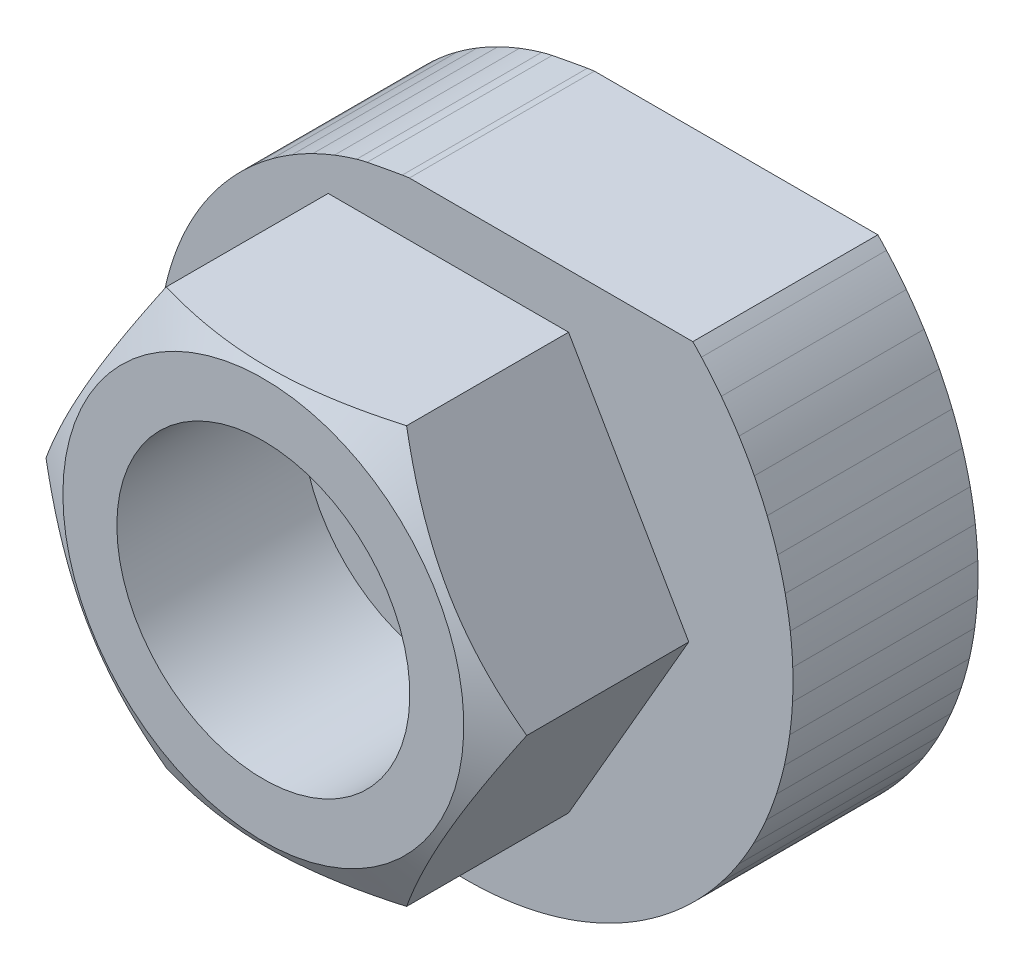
ISO-10303-21;
HEADER;
FILE_DESCRIPTION(('STEP AP214'),'2;1');
FILE_NAME('part.step','',(''),(''),'','','');
FILE_SCHEMA(('AUTOMOTIVE_DESIGN { 1 0 10303 214 1 1 1 1 }'));
ENDSEC;
DATA;
#1=APPLICATION_CONTEXT('core data for automotive mechanical design processes');
#2=APPLICATION_PROTOCOL_DEFINITION('international standard','automotive_design',2000,#1);
#3=PRODUCT_CONTEXT('',#1,'mechanical');
#4=PRODUCT('Part','Part','',(#3));
#5=PRODUCT_RELATED_PRODUCT_CATEGORY('part','',(#4));
#6=PRODUCT_DEFINITION_FORMATION('','',#4);
#7=PRODUCT_DEFINITION_CONTEXT('part definition',#1,'design');
#8=PRODUCT_DEFINITION('design','',#6,#7);
#9=PRODUCT_DEFINITION_SHAPE('','',#8);
#10=(LENGTH_UNIT() NAMED_UNIT(*) SI_UNIT(.MILLI.,.METRE.));
#11=(NAMED_UNIT(*) PLANE_ANGLE_UNIT() SI_UNIT($,.RADIAN.));
#12=(NAMED_UNIT(*) SI_UNIT($,.STERADIAN.) SOLID_ANGLE_UNIT());
#13=UNCERTAINTY_MEASURE_WITH_UNIT(LENGTH_MEASURE(1.E-05),#10,'distance_accuracy_value','');
#14=(GEOMETRIC_REPRESENTATION_CONTEXT(3) GLOBAL_UNCERTAINTY_ASSIGNED_CONTEXT((#13)) GLOBAL_UNIT_ASSIGNED_CONTEXT((#10,
#11,#12)) REPRESENTATION_CONTEXT('',''));
#15=CARTESIAN_POINT('',(0.,0.,0.));
#16=DIRECTION('',(0.,0.,1.));
#17=DIRECTION('',(1.,0.,0.));
#18=AXIS2_PLACEMENT_3D('',#15,#16,#17);
#19=CARTESIAN_POINT('',(-3.70225884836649,8.64601423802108,0.));
#20=DIRECTION('',(0.,0.,1.));
#21=DIRECTION('',(0.,-1.,0.));
#22=AXIS2_PLACEMENT_3D('',#19,#20,#21);
#23=PLANE('',#22);
#24=CARTESIAN_POINT('',(-3.70225884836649,8.64601423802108,0.));
#25=DIRECTION('',(0.,0.,1.));
#26=DIRECTION('',(0.,-1.,0.));
#27=AXIS2_PLACEMENT_3D('',#24,#25,#26);
#28=CIRCLE('',#27,8.02009848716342);
#29=CARTESIAN_POINT('',(-5.27048184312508,16.5112959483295,0.));
#30=VERTEX_POINT('',#29);
#31=CARTESIAN_POINT('',(-5.94907920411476,16.3449607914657,0.));
#32=VERTEX_POINT('',#31);
#33=EDGE_CURVE('E485',#30,#32,#28,.T.);
#34=ORIENTED_EDGE('',*,*,#33,.F.);
#35=CARTESIAN_POINT('',(12.0705259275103,-70.4609724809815,0.));
#36=DIRECTION('',(0.,0.,1.));
#37=DIRECTION('',(0.,-1.,0.));
#38=AXIS2_PLACEMENT_3D('',#35,#36,#37);
#39=CIRCLE('',#38,88.6841926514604);
#40=CARTESIAN_POINT('',(-2.98622284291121,16.9357113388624,0.));
#41=VERTEX_POINT('',#40);
#42=EDGE_CURVE('E612',#41,#30,#39,.T.);
#43=ORIENTED_EDGE('',*,*,#42,.F.);
#44=CARTESIAN_POINT('',(-1.72772138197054,9.6307575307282,0.));
#45=DIRECTION('',(0.,0.,1.));
#46=DIRECTION('',(0.,-1.,0.));
#47=AXIS2_PLACEMENT_3D('',#44,#45,#46);
#48=CIRCLE('',#47,7.41256878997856);
#49=CARTESIAN_POINT('',(-2.52815376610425,16.9999830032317,0.));
#50=VERTEX_POINT('',#49);
#51=EDGE_CURVE('E610',#50,#41,#48,.T.);
#52=ORIENTED_EDGE('',*,*,#51,.F.);
#53=DIRECTION('',(-1.,0.,0.));
#54=VECTOR('',#53,1.);
#55=CARTESIAN_POINT('',(15.8518076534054,16.9999830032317,0.));
#56=LINE('',#55,#54);
#57=CARTESIAN_POINT('',(15.8518076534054,16.9999830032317,0.));
#58=VERTEX_POINT('',#57);
#59=EDGE_CURVE('E608',#58,#50,#56,.T.);
#60=ORIENTED_EDGE('',*,*,#59,.F.);
#61=CARTESIAN_POINT('',(-0.898090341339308,0.697569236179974,0.));
#62=DIRECTION('',(0.,0.,1.));
#63=DIRECTION('',(0.,-1.,0.));
#64=AXIS2_PLACEMENT_3D('',#61,#62,#63);
#65=CIRCLE('',#64,23.3736556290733);
#66=CARTESIAN_POINT('',(16.4110130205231,16.4049788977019,0.));
#67=VERTEX_POINT('',#66);
#68=EDGE_CURVE('E606',#67,#58,#65,.T.);
#69=ORIENTED_EDGE('',*,*,#68,.F.);
#70=CARTESIAN_POINT('',(-0.608170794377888,0.960661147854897,0.));
#71=DIRECTION('',(0.,0.,1.));
#72=DIRECTION('',(0.,-1.,0.));
#73=AXIS2_PLACEMENT_3D('',#70,#71,#72);
#74=CIRCLE('',#73,22.9821576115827);
#75=CARTESIAN_POINT('',(17.7003235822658,14.8523349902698,0.));
#76=VERTEX_POINT('',#75);
#77=EDGE_CURVE('E604',#76,#67,#74,.T.);
#78=ORIENTED_EDGE('',*,*,#77,.F.);
#79=CARTESIAN_POINT('',(-0.762936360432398,0.843231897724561,0.));
#80=DIRECTION('',(0.,0.,1.));
#81=DIRECTION('',(0.,-1.,0.));
#82=AXIS2_PLACEMENT_3D('',#79,#80,#81);
#83=CIRCLE('',#82,23.1764306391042);
#84=CARTESIAN_POINT('',(18.8490356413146,13.1930291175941,0.));
#85=VERTEX_POINT('',#84);
#86=EDGE_CURVE('E602',#85,#76,#83,.T.);
#87=ORIENTED_EDGE('',*,*,#86,.F.);
#88=CARTESIAN_POINT('',(-0.431695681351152,1.05181649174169,0.));
#89=DIRECTION('',(0.,0.,1.));
#90=DIRECTION('',(0.,-1.,0.));
#91=AXIS2_PLACEMENT_3D('',#88,#89,#90);
#92=CIRCLE('',#91,22.7849872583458);
#93=CARTESIAN_POINT('',(19.8399140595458,11.4545797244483,0.));
#94=VERTEX_POINT('',#93);
#95=EDGE_CURVE('E600',#94,#85,#92,.T.);
#96=ORIENTED_EDGE('',*,*,#95,.F.);
#97=CARTESIAN_POINT('',(-0.60448610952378,0.963145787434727,0.));
#98=DIRECTION('',(0.,0.,1.));
#99=DIRECTION('',(0.,-1.,0.));
#100=AXIS2_PLACEMENT_3D('',#97,#98,#99);
#101=CIRCLE('',#100,22.9792011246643);
#102=CARTESIAN_POINT('',(20.6751026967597,9.63625276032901,0.));
#103=VERTEX_POINT('',#102);
#104=EDGE_CURVE('E598',#103,#94,#101,.T.);
#105=ORIENTED_EDGE('',*,*,#104,.F.);
#106=CARTESIAN_POINT('',(-0.242046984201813,1.1108682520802,0.));
#107=DIRECTION('',(0.,0.,1.));
#108=DIRECTION('',(0.,-1.,0.));
#109=AXIS2_PLACEMENT_3D('',#106,#107,#108);
#110=CIRCLE('',#109,22.5878137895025);
#111=CARTESIAN_POINT('',(21.3424749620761,7.76802561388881,0.));
#112=VERTEX_POINT('',#111);
#113=EDGE_CURVE('E596',#112,#103,#110,.T.);
#114=ORIENTED_EDGE('',*,*,#113,.F.);
#115=CARTESIAN_POINT('',(-0.427576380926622,1.05364676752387,0.));
#116=DIRECTION('',(0.,0.,1.));
#117=DIRECTION('',(0.,-1.,0.));
#118=AXIS2_PLACEMENT_3D('',#115,#116,#117);
#119=CIRCLE('',#118,22.7819669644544);
#120=CARTESIAN_POINT('',(21.8440568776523,5.84868282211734,0.));
#121=VERTEX_POINT('',#120);
#122=EDGE_CURVE('E594',#121,#112,#119,.T.);
#123=ORIENTED_EDGE('',*,*,#122,.F.);
#124=CARTESIAN_POINT('',(-0.0450126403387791,1.13601194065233,0.));
#125=DIRECTION('',(0.,0.,1.));
#126=DIRECTION('',(0.,-1.,0.));
#127=AXIS2_PLACEMENT_3D('',#124,#125,#126);
#128=CIRCLE('',#127,22.3906371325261);
#129=CARTESIAN_POINT('',(22.1731587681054,3.90972614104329,0.));
#130=VERTEX_POINT('',#129);
#131=EDGE_CURVE('E592',#130,#121,#128,.T.);
#132=ORIENTED_EDGE('',*,*,#131,.F.);
#133=CARTESIAN_POINT('',(-0.237608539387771,1.11196828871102,0.));
#134=DIRECTION('',(0.,0.,1.));
#135=DIRECTION('',(0.,-1.,0.));
#136=AXIS2_PLACEMENT_3D('',#133,#134,#135);
#137=CIRCLE('',#136,22.5847280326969);
#138=CARTESIAN_POINT('',(22.3315853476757,1.94948103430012,0.));
#139=VERTEX_POINT('',#138);
#140=EDGE_CURVE('E590',#139,#130,#137,.T.);
#141=ORIENTED_EDGE('',*,*,#140,.F.);
#142=CARTESIAN_POINT('',(0.153393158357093,1.12647784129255,0.));
#143=DIRECTION('',(0.,0.,1.));
#144=DIRECTION('',(0.,-1.,0.));
#145=AXIS2_PLACEMENT_3D('',#142,#143,#144);
#146=CIRCLE('',#145,22.1934572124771);
#147=CARTESIAN_POINT('',(22.3182435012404,3.23172022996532E-09,0.));
#148=VERTEX_POINT('',#147);
#149=EDGE_CURVE('E588',#148,#139,#146,.T.);
#150=ORIENTED_EDGE('',*,*,#149,.F.);
#151=CARTESIAN_POINT('',(-0.0403837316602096,1.1363261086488,0.));
#152=DIRECTION('',(0.,0.,1.));
#153=DIRECTION('',(0.,-1.,0.));
#154=AXIS2_PLACEMENT_3D('',#151,#152,#153);
#155=CIRCLE('',#154,22.387484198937);
#156=CARTESIAN_POINT('',(22.1346180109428,-1.94080672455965,0.));
#157=VERTEX_POINT('',#156);
#158=EDGE_CURVE('E586',#157,#148,#155,.T.);
#159=ORIENTED_EDGE('',*,*,#158,.F.);
#160=CARTESIAN_POINT('',(0.34711348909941,1.08255472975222,0.));
#161=DIRECTION('',(0.,0.,1.));
#162=DIRECTION('',(0.,-1.,0.));
#163=AXIS2_PLACEMENT_3D('',#160,#161,#162);
#164=CIRCLE('',#163,21.9962739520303);
#165=CARTESIAN_POINT('',(21.785199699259,-3.84131848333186,0.));
#166=VERTEX_POINT('',#165);
#167=EDGE_CURVE('E584',#166,#157,#164,.T.);
#168=ORIENTED_EDGE('',*,*,#167,.F.);
#169=CARTESIAN_POINT('',(0.158074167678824,1.12597304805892,0.));
#170=DIRECTION('',(0.,0.,1.));
#171=DIRECTION('',(0.,-1.,0.));
#172=AXIS2_PLACEMENT_3D('',#169,#170,#171);
#173=CIRCLE('',#172,22.1902353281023);
#174=CARTESIAN_POINT('',(21.2710639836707,-5.70397606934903,0.));
#175=VERTEX_POINT('',#174);
#176=EDGE_CURVE('E582',#175,#166,#173,.T.);
#177=ORIENTED_EDGE('',*,*,#176,.F.);
#178=CARTESIAN_POINT('',(0.530233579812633,1.00558129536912,0.));
#179=DIRECTION('',(0.,0.,1.));
#180=DIRECTION('',(0.,-1.,0.));
#181=AXIS2_PLACEMENT_3D('',#178,#179,#180);
#182=CIRCLE('',#181,21.7990872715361);
#183=CARTESIAN_POINT('',(20.6021024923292,-7.4985520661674,0.));
#184=VERTEX_POINT('',#183);
#185=EDGE_CURVE('E580',#184,#175,#182,.T.);
#186=ORIENTED_EDGE('',*,*,#185,.F.);
#187=CARTESIAN_POINT('',(0.351702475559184,1.08122210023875,0.));
#188=DIRECTION('',(0.,0.,1.));
#189=DIRECTION('',(0.,-1.,0.));
#190=AXIS2_PLACEMENT_3D('',#187,#188,#189);
#191=CIRCLE('',#190,21.992981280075);
#192=CARTESIAN_POINT('',(19.7789051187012,-9.22775568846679,0.));
#193=VERTEX_POINT('',#192);
#194=EDGE_CURVE('E578',#193,#184,#191,.T.);
#195=ORIENTED_EDGE('',*,*,#194,.F.);
#196=CARTESIAN_POINT('',(0.6971614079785,0.897905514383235,0.));
#197=DIRECTION('',(0.,0.,1.));
#198=DIRECTION('',(0.,-1.,0.));
#199=AXIS2_PLACEMENT_3D('',#196,#197,#198);
#200=CIRCLE('',#199,21.6018970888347);
#201=CARTESIAN_POINT('',(18.8164176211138,-10.8636637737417,0.));
#202=VERTEX_POINT('',#201);
#203=EDGE_CURVE('E576',#202,#193,#200,.T.);
#204=ORIENTED_EDGE('',*,*,#203,.F.);
#205=CARTESIAN_POINT('',(0.534584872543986,1.0034371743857,0.));
#206=DIRECTION('',(0.,0.,1.));
#207=DIRECTION('',(0.,-1.,0.));
#208=AXIS2_PLACEMENT_3D('',#205,#206,#207);
#209=CIRCLE('',#208,21.7957219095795);
#210=CARTESIAN_POINT('',(17.7146851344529,-12.4091557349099,0.));
#211=VERTEX_POINT('',#210);
#212=EDGE_CURVE('E574',#211,#202,#209,.T.);
#213=ORIENTED_EDGE('',*,*,#212,.F.);
#214=CARTESIAN_POINT('',(0.842798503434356,0.762813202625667,0.));
#215=DIRECTION('',(0.,0.,1.));
#216=DIRECTION('',(0.,-1.,0.));
#217=AXIS2_PLACEMENT_3D('',#214,#215,#216);
#218=CIRCLE('',#217,21.4047033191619);
#219=CARTESIAN_POINT('',(16.4932092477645,-13.8394457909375,0.));
#220=VERTEX_POINT('',#219);
#221=EDGE_CURVE('E572',#220,#211,#218,.T.);
#222=ORIENTED_EDGE('',*,*,#221,.F.);
#223=CARTESIAN_POINT('',(0.70113217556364,0.894991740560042,0.));
#224=DIRECTION('',(0.,0.,1.));
#225=DIRECTION('',(0.,-1.,0.));
#226=AXIS2_PLACEMENT_3D('',#223,#224,#225);
#227=CIRCLE('',#226,21.5984570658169);
#228=CARTESIAN_POINT('',(15.1514510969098,-15.1574732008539,0.));
#229=VERTEX_POINT('',#228);
#230=EDGE_CURVE('E570',#229,#220,#227,.T.);
#231=ORIENTED_EDGE('',*,*,#230,.F.);
#232=CARTESIAN_POINT('',(0.962695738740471,0.604427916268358,0.));
#233=DIRECTION('',(0.,0.,1.));
#234=DIRECTION('',(0.,-1.,0.));
#235=AXIS2_PLACEMENT_3D('',#232,#233,#234);
#236=CIRCLE('',#235,21.2075058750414);
#237=CARTESIAN_POINT('',(13.7128346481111,-16.3423199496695,0.));
#238=VERTEX_POINT('',#237);
#239=EDGE_CURVE('E568',#238,#229,#236,.T.);
#240=ORIENTED_EDGE('',*,*,#239,.F.);
#241=CARTESIAN_POINT('',(0.846253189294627,0.759196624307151,0.));
#242=DIRECTION('',(0.,0.,1.));
#243=DIRECTION('',(0.,-1.,0.));
#244=AXIS2_PLACEMENT_3D('',#241,#242,#243);
#245=CIRCLE('',#244,21.4011865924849);
#246=CARTESIAN_POINT('',(12.176220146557,-17.3968667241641,0.));
#247=VERTEX_POINT('',#246);
#248=EDGE_CURVE('E566',#247,#238,#245,.T.);
#249=ORIENTED_EDGE('',*,*,#248,.F.);
#250=CARTESIAN_POINT('',(1.05318934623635,0.427585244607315,0.));
#251=DIRECTION('',(0.,0.,1.));
#252=DIRECTION('',(0.,-1.,0.));
#253=AXIS2_PLACEMENT_3D('',#250,#251,#252);
#254=CIRCLE('',#253,21.0103046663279);
#255=CARTESIAN_POINT('',(10.5682058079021,-18.3046693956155,0.));
#256=VERTEX_POINT('',#255);
#257=EDGE_CURVE('E564',#256,#247,#254,.T.);
#258=ORIENTED_EDGE('',*,*,#257,.F.);
#259=CARTESIAN_POINT('',(0.965510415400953,0.600199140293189,0.));
#260=DIRECTION('',(0.,0.,1.));
#261=DIRECTION('',(0.,-1.,0.));
#262=AXIS2_PLACEMENT_3D('',#259,#260,#261);
#263=CIRCLE('',#262,21.2039103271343);
#264=CARTESIAN_POINT('',(8.88705797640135,-19.0684280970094,0.));
#265=VERTEX_POINT('',#264);
#266=EDGE_CURVE('E562',#265,#256,#263,.T.);
#267=ORIENTED_EDGE('',*,*,#266,.F.);
#268=CARTESIAN_POINT('',(1.11151300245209,0.23768532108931,0.));
#269=DIRECTION('',(0.,0.,1.));
#270=DIRECTION('',(0.,-1.,0.));
#271=AXIS2_PLACEMENT_3D('',#268,#269,#270);
#272=CIRCLE('',#271,20.813099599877);
#273=CARTESIAN_POINT('',(7.16171014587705,-19.6766368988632,0.));
#274=VERTEX_POINT('',#273);
#275=EDGE_CURVE('E560',#274,#265,#272,.T.);
#276=ORIENTED_EDGE('',*,*,#275,.F.);
#277=CARTESIAN_POINT('',(1.05525585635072,0.422856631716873,0.));
#278=DIRECTION('',(0.,0.,1.));
#279=DIRECTION('',(0.,-1.,0.));
#280=AXIS2_PLACEMENT_3D('',#277,#278,#279);
#281=CIRCLE('',#280,21.0066281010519);
#282=CARTESIAN_POINT('',(5.38986626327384,-20.1316946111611,0.));
#283=VERTEX_POINT('',#282);
#284=EDGE_CURVE('E558',#283,#274,#281,.T.);
#285=ORIENTED_EDGE('',*,*,#284,.F.);
#286=CARTESIAN_POINT('',(1.13588254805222,0.0405280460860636,0.));
#287=DIRECTION('',(0.,0.,1.));
#288=DIRECTION('',(0.,-1.,0.));
#289=AXIS2_PLACEMENT_3D('',#286,#287,#288);
#290=CIRCLE('',#289,20.6158905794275);
#291=CARTESIAN_POINT('',(3.60189171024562,-20.4273429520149,0.));
#292=VERTEX_POINT('',#291);
#293=EDGE_CURVE('E556',#292,#283,#290,.T.);
#294=ORIENTED_EDGE('',*,*,#293,.F.);
#295=CARTESIAN_POINT('',(1.112742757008,0.23258826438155,0.));
#296=DIRECTION('',(0.,0.,1.));
#297=DIRECTION('',(0.,-1.,0.));
#298=AXIS2_PLACEMENT_3D('',#295,#296,#297);
#299=CIRCLE('',#298,20.8093397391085);
#300=CARTESIAN_POINT('',(1.79498374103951,-20.5655647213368,0.));
#301=VERTEX_POINT('',#300);
#302=EDGE_CURVE('E554',#301,#292,#299,.T.);
#303=ORIENTED_EDGE('',*,*,#302,.F.);
#304=CARTESIAN_POINT('',(1.1255507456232,-0.157863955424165,0.));
#305=DIRECTION('',(0.,0.,1.));
#306=DIRECTION('',(0.,-1.,0.));
#307=AXIS2_PLACEMENT_3D('',#304,#305,#306);
#308=CIRCLE('',#307,20.4186775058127);
#309=CARTESIAN_POINT('',(3.05043555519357E-09,-20.5454956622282,0.));
#310=VERTEX_POINT('',#309);
#311=EDGE_CURVE('E552',#310,#301,#308,.T.);
#312=ORIENTED_EDGE('',*,*,#311,.F.);
#313=CARTESIAN_POINT('',(1.13620985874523,0.0352095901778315,0.));
#314=DIRECTION('',(0.,0.,1.));
#315=DIRECTION('',(0.,-1.,0.));
#316=AXIS2_PLACEMENT_3D('',#313,#314,#315);
#317=CIRCLE('',#316,20.6120450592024);
#318=CARTESIAN_POINT('',(-1.7862903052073,-20.3685987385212,0.));
#319=VERTEX_POINT('',#318);
#320=EDGE_CURVE('E550',#319,#310,#317,.T.);
#321=ORIENTED_EDGE('',*,*,#320,.F.);
#322=CARTESIAN_POINT('',(1.08083039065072,-0.351429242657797,0.));
#323=DIRECTION('',(0.,0.,1.));
#324=DIRECTION('',(0.,-1.,0.));
#325=AXIS2_PLACEMENT_3D('',#322,#323,#324);
#326=CIRCLE('',#325,20.2214602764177);
#327=CARTESIAN_POINT('',(-3.53348405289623,-20.0393838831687,0.));
#328=VERTEX_POINT('',#327);
#329=EDGE_CURVE('E548',#328,#319,#326,.T.);
#330=ORIENTED_EDGE('',*,*,#329,.F.);
#331=CARTESIAN_POINT('',(1.12493557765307,-0.163245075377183,0.));
#332=DIRECTION('',(0.,0.,1.));
#333=DIRECTION('',(0.,-1.,0.));
#334=AXIS2_PLACEMENT_3D('',#331,#332,#333);
#335=CIRCLE('',#334,20.4147438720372);
#336=CARTESIAN_POINT('',(-5.24514072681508,-19.5587057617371,0.));
#337=VERTEX_POINT('',#336);
#338=EDGE_CURVE('E546',#337,#328,#335,.T.);
#339=ORIENTED_EDGE('',*,*,#338,.F.);
#340=CARTESIAN_POINT('',(1.0030850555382,-0.534252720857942,0.));
#341=DIRECTION('',(0.,0.,1.));
#342=DIRECTION('',(0.,-1.,0.));
#343=AXIS2_PLACEMENT_3D('',#340,#341,#342);
#344=CIRCLE('',#343,20.0242387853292);
#345=CARTESIAN_POINT('',(-6.89223659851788,-18.9362644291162,0.));
#346=VERTEX_POINT('',#345);
#347=EDGE_CURVE('E544',#346,#337,#344,.T.);
#348=ORIENTED_EDGE('',*,*,#347,.F.);
#349=CARTESIAN_POINT('',(1.0792604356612,-0.356707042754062,0.));
#350=DIRECTION('',(0.,0.,1.));
#351=DIRECTION('',(0.,-1.,0.));
#352=AXIS2_PLACEMENT_3D('',#349,#350,#351);
#353=CIRCLE('',#352,20.2174359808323);
#354=CARTESIAN_POINT('',(-8.47854280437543,-18.1722372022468,0.));
#355=VERTEX_POINT('',#354);
#356=EDGE_CURVE('E542',#355,#346,#353,.T.);
#357=ORIENTED_EDGE('',*,*,#356,.F.);
#358=CARTESIAN_POINT('',(0.89468773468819,-0.700746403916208,0.));
#359=DIRECTION('',(0.,0.,1.));
#360=DIRECTION('',(0.,-1.,0.));
#361=AXIS2_PLACEMENT_3D('',#358,#359,#360);
#362=CIRCLE('',#361,19.8270129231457);
#363=CARTESIAN_POINT('',(-9.97728985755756,-17.2811729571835,0.));
#364=VERTEX_POINT('',#363);
#365=EDGE_CURVE('E540',#364,#355,#362,.T.);
#366=ORIENTED_EDGE('',*,*,#365,.F.);
#367=CARTESIAN_POINT('',(1.00057704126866,-0.539258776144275,0.));
#368=DIRECTION('',(0.,0.,1.));
#369=DIRECTION('',(0.,-1.,0.));
#370=AXIS2_PLACEMENT_3D('',#367,#368,#369);
#371=CIRCLE('',#370,20.0201211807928);
#372=CARTESIAN_POINT('',(-11.3923296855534,-16.2625254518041,0.));
#373=VERTEX_POINT('',#372);
#374=EDGE_CURVE('E538',#373,#364,#371,.T.);
#375=ORIENTED_EDGE('',*,*,#374,.F.);
#376=CARTESIAN_POINT('',(0.758948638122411,-0.845820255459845,0.));
#377=DIRECTION('',(0.,0.,1.));
#378=DIRECTION('',(0.,-1.,0.));
#379=AXIS2_PLACEMENT_3D('',#376,#377,#378);
#380=CIRCLE('',#379,19.6297825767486);
#381=CARTESIAN_POINT('',(-12.6999454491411,-15.1352056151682,0.));
#382=VERTEX_POINT('',#381);
#383=EDGE_CURVE('E536',#382,#373,#380,.T.);
#384=ORIENTED_EDGE('',*,*,#383,.F.);
#385=CARTESIAN_POINT('',(0.891287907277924,-0.705314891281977,0.));
#386=DIRECTION('',(0.,0.,1.));
#387=DIRECTION('',(0.,-1.,0.));
#388=AXIS2_PLACEMENT_3D('',#385,#386,#387);
#389=CIRCLE('',#388,19.8227992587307);
#390=CARTESIAN_POINT('',(-13.9039296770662,-13.8979229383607,0.));
#391=VERTEX_POINT('',#390);
#392=EDGE_CURVE('E534',#391,#382,#389,.T.);
#393=ORIENTED_EDGE('',*,*,#392,.F.);
#394=CARTESIAN_POINT('',(0.600014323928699,-0.965037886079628,0.));
#395=DIRECTION('',(0.,0.,1.));
#396=DIRECTION('',(0.,-1.,0.));
#397=AXIS2_PLACEMENT_3D('',#394,#395,#396);
#398=CIRCLE('',#397,19.4325476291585);
#399=CARTESIAN_POINT('',(-14.9843163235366,-12.5733342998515,0.));
#400=VERTEX_POINT('',#399);
#401=EDGE_CURVE('E532',#400,#391,#398,.T.);
#402=ORIENTED_EDGE('',*,*,#401,.F.);
#403=CARTESIAN_POINT('',(0.754732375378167,-0.849793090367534,0.));
#404=DIRECTION('',(0.,0.,1.));
#405=DIRECTION('',(0.,-1.,0.));
#406=AXIS2_PLACEMENT_3D('',#403,#404,#405);
#407=CIRCLE('',#406,19.6254699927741);
#408=CARTESIAN_POINT('',(-15.9446939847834,-11.1594114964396,0.));
#409=VERTEX_POINT('',#408);
#410=EDGE_CURVE('E530',#409,#400,#407,.T.);
#411=ORIENTED_EDGE('',*,*,#410,.F.);
#412=CARTESIAN_POINT('',(0.422741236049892,-1.05475234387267,0.));
#413=DIRECTION('',(0.,0.,1.));
#414=DIRECTION('',(0.,-1.,0.));
#415=AXIS2_PLACEMENT_3D('',#412,#413,#414);
#416=CIRCLE('',#415,19.235307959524);
#417=CARTESIAN_POINT('',(-16.7694247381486,-9.681831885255,0.));
#418=VERTEX_POINT('',#417);
#419=EDGE_CURVE('E528',#418,#409,#416,.T.);
#420=ORIENTED_EDGE('',*,*,#419,.F.);
#421=CARTESIAN_POINT('',(0.595084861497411,-0.968269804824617,0.));
#422=DIRECTION('',(0.,0.,1.));
#423=DIRECTION('',(0.,-1.,0.));
#424=AXIS2_PLACEMENT_3D('',#421,#422,#423);
#425=CIRCLE('',#424,19.4281331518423);
#426=CARTESIAN_POINT('',(-17.4617496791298,-8.13786422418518,0.));
#427=VERTEX_POINT('',#426);
#428=EDGE_CURVE('E526',#427,#418,#425,.T.);
#429=ORIENTED_EDGE('',*,*,#428,.F.);
#430=CARTESIAN_POINT('',(0.232547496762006,-1.11221784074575,0.));
#431=DIRECTION('',(0.,0.,1.));
#432=DIRECTION('',(0.,-1.,0.));
#433=AXIS2_PLACEMENT_3D('',#430,#431,#432);
#434=CIRCLE('',#433,19.0380634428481);
#435=CARTESIAN_POINT('',(-18.0107988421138,-6.55539467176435,0.));
#436=VERTEX_POINT('',#435);
#437=EDGE_CURVE('E524',#436,#427,#434,.T.);
#438=ORIENTED_EDGE('',*,*,#437,.F.);
#439=CARTESIAN_POINT('',(0.417227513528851,-1.05711577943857,0.));
#440=DIRECTION('',(0.,0.,1.));
#441=DIRECTION('',(0.,-1.,0.));
#442=AXIS2_PLACEMENT_3D('',#439,#440,#441);
#443=CIRCLE('',#442,19.2307884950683);
#444=CARTESIAN_POINT('',(-18.4193286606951,-4.93105145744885,0.));
#445=VERTEX_POINT('',#444);
#446=EDGE_CURVE('E522',#445,#436,#443,.T.);
#447=ORIENTED_EDGE('',*,*,#446,.F.);
#448=CARTESIAN_POINT('',(0.0352474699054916,-1.13567398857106,0.));
#449=DIRECTION('',(0.,0.,1.));
#450=DIRECTION('',(0.,-1.,0.));
#451=AXIS2_PLACEMENT_3D('',#448,#449,#450);
#452=CIRCLE('',#451,18.8408139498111);
#453=CARTESIAN_POINT('',(-18.6815271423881,-3.29405727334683,0.));
#454=VERTEX_POINT('',#453);
#455=EDGE_CURVE('E520',#454,#445,#452,.T.);
#456=ORIENTED_EDGE('',*,*,#455,.F.);
#457=CARTESIAN_POINT('',(0.226601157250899,-1.1136074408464,0.));
#458=DIRECTION('',(0.,0.,1.));
#459=DIRECTION('',(0.,-1.,0.));
#460=AXIS2_PLACEMENT_3D('',#457,#458,#459);
#461=CIRCLE('',#460,19.0334357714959);
#462=CARTESIAN_POINT('',(-18.7995406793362,-1.64048890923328,0.));
#463=VERTEX_POINT('',#462);
#464=EDGE_CURVE('E518',#463,#454,#461,.T.);
#465=ORIENTED_EDGE('',*,*,#464,.F.);
#466=CARTESIAN_POINT('',(-0.163125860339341,-1.12439995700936,0.));
#467=DIRECTION('',(0.,0.,1.));
#468=DIRECTION('',(0.,-1.,0.));
#469=AXIS2_PLACEMENT_3D('',#466,#467,#468);
#470=CIRCLE('',#469,18.6435593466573);
#471=CARTESIAN_POINT('',(-18.7727478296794,3.23172933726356E-09,0.));
#472=VERTEX_POINT('',#471);
#473=EDGE_CURVE('E516',#472,#463,#470,.T.);
#474=ORIENTED_EDGE('',*,*,#473,.F.);
#475=CARTESIAN_POINT('',(0.0290390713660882,-1.1360106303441,0.));
#476=DIRECTION('',(0.,0.,1.));
#477=DIRECTION('',(0.,-1.,0.));
#478=AXIS2_PLACEMENT_3D('',#475,#476,#477);
#479=CIRCLE('',#478,18.8360747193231);
#480=CARTESIAN_POINT('',(-18.6025764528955,1.63177075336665,0.));
#481=VERTEX_POINT('',#480);
#482=EDGE_CURVE('E514',#481,#472,#479,.T.);
#483=ORIENTED_EDGE('',*,*,#482,.F.);
#484=CARTESIAN_POINT('',(-0.356505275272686,-1.07873688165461,0.));
#485=DIRECTION('',(0.,0.,1.));
#486=DIRECTION('',(0.,-1.,0.));
#487=AXIS2_PLACEMENT_3D('',#484,#485,#486);
#488=CIRCLE('',#487,18.446299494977);
#489=CARTESIAN_POINT('',(-18.2935680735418,3.22564962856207,0.));
#490=VERTEX_POINT('',#489);
#491=EDGE_CURVE('E512',#490,#481,#488,.T.);
#492=ORIENTED_EDGE('',*,*,#491,.F.);
#493=CARTESIAN_POINT('',(-0.16941133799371,-1.12363412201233,0.));
#494=DIRECTION('',(0.,0.,1.));
#495=DIRECTION('',(0.,-1.,0.));
#496=AXIS2_PLACEMENT_3D('',#493,#494,#495);
#497=CIRCLE('',#496,18.638705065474);
#498=CARTESIAN_POINT('',(-17.8463450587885,4.78630164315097,0.));
#499=VERTEX_POINT('',#498);
#500=EDGE_CURVE('E510',#499,#490,#497,.T.);
#501=ORIENTED_EDGE('',*,*,#500,.F.);
#502=CARTESIAN_POINT('',(-0.538974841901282,-1.00007781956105,0.));
#503=DIRECTION('',(0.,0.,1.));
#504=DIRECTION('',(0.,-1.,0.));
#505=AXIS2_PLACEMENT_3D('',#502,#503,#504);
#506=CIRCLE('',#505,18.249034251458);
#507=CARTESIAN_POINT('',(-17.2704263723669,6.28592113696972,0.));
#508=VERTEX_POINT('',#507);
#509=EDGE_CURVE('E508',#508,#499,#506,.T.);
#510=ORIENTED_EDGE('',*,*,#509,.F.);
#511=CARTESIAN_POINT('',(-0.362673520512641,-1.07685126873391,0.));
#512=DIRECTION('',(0.,0.,1.));
#513=DIRECTION('',(0.,-1.,0.));
#514=AXIS2_PLACEMENT_3D('',#511,#512,#513);
#515=CIRCLE('',#514,18.441326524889);
#516=CARTESIAN_POINT('',(-16.5655674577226,7.72932565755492,0.));
#517=VERTEX_POINT('',#516);
#518=EDGE_CURVE('E506',#517,#508,#515,.T.);
#519=ORIENTED_EDGE('',*,*,#518,.F.);
#520=CARTESIAN_POINT('',(-0.704950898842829,-0.890825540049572,0.));
#521=DIRECTION('',(0.,0.,1.));
#522=DIRECTION('',(0.,-1.,0.));
#523=AXIS2_PLACEMENT_3D('',#520,#521,#522);
#524=CIRCLE('',#523,18.0517634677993);
#525=CARTESIAN_POINT('',(-15.7459282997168,9.09091594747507,0.));
#526=VERTEX_POINT('',#525);
#527=EDGE_CURVE('E504',#526,#517,#524,.T.);
#528=ORIENTED_EDGE('',*,*,#527,.F.);
#529=CARTESIAN_POINT('',(-0.544827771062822,-0.997089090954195,0.));
#530=DIRECTION('',(0.,0.,1.));
#531=DIRECTION('',(0.,-1.,0.));
#532=AXIS2_PLACEMENT_3D('',#529,#530,#531);
#533=CIRCLE('',#532,18.2439387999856);
#534=CARTESIAN_POINT('',(-14.810364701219,10.3754989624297,0.));
#535=VERTEX_POINT('',#534);
#536=EDGE_CURVE('E502',#535,#526,#533,.T.);
#537=ORIENTED_EDGE('',*,*,#536,.F.);
#538=CARTESIAN_POINT('',(-0.849352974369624,-0.754319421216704,0.));
#539=DIRECTION('',(0.,0.,1.));
#540=DIRECTION('',(0.,-1.,0.));
#541=AXIS2_PLACEMENT_3D('',#538,#539,#540);
#542=CIRCLE('',#541,17.8544869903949);
#543=CARTESIAN_POINT('',(-13.7772019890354,11.5604451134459,0.));
#544=VERTEX_POINT('',#543);
#545=EDGE_CURVE('E500',#544,#535,#542,.T.);
#546=ORIENTED_EDGE('',*,*,#545,.F.);
#547=CARTESIAN_POINT('',(-0.710292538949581,-0.886785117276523,0.));
#548=DIRECTION('',(0.,0.,1.));
#549=DIRECTION('',(0.,-1.,0.));
#550=AXIS2_PLACEMENT_3D('',#547,#548,#549);
#551=CIRCLE('',#550,18.0465415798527);
#552=CARTESIAN_POINT('',(-12.6443945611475,12.6503812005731,0.));
#553=VERTEX_POINT('',#552);
#554=EDGE_CURVE('E498',#553,#544,#551,.T.);
#555=ORIENTED_EDGE('',*,*,#554,.F.);
#556=CARTESIAN_POINT('',(-0.967759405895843,-0.594733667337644,0.));
#557=DIRECTION('',(0.,0.,1.));
#558=DIRECTION('',(0.,-1.,0.));
#559=AXIS2_PLACEMENT_3D('',#556,#557,#558);
#560=CIRCLE('',#559,17.6572046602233);
#561=CARTESIAN_POINT('',(-11.433833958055,13.626312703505,0.));
#562=VERTEX_POINT('',#561);
#563=EDGE_CURVE('E496',#562,#553,#560,.T.);
#564=ORIENTED_EDGE('',*,*,#563,.F.);
#565=CARTESIAN_POINT('',(-0.853995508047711,-0.74931327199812,0.));
#566=DIRECTION('',(0.,0.,1.));
#567=DIRECTION('',(0.,-1.,0.));
#568=AXIS2_PLACEMENT_3D('',#565,#566,#567);
#569=CIRCLE('',#568,17.8491345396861);
#570=CARTESIAN_POINT('',(-10.1426035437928,14.492516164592,0.));
#571=VERTEX_POINT('',#570);
#572=EDGE_CURVE('E494',#571,#562,#569,.T.);
#573=ORIENTED_EDGE('',*,*,#572,.F.);
#574=CARTESIAN_POINT('',(-1.0565428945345,-0.416949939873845,0.));
#575=DIRECTION('',(0.,0.,1.));
#576=DIRECTION('',(0.,-1.,0.));
#577=AXIS2_PLACEMENT_3D('',#574,#575,#576);
#578=CIRCLE('',#577,17.4599163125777);
#579=CARTESIAN_POINT('',(-8.79545796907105,15.2341800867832,0.));
#580=VERTEX_POINT('',#579);
#581=EDGE_CURVE('E492',#580,#571,#578,.T.);
#582=ORIENTED_EDGE('',*,*,#581,.F.);
#583=CARTESIAN_POINT('',(-0.971540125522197,-0.588858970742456,0.));
#584=DIRECTION('',(0.,0.,1.));
#585=DIRECTION('',(0.,-1.,0.));
#586=AXIS2_PLACEMENT_3D('',#583,#584,#585);
#587=CIRCLE('',#586,17.6516927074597);
#588=CARTESIAN_POINT('',(-7.38867408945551,15.8550653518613,0.));
#589=VERTEX_POINT('',#588);
#590=EDGE_CURVE('E490',#589,#580,#587,.T.);
#591=ORIENTED_EDGE('',*,*,#590,.F.);
#592=CARTESIAN_POINT('',(-1.11295739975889,-0.226476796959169,0.));
#593=DIRECTION('',(0.,0.,1.));
#594=DIRECTION('',(0.,-1.,0.));
#595=AXIS2_PLACEMENT_3D('',#592,#593,#594);
#596=CIRCLE('',#595,17.2626943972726);
#597=EDGE_CURVE('E488',#32,#589,#596,.T.);
#598=ORIENTED_EDGE('',*,*,#597,.F.);
#599=EDGE_LOOP('',(#34,#43,#52,#60,#69,#78,#87,#96,#105,#114,#123,#132,#141,#150,#159,#168,#177,
#186,#195,#204,#213,#222,#231,#240,#249,#258,#267,#276,#285,#294,#303,#312,#321,#330,#339,#348,
#357,#366,#375,#384,#393,#402,#411,#420,#429,#438,#447,#456,#465,#474,#483,#492,#501,#510,#519,
#528,#537,#546,#555,#564,#573,#582,#591,#598));
#600=FACE_BOUND('',#599,.T.);
#601=CARTESIAN_POINT('',(0.,0.,0.));
#602=DIRECTION('',(0.,0.,1.));
#603=DIRECTION('',(0.,-1.,0.));
#604=AXIS2_PLACEMENT_3D('',#601,#602,#603);
#605=CIRCLE('',#604,6.);
#606=CARTESIAN_POINT('',(0.,-6.,0.));
#607=VERTEX_POINT('',#606);
#608=EDGE_CURVE('E18',#607,#607,#605,.F.);
#609=ORIENTED_EDGE('',*,*,#608,.F.);
#610=EDGE_LOOP('',(#609));
#611=FACE_BOUND('',#610,.T.);
#612=ADVANCED_FACE('F14',(#600,#611),#23,.F.);
#613=CARTESIAN_POINT('',(7.79422863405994,-13.5,24.));
#614=DIRECTION('',(0.,0.,-1.));
#615=DIRECTION('',(0.,1.,0.));
#616=AXIS2_PLACEMENT_3D('',#613,#614,#615);
#617=PLANE('',#616);
#618=CARTESIAN_POINT('',(0.,0.,24.));
#619=DIRECTION('',(0.,0.,1.));
#620=DIRECTION('',(-1.,0.,0.));
#621=AXIS2_PLACEMENT_3D('',#618,#619,#620);
#622=CIRCLE('',#621,13.);
#623=CARTESIAN_POINT('',(-13.,0.,24.));
#624=VERTEX_POINT('',#623);
#625=EDGE_CURVE('E457',#624,#624,#622,.T.);
#626=ORIENTED_EDGE('',*,*,#625,.T.);
#627=EDGE_LOOP('',(#626));
#628=FACE_BOUND('',#627,.T.);
#629=CARTESIAN_POINT('',(0.,0.,24.));
#630=DIRECTION('',(0.,0.,-1.));
#631=DIRECTION('',(0.,1.,0.));
#632=AXIS2_PLACEMENT_3D('',#629,#630,#631);
#633=CIRCLE('',#632,9.5);
#634=CARTESIAN_POINT('',(0.,9.5,24.));
#635=VERTEX_POINT('',#634);
#636=EDGE_CURVE('E930',#635,#635,#633,.F.);
#637=ORIENTED_EDGE('',*,*,#636,.F.);
#638=EDGE_LOOP('',(#637));
#639=FACE_BOUND('',#638,.T.);
#640=ADVANCED_FACE('F967',(#628,#639),#617,.F.);
#641=CARTESIAN_POINT('',(7.79422863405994,-13.5,24.));
#642=DIRECTION('',(-0.866025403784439,0.5,0.));
#643=DIRECTION('',(-0.5,-0.866025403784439,0.));
#644=AXIS2_PLACEMENT_3D('',#641,#642,#643);
#645=PLANE('',#644);
#646=CARTESIAN_POINT('',(7.7941131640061,-13.5002,22.5054868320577));
#647=CARTESIAN_POINT('',(7.96542734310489,-13.2034751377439,22.6043888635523));
#648=CARTESIAN_POINT('',(8.13740973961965,-12.9055928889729,22.6988029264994));
#649=CARTESIAN_POINT('',(8.48275363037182,-12.3074397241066,22.8774076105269));
#650=CARTESIAN_POINT('',(8.65611555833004,-12.0071680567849,22.9615948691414));
#651=CARTESIAN_POINT('',(9.00455355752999,-11.403655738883,23.1186142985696));
#652=CARTESIAN_POINT('',(9.17963267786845,-11.1004098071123,23.1914196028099));
#653=CARTESIAN_POINT('',(9.53100751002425,-10.4918107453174,23.3241117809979));
#654=CARTESIAN_POINT('',(9.70730315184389,-10.1864577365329,23.3839993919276));
#655=CARTESIAN_POINT('',(10.0565936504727,-9.58146884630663,23.4883089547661));
#656=CARTESIAN_POINT('',(10.2295625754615,-9.28187788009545,23.5330761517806));
#657=CARTESIAN_POINT('',(10.5762930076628,-8.6813231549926,23.6081409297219));
#658=CARTESIAN_POINT('',(10.7500545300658,-8.38035936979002,23.6384382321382));
#659=CARTESIAN_POINT('',(11.0978694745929,-7.77792621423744,23.6837982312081));
#660=CARTESIAN_POINT('',(11.2719223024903,-7.4764578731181,23.6988790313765));
#661=CARTESIAN_POINT('',(11.6201886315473,-6.87324289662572,23.7134817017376));
#662=CARTESIAN_POINT('',(11.7944021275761,-6.57149627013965,23.7130040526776));
#663=CARTESIAN_POINT('',(12.1200937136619,-6.00738189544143,23.6975765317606));
#664=CARTESIAN_POINT('',(12.2715950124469,-5.74497394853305,23.6845084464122));
#665=CARTESIAN_POINT('',(12.5742491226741,-5.22076165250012,23.6468522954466));
#666=CARTESIAN_POINT('',(12.7254019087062,-4.95895734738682,23.6222634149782));
#667=CARTESIAN_POINT('',(13.0272768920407,-4.43609453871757,23.5619943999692));
#668=CARTESIAN_POINT('',(13.1779986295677,-4.17503683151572,23.5263051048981));
#669=CARTESIAN_POINT('',(13.4787354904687,-3.65414530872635,23.4444614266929));
#670=CARTESIAN_POINT('',(13.6287505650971,-3.3943115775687,23.3983063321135));
#671=CARTESIAN_POINT('',(14.0841296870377,-2.60557180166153,23.2429756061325));
#672=CARTESIAN_POINT('',(14.3881750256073,-2.07894982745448,23.1183118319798));
#673=CARTESIAN_POINT('',(14.9917319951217,-1.03355849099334,22.8353759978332));
#674=CARTESIAN_POINT('',(15.2912513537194,-0.514775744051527,22.677170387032));
#675=CARTESIAN_POINT('',(15.5885727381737,0.000199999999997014,22.5054868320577));
#676=B_SPLINE_CURVE_WITH_KNOTS('',3,(#646,#647,#648,#649,#650,#651,#652,#653,#654,#655,#656,
#657,#658,#659,#660,#661,#662,#663,#664,#665,#666,#667,#668,#669,#670,#671,#672,#673,#674,#675),
.UNSPECIFIED.,.F.,.F.,(4,2,2,2,2,2,2,2,2,2,2,2,2,2,4),(0.,1.0698794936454,2.14010980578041,
3.21282939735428,4.28548777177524,5.33167033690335,6.3778730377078,7.42282956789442,
8.46775380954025,9.37738732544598,10.2870851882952,11.1975357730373,12.1080482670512,
13.9691139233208,15.8265265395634),.UNSPECIFIED.);
#677=CARTESIAN_POINT('',(7.79422863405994,-13.5,22.5055534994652));
#678=VERTEX_POINT('',#677);
#679=CARTESIAN_POINT('',(15.5884572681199,0.,22.5055534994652));
#680=VERTEX_POINT('',#679);
#681=EDGE_CURVE('E454',#678,#680,#676,.T.);
#682=ORIENTED_EDGE('',*,*,#681,.F.);
#683=DIRECTION('',(0.,0.,-1.));
#684=VECTOR('',#683,1.);
#685=CARTESIAN_POINT('',(7.79422863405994,-13.5,24.));
#686=LINE('',#685,#684);
#687=CARTESIAN_POINT('',(7.79422863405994,-13.5,12.));
#688=VERTEX_POINT('',#687);
#689=EDGE_CURVE('E463',#678,#688,#686,.T.);
#690=ORIENTED_EDGE('',*,*,#689,.T.);
#691=DIRECTION('',(0.5,0.866025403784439,0.));
#692=VECTOR('',#691,1.);
#693=CARTESIAN_POINT('',(7.79422863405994,-13.5,12.));
#694=LINE('',#693,#692);
#695=CARTESIAN_POINT('',(15.5884572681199,0.,12.));
#696=VERTEX_POINT('',#695);
#697=EDGE_CURVE('E465',#688,#696,#694,.T.);
#698=ORIENTED_EDGE('',*,*,#697,.T.);
#699=DIRECTION('',(0.,0.,-1.));
#700=VECTOR('',#699,1.);
#701=CARTESIAN_POINT('',(15.5884572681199,0.,24.));
#702=LINE('',#701,#700);
#703=EDGE_CURVE('E464',#680,#696,#702,.T.);
#704=ORIENTED_EDGE('',*,*,#703,.F.);
#705=EDGE_LOOP('',(#682,#690,#698,#704));
#706=FACE_BOUND('',#705,.T.);
#707=ADVANCED_FACE('F461',(#706),#645,.F.);
#708=CARTESIAN_POINT('',(15.5884572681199,0.,24.));
#709=DIRECTION('',(-0.866025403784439,-0.5,0.));
#710=DIRECTION('',(0.5,-0.866025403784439,0.));
#711=AXIS2_PLACEMENT_3D('',#708,#709,#710);
#712=PLANE('',#711);
#713=CARTESIAN_POINT('',(15.5885727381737,-0.000200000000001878,22.5054868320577));
#714=CARTESIAN_POINT('',(15.4172585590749,0.296524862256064,22.6043888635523));
#715=CARTESIAN_POINT('',(15.2452761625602,0.594407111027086,22.6988029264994));
#716=CARTESIAN_POINT('',(14.899932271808,1.19256027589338,22.8774076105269));
#717=CARTESIAN_POINT('',(14.7265703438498,1.49283194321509,22.9615948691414));
#718=CARTESIAN_POINT('',(14.3781323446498,2.09634426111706,23.1186142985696));
#719=CARTESIAN_POINT('',(14.2030532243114,2.39959019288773,23.1914196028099));
#720=CARTESIAN_POINT('',(13.8516783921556,3.00818925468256,23.3241117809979));
#721=CARTESIAN_POINT('',(13.6753827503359,3.31354226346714,23.3839993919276));
#722=CARTESIAN_POINT('',(13.3260922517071,3.91853115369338,23.4883089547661));
#723=CARTESIAN_POINT('',(13.1531233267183,4.21812211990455,23.5330761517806));
#724=CARTESIAN_POINT('',(12.8063928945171,4.81867684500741,23.6081409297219));
#725=CARTESIAN_POINT('',(12.632631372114,5.11964063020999,23.6384382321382));
#726=CARTESIAN_POINT('',(12.284816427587,5.72207378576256,23.6837982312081));
#727=CARTESIAN_POINT('',(12.1107635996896,6.02354212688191,23.6988790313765));
#728=CARTESIAN_POINT('',(11.7624972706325,6.62675710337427,23.7134817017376));
#729=CARTESIAN_POINT('',(11.5882837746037,6.92850372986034,23.7130040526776));
#730=CARTESIAN_POINT('',(11.2625921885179,7.49261810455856,23.6975765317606));
#731=CARTESIAN_POINT('',(11.1110908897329,7.75502605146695,23.6845084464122));
#732=CARTESIAN_POINT('',(10.8084367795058,8.27923834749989,23.6468522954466));
#733=CARTESIAN_POINT('',(10.6572839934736,8.54104265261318,23.6222634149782));
#734=CARTESIAN_POINT('',(10.3554090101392,9.06390546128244,23.5619943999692));
#735=CARTESIAN_POINT('',(10.2046872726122,9.32496316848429,23.5263051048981));
#736=CARTESIAN_POINT('',(9.90395041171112,9.84585469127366,23.4444614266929));
#737=CARTESIAN_POINT('',(9.7539353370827,10.1056884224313,23.3983063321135));
#738=CARTESIAN_POINT('',(9.29855621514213,10.8944281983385,23.2429756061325));
#739=CARTESIAN_POINT('',(8.99451087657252,11.4210501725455,23.1183118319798));
#740=CARTESIAN_POINT('',(8.39095390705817,12.4664415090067,22.8353759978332));
#741=CARTESIAN_POINT('',(8.09143454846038,12.9852242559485,22.677170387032));
#742=CARTESIAN_POINT('',(7.79411316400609,13.5002,22.5054868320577));
#743=B_SPLINE_CURVE_WITH_KNOTS('',3,(#713,#714,#715,#716,#717,#718,#719,#720,#721,#722,#723,
#724,#725,#726,#727,#728,#729,#730,#731,#732,#733,#734,#735,#736,#737,#738,#739,#740,#741,#742),
.UNSPECIFIED.,.F.,.F.,(4,2,2,2,2,2,2,2,2,2,2,2,2,2,4),(0.,1.0698794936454,2.1401098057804,
3.21282939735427,4.28548777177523,5.33167033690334,6.37787303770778,7.42282956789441,
8.46775380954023,9.37738732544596,10.2870851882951,11.1975357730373,12.1080482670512,
13.9691139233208,15.8265265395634),.UNSPECIFIED.);
#744=CARTESIAN_POINT('',(7.79422863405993,13.5,22.5055534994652));
#745=VERTEX_POINT('',#744);
#746=EDGE_CURVE('E466',#680,#745,#743,.T.);
#747=ORIENTED_EDGE('',*,*,#746,.F.);
#748=ORIENTED_EDGE('',*,*,#703,.T.);
#749=DIRECTION('',(-0.5,0.866025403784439,0.));
#750=VECTOR('',#749,1.);
#751=CARTESIAN_POINT('',(15.5884572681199,0.,12.));
#752=LINE('',#751,#750);
#753=CARTESIAN_POINT('',(7.79422863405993,13.5,12.));
#754=VERTEX_POINT('',#753);
#755=EDGE_CURVE('E1464',#696,#754,#752,.T.);
#756=ORIENTED_EDGE('',*,*,#755,.T.);
#757=DIRECTION('',(0.,0.,-1.));
#758=VECTOR('',#757,1.);
#759=CARTESIAN_POINT('',(7.79422863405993,13.5,24.));
#760=LINE('',#759,#758);
#761=EDGE_CURVE('E482',#745,#754,#760,.T.);
#762=ORIENTED_EDGE('',*,*,#761,.F.);
#763=EDGE_LOOP('',(#747,#748,#756,#762));
#764=FACE_BOUND('',#763,.T.);
#765=ADVANCED_FACE('F998',(#764),#712,.F.);
#766=CARTESIAN_POINT('',(7.79422863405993,13.5,24.));
#767=DIRECTION('',(0.,-1.,0.));
#768=DIRECTION('',(1.,0.,0.));
#769=AXIS2_PLACEMENT_3D('',#766,#767,#768);
#770=PLANE('',#769);
#771=CARTESIAN_POINT('',(-21.2300607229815,13.5,16.9801105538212));
#772=CARTESIAN_POINT('',(-20.9339450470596,13.5,17.1243731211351));
#773=CARTESIAN_POINT('',(-20.6374896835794,13.5,17.2679381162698));
#774=CARTESIAN_POINT('',(-20.0438287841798,13.5,17.553515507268));
#775=CARTESIAN_POINT('',(-19.7466232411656,13.5,17.6955278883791));
#776=CARTESIAN_POINT('',(-18.8536998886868,13.5,18.1190355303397));
#777=CARTESIAN_POINT('',(-18.2567585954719,13.5,18.3979606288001));
#778=CARTESIAN_POINT('',(-17.0558683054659,13.5,18.9487636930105));
#779=CARTESIAN_POINT('',(-16.4518990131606,13.5,19.2205975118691));
#780=CARTESIAN_POINT('',(-15.2392579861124,13.5,19.7535280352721));
#781=CARTESIAN_POINT('',(-14.6305864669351,13.5,20.0146252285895));
#782=CARTESIAN_POINT('',(-13.387017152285,13.5,20.5317991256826));
#783=CARTESIAN_POINT('',(-12.7519255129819,13.5,20.7874120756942));
#784=CARTESIAN_POINT('',(-11.4744175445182,13.5,21.2799950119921));
#785=CARTESIAN_POINT('',(-10.8320004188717,13.5,21.5169629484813));
#786=CARTESIAN_POINT('',(-9.53994904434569,13.5,21.9662467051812));
#787=CARTESIAN_POINT('',(-8.89033141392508,13.5,22.1786099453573));
#788=CARTESIAN_POINT('',(-7.58172289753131,13.5,22.5720792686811));
#789=CARTESIAN_POINT('',(-6.92273493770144,13.5,22.7531948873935));
#790=CARTESIAN_POINT('',(-5.9288762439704,13.5,22.9945405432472));
#791=CARTESIAN_POINT('',(-5.59762685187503,13.5,23.0697661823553));
#792=CARTESIAN_POINT('',(-4.93281199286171,13.5,23.209234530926));
#793=CARTESIAN_POINT('',(-4.59924657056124,13.5,23.2734774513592));
#794=CARTESIAN_POINT('',(-3.93000913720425,13.5,23.3898651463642));
#795=CARTESIAN_POINT('',(-3.59433717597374,13.5,23.4420102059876));
#796=CARTESIAN_POINT('',(-2.92121841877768,13.5,23.5331739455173));
#797=CARTESIAN_POINT('',(-2.58377170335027,13.5,23.5721932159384));
#798=CARTESIAN_POINT('',(-1.91210782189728,13.5,23.6358242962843));
#799=CARTESIAN_POINT('',(-1.57790850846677,13.5,23.6606233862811));
#800=CARTESIAN_POINT('',(-0.908760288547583,13.5,23.6960537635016));
#801=CARTESIAN_POINT('',(-0.57381139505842,13.5,23.7066852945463));
#802=CARTESIAN_POINT('',(0.0962396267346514,13.5,23.7135261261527));
#803=CARTESIAN_POINT('',(0.431341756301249,13.5,23.7097353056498));
#804=CARTESIAN_POINT('',(1.10108059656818,13.5,23.6878271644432));
#805=CARTESIAN_POINT('',(1.43571728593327,13.5,23.6697092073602));
#806=CARTESIAN_POINT('',(2.23105178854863,13.5,23.6100125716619));
#807=CARTESIAN_POINT('',(2.69128736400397,13.5,23.5621317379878));
#808=CARTESIAN_POINT('',(3.60851269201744,13.5,23.4418156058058));
#809=CARTESIAN_POINT('',(4.06550202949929,13.5,23.3693772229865));
#810=CARTESIAN_POINT('',(5.43096702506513,13.5,23.1190532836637));
#811=CARTESIAN_POINT('',(6.33348797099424,13.5,22.9081974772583));
#812=CARTESIAN_POINT('',(7.68373813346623,13.5,22.5403034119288));
#813=CARTESIAN_POINT('',(8.13840420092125,13.5,22.4072417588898));
#814=CARTESIAN_POINT('',(9.04332513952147,13.5,22.1267458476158));
#815=CARTESIAN_POINT('',(9.49357997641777,13.5,21.979311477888));
#816=CARTESIAN_POINT('',(10.3898137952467,13.5,21.6724795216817));
#817=CARTESIAN_POINT('',(10.835793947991,13.5,21.5130853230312));
#818=CARTESIAN_POINT('',(11.7240220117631,13.5,21.1842718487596));
#819=CARTESIAN_POINT('',(12.1662700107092,13.5,21.0148528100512));
#820=CARTESIAN_POINT('',(12.9867870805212,13.5,20.6915261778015));
#821=CARTESIAN_POINT('',(13.365481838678,13.5,20.538694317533));
#822=CARTESIAN_POINT('',(14.1206596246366,13.5,20.2276532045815));
#823=CARTESIAN_POINT('',(14.4971426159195,13.5,20.0694438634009));
#824=CARTESIAN_POINT('',(15.6236916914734,13.5,19.5878610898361));
#825=CARTESIAN_POINT('',(16.3707966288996,13.5,19.2575573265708));
#826=CARTESIAN_POINT('',(17.8589720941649,13.5,18.5829513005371));
#827=CARTESIAN_POINT('',(18.6000401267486,13.5,18.2386435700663));
#828=CARTESIAN_POINT('',(20.0770914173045,13.5,17.5393922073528));
#829=CARTESIAN_POINT('',(20.8130748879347,13.5,17.1844490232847));
#830=CARTESIAN_POINT('',(22.2821740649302,13.5,16.465683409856));
#831=CARTESIAN_POINT('',(23.0152831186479,13.5,16.1018474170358));
#832=CARTESIAN_POINT('',(24.4781985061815,13.5,15.3675898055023));
#833=CARTESIAN_POINT('',(25.2080048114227,13.5,14.997168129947));
#834=CARTESIAN_POINT('',(26.6647466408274,13.5,14.2511272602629));
#835=CARTESIAN_POINT('',(27.3916827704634,13.5,13.8755092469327));
#836=CARTESIAN_POINT('',(28.8433135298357,13.5,13.1199770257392));
#837=CARTESIAN_POINT('',(29.5680081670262,13.5,12.7400628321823));
#838=CARTESIAN_POINT('',(31.5840071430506,13.5,11.6769408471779));
#839=CARTESIAN_POINT('',(32.873281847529,13.5,10.9898850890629));
#840=CARTESIAN_POINT('',(35.447556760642,13.5,9.60763529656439));
#841=CARTESIAN_POINT('',(36.7325566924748,13.5,8.91244074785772));
#842=CARTESIAN_POINT('',(39.2949043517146,13.5,7.51835986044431));
#843=CARTESIAN_POINT('',(40.5722632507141,13.5,6.81949404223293));
#844=CARTESIAN_POINT('',(42.4863471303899,13.5,5.76776308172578));
#845=CARTESIAN_POINT('',(43.1240240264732,13.5,5.41662808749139));
#846=CARTESIAN_POINT('',(44.3988114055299,13.5,4.71333317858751));
#847=CARTESIAN_POINT('',(45.0359218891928,13.5,4.36117326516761));
#848=CARTESIAN_POINT('',(45.6727839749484,13.5,4.00856459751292));
#849=B_SPLINE_CURVE_WITH_KNOTS('',3,(#771,#772,#773,#774,#775,#776,#777,#778,#779,#780,#781,
#782,#783,#784,#785,#786,#787,#788,#789,#790,#791,#792,#793,#794,#795,#796,#797,#798,#799,#800,
#801,#802,#803,#804,#805,#806,#807,#808,#809,#810,#811,#812,#813,#814,#815,#816,#817,#818,#819,
#820,#821,#822,#823,#824,#825,#826,#827,#828,#829,#830,#831,#832,#833,#834,#835,#836,#837,#838,
#839,#840,#841,#842,#843,#844,#845,#846,#847,#848),.UNSPECIFIED.,.F.,.F.,(4,2,2,2,2,2,2,2,2,2,2,
2,2,2,2,2,2,2,2,2,2,2,2,2,2,2,2,2,2,2,2,2,2,2,2,2,2,2,4),(0.,0.988161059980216,1.97633150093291,
3.95295028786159,5.93983947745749,7.92663811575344,9.9802193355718,12.0340260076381,
14.0838061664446,16.1329597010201,17.1518583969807,18.1707375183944,19.1895926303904,
20.2084018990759,21.213465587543,22.2185119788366,23.2235668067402,24.2286662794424,
25.616047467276,27.0036029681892,29.7800678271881,31.2011516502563,32.6222464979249,
34.0429403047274,35.4636005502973,36.6886698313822,37.9137592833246,40.3641359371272,
42.8154786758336,45.2667182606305,47.7219639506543,50.1772308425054,52.6319486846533,
55.0866583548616,59.4693601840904,63.8523404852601,68.2204540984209,70.4043372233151,
72.5882176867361),.UNSPECIFIED.);
#850=CARTESIAN_POINT('',(-7.79422863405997,13.5,22.5055534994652));
#851=VERTEX_POINT('',#850);
#852=EDGE_CURVE('E980',#745,#851,#849,.F.);
#853=ORIENTED_EDGE('',*,*,#852,.F.);
#854=ORIENTED_EDGE('',*,*,#761,.T.);
#855=DIRECTION('',(-1.,0.,0.));
#856=VECTOR('',#855,1.);
#857=CARTESIAN_POINT('',(7.79422863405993,13.5,12.));
#858=LINE('',#857,#856);
#859=CARTESIAN_POINT('',(-7.79422863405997,13.5,12.));
#860=VERTEX_POINT('',#859);
#861=EDGE_CURVE('E1467',#754,#860,#858,.T.);
#862=ORIENTED_EDGE('',*,*,#861,.T.);
#863=DIRECTION('',(0.,0.,-1.));
#864=VECTOR('',#863,1.);
#865=CARTESIAN_POINT('',(-7.79422863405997,13.5,24.));
#866=LINE('',#865,#864);
#867=EDGE_CURVE('E480',#851,#860,#866,.T.);
#868=ORIENTED_EDGE('',*,*,#867,.F.);
#869=EDGE_LOOP('',(#853,#854,#862,#868));
#870=FACE_BOUND('',#869,.T.);
#871=ADVANCED_FACE('F1001',(#870),#770,.F.);
#872=CARTESIAN_POINT('',(-7.79422863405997,13.5,24.));
#873=DIRECTION('',(0.866025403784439,-0.5,0.));
#874=DIRECTION('',(0.5,0.866025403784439,0.));
#875=AXIS2_PLACEMENT_3D('',#872,#873,#874);
#876=PLANE('',#875);
#877=CARTESIAN_POINT('',(-7.79411316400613,13.5002,22.5054868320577));
#878=CARTESIAN_POINT('',(-7.96542734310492,13.2034751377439,22.6043888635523));
#879=CARTESIAN_POINT('',(-8.13740973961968,12.9055928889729,22.6988029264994));
#880=CARTESIAN_POINT('',(-8.48275363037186,12.3074397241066,22.8774076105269));
#881=CARTESIAN_POINT('',(-8.65611555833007,12.0071680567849,22.9615948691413));
#882=CARTESIAN_POINT('',(-9.00455355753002,11.403655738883,23.1186142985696));
#883=CARTESIAN_POINT('',(-9.17963267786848,11.1004098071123,23.1914196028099));
#884=CARTESIAN_POINT('',(-9.53100751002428,10.4918107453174,23.3241117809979));
#885=CARTESIAN_POINT('',(-9.70730315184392,10.1864577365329,23.3839993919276));
#886=CARTESIAN_POINT('',(-10.0565936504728,9.58146884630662,23.4883089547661));
#887=CARTESIAN_POINT('',(-10.2295625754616,9.28187788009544,23.5330761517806));
#888=CARTESIAN_POINT('',(-10.5762930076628,8.68132315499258,23.6081409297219));
#889=CARTESIAN_POINT('',(-10.7500545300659,8.38035936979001,23.6384382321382));
#890=CARTESIAN_POINT('',(-11.0978694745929,7.77792621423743,23.6837982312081));
#891=CARTESIAN_POINT('',(-11.2719223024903,7.47645787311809,23.6988790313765));
#892=CARTESIAN_POINT('',(-11.6201886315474,6.87324289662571,23.7134817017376));
#893=CARTESIAN_POINT('',(-11.7944021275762,6.57149627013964,23.7130040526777));
#894=CARTESIAN_POINT('',(-12.1200937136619,6.00738189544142,23.6975765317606));
#895=CARTESIAN_POINT('',(-12.271595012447,5.74497394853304,23.6845084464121));
#896=CARTESIAN_POINT('',(-12.5742491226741,5.22076165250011,23.6468522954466));
#897=CARTESIAN_POINT('',(-12.7254019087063,4.95895734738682,23.6222634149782));
#898=CARTESIAN_POINT('',(-13.0272768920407,4.43609453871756,23.5619943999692));
#899=CARTESIAN_POINT('',(-13.1779986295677,4.17503683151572,23.526305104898));
#900=CARTESIAN_POINT('',(-13.4787354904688,3.65414530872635,23.4444614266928));
#901=CARTESIAN_POINT('',(-13.6287505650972,3.39431157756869,23.3983063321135));
#902=CARTESIAN_POINT('',(-14.0841296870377,2.60557180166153,23.2429756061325));
#903=CARTESIAN_POINT('',(-14.3881750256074,2.07894982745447,23.1183118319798));
#904=CARTESIAN_POINT('',(-14.9917319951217,1.03355849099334,22.8353759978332));
#905=CARTESIAN_POINT('',(-15.2912513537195,0.514775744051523,22.677170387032));
#906=CARTESIAN_POINT('',(-15.5885727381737,-0.000199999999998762,22.5054868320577));
#907=B_SPLINE_CURVE_WITH_KNOTS('',3,(#877,#878,#879,#880,#881,#882,#883,#884,#885,#886,#887,
#888,#889,#890,#891,#892,#893,#894,#895,#896,#897,#898,#899,#900,#901,#902,#903,#904,#905,#906),
.UNSPECIFIED.,.F.,.F.,(4,2,2,2,2,2,2,2,2,2,2,2,2,2,4),(0.,1.0698794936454,2.1401098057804,
3.21282939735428,4.28548777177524,5.33167033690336,6.37787303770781,7.42282956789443,
8.46775380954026,9.37738732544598,10.2870851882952,11.1975357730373,12.1080482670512,
13.9691139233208,15.8265265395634),.UNSPECIFIED.);
#908=CARTESIAN_POINT('',(-15.5884572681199,0.,22.5055534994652));
#909=VERTEX_POINT('',#908);
#910=EDGE_CURVE('E973',#851,#909,#907,.T.);
#911=ORIENTED_EDGE('',*,*,#910,.F.);
#912=ORIENTED_EDGE('',*,*,#867,.T.);
#913=DIRECTION('',(-0.5,-0.866025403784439,0.));
#914=VECTOR('',#913,1.);
#915=CARTESIAN_POINT('',(-7.79422863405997,13.5,12.));
#916=LINE('',#915,#914);
#917=CARTESIAN_POINT('',(-15.5884572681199,0.,12.));
#918=VERTEX_POINT('',#917);
#919=EDGE_CURVE('E1470',#860,#918,#916,.T.);
#920=ORIENTED_EDGE('',*,*,#919,.T.);
#921=DIRECTION('',(0.,0.,-1.));
#922=VECTOR('',#921,1.);
#923=CARTESIAN_POINT('',(-15.5884572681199,0.,24.));
#924=LINE('',#923,#922);
#925=EDGE_CURVE('E473',#909,#918,#924,.T.);
#926=ORIENTED_EDGE('',*,*,#925,.F.);
#927=EDGE_LOOP('',(#911,#912,#920,#926));
#928=FACE_BOUND('',#927,.T.);
#929=ADVANCED_FACE('F1480',(#928),#876,.F.);
#930=CARTESIAN_POINT('',(-15.5884572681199,0.,24.));
#931=DIRECTION('',(0.866025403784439,0.5,0.));
#932=DIRECTION('',(-0.5,0.866025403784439,0.));
#933=AXIS2_PLACEMENT_3D('',#930,#931,#932);
#934=PLANE('',#933);
#935=CARTESIAN_POINT('',(-15.5885727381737,0.000200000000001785,22.5054868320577));
#936=CARTESIAN_POINT('',(-15.417258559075,-0.296524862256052,22.6043888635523));
#937=CARTESIAN_POINT('',(-15.2452761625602,-0.59440711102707,22.6988029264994));
#938=CARTESIAN_POINT('',(-14.899932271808,-1.19256027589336,22.8774076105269));
#939=CARTESIAN_POINT('',(-14.7265703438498,-1.49283194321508,22.9615948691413));
#940=CARTESIAN_POINT('',(-14.3781323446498,-2.09634426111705,23.1186142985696));
#941=CARTESIAN_POINT('',(-14.2030532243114,-2.39959019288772,23.1914196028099));
#942=CARTESIAN_POINT('',(-13.8516783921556,-3.00818925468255,23.3241117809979));
#943=CARTESIAN_POINT('',(-13.6753827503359,-3.31354226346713,23.3839993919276));
#944=CARTESIAN_POINT('',(-13.3260922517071,-3.91853115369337,23.4883089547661));
#945=CARTESIAN_POINT('',(-13.1531233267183,-4.21812211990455,23.5330761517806));
#946=CARTESIAN_POINT('',(-12.8063928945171,-4.81867684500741,23.6081409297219));
#947=CARTESIAN_POINT('',(-12.632631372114,-5.11964063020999,23.6384382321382));
#948=CARTESIAN_POINT('',(-12.284816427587,-5.72207378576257,23.6837982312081));
#949=CARTESIAN_POINT('',(-12.1107635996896,-6.02354212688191,23.6988790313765));
#950=CARTESIAN_POINT('',(-11.7624972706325,-6.62675710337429,23.7134817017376));
#951=CARTESIAN_POINT('',(-11.5882837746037,-6.92850372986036,23.7130040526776));
#952=CARTESIAN_POINT('',(-11.262592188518,-7.49261810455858,23.6975765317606));
#953=CARTESIAN_POINT('',(-11.1110908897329,-7.75502605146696,23.6845084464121));
#954=CARTESIAN_POINT('',(-10.8084367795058,-8.27923834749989,23.6468522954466));
#955=CARTESIAN_POINT('',(-10.6572839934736,-8.54104265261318,23.6222634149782));
#956=CARTESIAN_POINT('',(-10.3554090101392,-9.06390546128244,23.5619943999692));
#957=CARTESIAN_POINT('',(-10.2046872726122,-9.32496316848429,23.526305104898));
#958=CARTESIAN_POINT('',(-9.90395041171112,-9.84585469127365,23.4444614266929));
#959=CARTESIAN_POINT('',(-9.7539353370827,-10.1056884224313,23.3983063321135));
#960=CARTESIAN_POINT('',(-9.29855621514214,-10.8944281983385,23.2429756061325));
#961=CARTESIAN_POINT('',(-8.99451087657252,-11.4210501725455,23.1183118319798));
#962=CARTESIAN_POINT('',(-8.39095390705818,-12.4664415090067,22.8353759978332));
#963=CARTESIAN_POINT('',(-8.09143454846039,-12.9852242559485,22.677170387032));
#964=CARTESIAN_POINT('',(-7.79411316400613,-13.5002,22.5054868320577));
#965=B_SPLINE_CURVE_WITH_KNOTS('',3,(#935,#936,#937,#938,#939,#940,#941,#942,#943,#944,#945,
#946,#947,#948,#949,#950,#951,#952,#953,#954,#955,#956,#957,#958,#959,#960,#961,#962,#963,#964),
.UNSPECIFIED.,.F.,.F.,(4,2,2,2,2,2,2,2,2,2,2,2,2,2,4),(0.,1.0698794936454,2.14010980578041,
3.21282939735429,4.28548777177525,5.33167033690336,6.37787303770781,7.42282956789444,
8.46775380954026,9.37738732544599,10.2870851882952,11.1975357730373,12.1080482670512,
13.9691139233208,15.8265265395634),.UNSPECIFIED.);
#966=CARTESIAN_POINT('',(-7.79422863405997,-13.5,22.5055534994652));
#967=VERTEX_POINT('',#966);
#968=EDGE_CURVE('E31',#909,#967,#965,.T.);
#969=ORIENTED_EDGE('',*,*,#968,.F.);
#970=ORIENTED_EDGE('',*,*,#925,.T.);
#971=DIRECTION('',(0.5,-0.866025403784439,0.));
#972=VECTOR('',#971,1.);
#973=CARTESIAN_POINT('',(-15.5884572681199,0.,12.));
#974=LINE('',#973,#972);
#975=CARTESIAN_POINT('',(-7.79422863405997,-13.5,12.));
#976=VERTEX_POINT('',#975);
#977=EDGE_CURVE('E475',#918,#976,#974,.T.);
#978=ORIENTED_EDGE('',*,*,#977,.T.);
#979=DIRECTION('',(0.,0.,-1.));
#980=VECTOR('',#979,1.);
#981=CARTESIAN_POINT('',(-7.79422863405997,-13.5,24.));
#982=LINE('',#981,#980);
#983=EDGE_CURVE('E38',#967,#976,#982,.T.);
#984=ORIENTED_EDGE('',*,*,#983,.F.);
#985=EDGE_LOOP('',(#969,#970,#978,#984));
#986=FACE_BOUND('',#985,.T.);
#987=ADVANCED_FACE('F1476',(#986),#934,.F.);
#988=CARTESIAN_POINT('',(-7.79422863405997,-13.5,24.));
#989=DIRECTION('',(0.,1.,0.));
#990=DIRECTION('',(-1.,0.,0.));
#991=AXIS2_PLACEMENT_3D('',#988,#989,#990);
#992=PLANE('',#991);
#993=CARTESIAN_POINT('',(-21.2300607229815,-13.5,16.9801105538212));
#994=CARTESIAN_POINT('',(-20.9339450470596,-13.5,17.1243731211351));
#995=CARTESIAN_POINT('',(-20.6374896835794,-13.5,17.2679381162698));
#996=CARTESIAN_POINT('',(-20.0438287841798,-13.5,17.553515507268));
#997=CARTESIAN_POINT('',(-19.7466232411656,-13.5,17.6955278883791));
#998=CARTESIAN_POINT('',(-18.8536998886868,-13.5,18.1190355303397));
#999=CARTESIAN_POINT('',(-18.2567585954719,-13.5,18.3979606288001));
#1000=CARTESIAN_POINT('',(-17.0558683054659,-13.5,18.9487636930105));
#1001=CARTESIAN_POINT('',(-16.4518990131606,-13.5,19.2205975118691));
#1002=CARTESIAN_POINT('',(-15.2392579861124,-13.5,19.7535280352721));
#1003=CARTESIAN_POINT('',(-14.6305864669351,-13.5,20.0146252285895));
#1004=CARTESIAN_POINT('',(-13.387017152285,-13.5,20.5317991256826));
#1005=CARTESIAN_POINT('',(-12.7519255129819,-13.5,20.7874120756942));
#1006=CARTESIAN_POINT('',(-11.4744175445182,-13.5,21.2799950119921));
#1007=CARTESIAN_POINT('',(-10.8320004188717,-13.5,21.5169629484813));
#1008=CARTESIAN_POINT('',(-9.53994904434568,-13.5,21.9662467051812));
#1009=CARTESIAN_POINT('',(-8.89033141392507,-13.5,22.1786099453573));
#1010=CARTESIAN_POINT('',(-7.5817228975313,-13.5,22.5720792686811));
#1011=CARTESIAN_POINT('',(-6.92273493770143,-13.5,22.7531948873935));
#1012=CARTESIAN_POINT('',(-5.92887624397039,-13.5,22.9945405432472));
#1013=CARTESIAN_POINT('',(-5.59762685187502,-13.5,23.0697661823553));
#1014=CARTESIAN_POINT('',(-4.9328119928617,-13.5,23.209234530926));
#1015=CARTESIAN_POINT('',(-4.59924657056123,-13.5,23.2734774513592));
#1016=CARTESIAN_POINT('',(-3.93000913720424,-13.5,23.3898651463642));
#1017=CARTESIAN_POINT('',(-3.59433717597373,-13.5,23.4420102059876));
#1018=CARTESIAN_POINT('',(-2.92121841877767,-13.5,23.5331739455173));
#1019=CARTESIAN_POINT('',(-2.58377170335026,-13.5,23.5721932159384));
#1020=CARTESIAN_POINT('',(-1.91210782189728,-13.5,23.6358242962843));
#1021=CARTESIAN_POINT('',(-1.57790850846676,-13.5,23.6606233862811));
#1022=CARTESIAN_POINT('',(-0.908760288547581,-13.5,23.6960537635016));
#1023=CARTESIAN_POINT('',(-0.573811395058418,-13.5,23.7066852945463));
#1024=CARTESIAN_POINT('',(0.0962396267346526,-13.5,23.7135261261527));
#1025=CARTESIAN_POINT('',(0.43134175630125,-13.5,23.7097353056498));
#1026=CARTESIAN_POINT('',(1.10108059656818,-13.5,23.6878271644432));
#1027=CARTESIAN_POINT('',(1.43571728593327,-13.5,23.6697092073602));
#1028=CARTESIAN_POINT('',(2.23105178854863,-13.5,23.6100125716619));
#1029=CARTESIAN_POINT('',(2.69128736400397,-13.5,23.5621317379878));
#1030=CARTESIAN_POINT('',(3.60851269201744,-13.5,23.4418156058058));
#1031=CARTESIAN_POINT('',(4.06550202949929,-13.5,23.3693772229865));
#1032=CARTESIAN_POINT('',(5.43096702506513,-13.5,23.1190532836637));
#1033=CARTESIAN_POINT('',(6.33348797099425,-13.5,22.9081974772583));
#1034=CARTESIAN_POINT('',(7.68373813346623,-13.5,22.5403034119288));
#1035=CARTESIAN_POINT('',(8.13840420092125,-13.5,22.4072417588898));
#1036=CARTESIAN_POINT('',(9.04332513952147,-13.5,22.1267458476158));
#1037=CARTESIAN_POINT('',(9.49357997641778,-13.5,21.979311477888));
#1038=CARTESIAN_POINT('',(10.3898137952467,-13.5,21.6724795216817));
#1039=CARTESIAN_POINT('',(10.835793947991,-13.5,21.5130853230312));
#1040=CARTESIAN_POINT('',(11.7240220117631,-13.5,21.1842718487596));
#1041=CARTESIAN_POINT('',(12.1662700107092,-13.5,21.0148528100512));
#1042=CARTESIAN_POINT('',(12.9867870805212,-13.5,20.6915261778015));
#1043=CARTESIAN_POINT('',(13.365481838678,-13.5,20.538694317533));
#1044=CARTESIAN_POINT('',(14.1206596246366,-13.5,20.2276532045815));
#1045=CARTESIAN_POINT('',(14.4971426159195,-13.5,20.0694438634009));
#1046=CARTESIAN_POINT('',(15.6236916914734,-13.5,19.5878610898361));
#1047=CARTESIAN_POINT('',(16.3707966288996,-13.5,19.2575573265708));
#1048=CARTESIAN_POINT('',(17.8589720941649,-13.5,18.5829513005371));
#1049=CARTESIAN_POINT('',(18.6000401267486,-13.5,18.2386435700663));
#1050=CARTESIAN_POINT('',(20.0770914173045,-13.5,17.5393922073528));
#1051=CARTESIAN_POINT('',(20.8130748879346,-13.5,17.1844490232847));
#1052=CARTESIAN_POINT('',(22.2821740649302,-13.5,16.465683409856));
#1053=CARTESIAN_POINT('',(23.0152831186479,-13.5,16.1018474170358));
#1054=CARTESIAN_POINT('',(24.4781985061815,-13.5,15.3675898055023));
#1055=CARTESIAN_POINT('',(25.2080048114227,-13.5,14.997168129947));
#1056=CARTESIAN_POINT('',(26.6647466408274,-13.5,14.2511272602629));
#1057=CARTESIAN_POINT('',(27.3916827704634,-13.5,13.8755092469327));
#1058=CARTESIAN_POINT('',(28.8433135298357,-13.5,13.1199770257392));
#1059=CARTESIAN_POINT('',(29.5680081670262,-13.5,12.7400628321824));
#1060=CARTESIAN_POINT('',(31.5840071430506,-13.5,11.6769408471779));
#1061=CARTESIAN_POINT('',(32.873281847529,-13.5,10.9898850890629));
#1062=CARTESIAN_POINT('',(35.447556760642,-13.5,9.6076352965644));
#1063=CARTESIAN_POINT('',(36.7325566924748,-13.5,8.91244074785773));
#1064=CARTESIAN_POINT('',(39.2949043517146,-13.5,7.51835986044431));
#1065=CARTESIAN_POINT('',(40.5722632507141,-13.5,6.81949404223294));
#1066=CARTESIAN_POINT('',(42.4863471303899,-13.5,5.76776308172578));
#1067=CARTESIAN_POINT('',(43.1240240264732,-13.5,5.41662808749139));
#1068=CARTESIAN_POINT('',(44.3988114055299,-13.5,4.71333317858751));
#1069=CARTESIAN_POINT('',(45.0359218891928,-13.5,4.3611732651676));
#1070=CARTESIAN_POINT('',(45.6727839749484,-13.5,4.00856459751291));
#1071=B_SPLINE_CURVE_WITH_KNOTS('',3,(#993,#994,#995,#996,#997,#998,#999,#1000,#1001,#1002,
#1003,#1004,#1005,#1006,#1007,#1008,#1009,#1010,#1011,#1012,#1013,#1014,#1015,#1016,#1017,#1018,
#1019,#1020,#1021,#1022,#1023,#1024,#1025,#1026,#1027,#1028,#1029,#1030,#1031,#1032,#1033,#1034,
#1035,#1036,#1037,#1038,#1039,#1040,#1041,#1042,#1043,#1044,#1045,#1046,#1047,#1048,#1049,#1050,
#1051,#1052,#1053,#1054,#1055,#1056,#1057,#1058,#1059,#1060,#1061,#1062,#1063,#1064,#1065,#1066,
#1067,#1068,#1069,#1070),.UNSPECIFIED.,.F.,.F.,(4,2,2,2,2,2,2,2,2,2,2,2,2,2,2,2,2,2,2,2,2,2,2,2,
2,2,2,2,2,2,2,2,2,2,2,2,2,2,4),(0.,0.988161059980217,1.97633150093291,3.9529502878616,
5.93983947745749,7.92663811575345,9.98021933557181,12.0340260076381,14.0838061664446,
16.1329597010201,17.1518583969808,18.1707375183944,19.1895926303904,20.2084018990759,
21.213465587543,22.2185119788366,23.2235668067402,24.2286662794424,25.616047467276,
27.0036029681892,29.7800678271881,31.2011516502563,32.6222464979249,34.0429403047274,
35.4636005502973,36.6886698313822,37.9137592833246,40.3641359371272,42.8154786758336,
45.2667182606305,47.7219639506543,50.1772308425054,52.6319486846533,55.0866583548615,
59.4693601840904,63.8523404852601,68.2204540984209,70.4043372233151,72.5882176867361),.UNSPECIFIED.);
#1072=EDGE_CURVE('E451',#967,#678,#1071,.T.);
#1073=ORIENTED_EDGE('',*,*,#1072,.F.);
#1074=ORIENTED_EDGE('',*,*,#983,.T.);
#1075=DIRECTION('',(1.,0.,0.));
#1076=VECTOR('',#1075,1.);
#1077=CARTESIAN_POINT('',(-7.79422863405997,-13.5,12.));
#1078=LINE('',#1077,#1076);
#1079=EDGE_CURVE('E470',#976,#688,#1078,.T.);
#1080=ORIENTED_EDGE('',*,*,#1079,.T.);
#1081=ORIENTED_EDGE('',*,*,#689,.F.);
#1082=EDGE_LOOP('',(#1073,#1074,#1080,#1081));
#1083=FACE_BOUND('',#1082,.T.);
#1084=ADVANCED_FACE('F468',(#1083),#992,.F.);
#1085=CARTESIAN_POINT('',(-3.70225884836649,8.64601423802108,12.));
#1086=DIRECTION('',(0.,0.,1.));
#1087=DIRECTION('',(0.,-1.,0.));
#1088=AXIS2_PLACEMENT_3D('',#1085,#1086,#1087);
#1089=PLANE('',#1088);
#1090=CARTESIAN_POINT('',(-3.70225884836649,8.64601423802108,12.));
#1091=DIRECTION('',(0.,0.,1.));
#1092=DIRECTION('',(0.,-1.,0.));
#1093=AXIS2_PLACEMENT_3D('',#1090,#1091,#1092);
#1094=CIRCLE('',#1093,8.02009848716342);
#1095=CARTESIAN_POINT('',(-5.27048184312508,16.5112959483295,12.));
#1096=VERTEX_POINT('',#1095);
#1097=CARTESIAN_POINT('',(-5.94907920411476,16.3449607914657,12.));
#1098=VERTEX_POINT('',#1097);
#1099=EDGE_CURVE('E614',#1096,#1098,#1094,.T.);
#1100=ORIENTED_EDGE('',*,*,#1099,.T.);
#1101=CARTESIAN_POINT('',(-1.11295739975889,-0.226476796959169,12.));
#1102=DIRECTION('',(0.,0.,1.));
#1103=DIRECTION('',(0.,-1.,0.));
#1104=AXIS2_PLACEMENT_3D('',#1101,#1102,#1103);
#1105=CIRCLE('',#1104,17.2626943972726);
#1106=CARTESIAN_POINT('',(-7.38867408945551,15.8550653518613,12.));
#1107=VERTEX_POINT('',#1106);
#1108=EDGE_CURVE('E617',#1098,#1107,#1105,.T.);
#1109=ORIENTED_EDGE('',*,*,#1108,.T.);
#1110=CARTESIAN_POINT('',(-0.971540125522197,-0.588858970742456,12.));
#1111=DIRECTION('',(0.,0.,1.));
#1112=DIRECTION('',(0.,-1.,0.));
#1113=AXIS2_PLACEMENT_3D('',#1110,#1111,#1112);
#1114=CIRCLE('',#1113,17.6516927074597);
#1115=CARTESIAN_POINT('',(-8.79545796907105,15.2341800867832,12.));
#1116=VERTEX_POINT('',#1115);
#1117=EDGE_CURVE('E619',#1107,#1116,#1114,.T.);
#1118=ORIENTED_EDGE('',*,*,#1117,.T.);
#1119=CARTESIAN_POINT('',(-1.0565428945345,-0.416949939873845,12.));
#1120=DIRECTION('',(0.,0.,1.));
#1121=DIRECTION('',(0.,-1.,0.));
#1122=AXIS2_PLACEMENT_3D('',#1119,#1120,#1121);
#1123=CIRCLE('',#1122,17.4599163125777);
#1124=CARTESIAN_POINT('',(-10.1426035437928,14.492516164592,12.));
#1125=VERTEX_POINT('',#1124);
#1126=EDGE_CURVE('E621',#1116,#1125,#1123,.T.);
#1127=ORIENTED_EDGE('',*,*,#1126,.T.);
#1128=CARTESIAN_POINT('',(-0.853995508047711,-0.74931327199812,12.));
#1129=DIRECTION('',(0.,0.,1.));
#1130=DIRECTION('',(0.,-1.,0.));
#1131=AXIS2_PLACEMENT_3D('',#1128,#1129,#1130);
#1132=CIRCLE('',#1131,17.8491345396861);
#1133=CARTESIAN_POINT('',(-11.433833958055,13.626312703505,12.));
#1134=VERTEX_POINT('',#1133);
#1135=EDGE_CURVE('E623',#1125,#1134,#1132,.T.);
#1136=ORIENTED_EDGE('',*,*,#1135,.T.);
#1137=CARTESIAN_POINT('',(-0.967759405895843,-0.594733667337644,12.));
#1138=DIRECTION('',(0.,0.,1.));
#1139=DIRECTION('',(0.,-1.,0.));
#1140=AXIS2_PLACEMENT_3D('',#1137,#1138,#1139);
#1141=CIRCLE('',#1140,17.6572046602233);
#1142=CARTESIAN_POINT('',(-12.6443945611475,12.6503812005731,12.));
#1143=VERTEX_POINT('',#1142);
#1144=EDGE_CURVE('E625',#1134,#1143,#1141,.T.);
#1145=ORIENTED_EDGE('',*,*,#1144,.T.);
#1146=CARTESIAN_POINT('',(-0.710292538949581,-0.886785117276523,12.));
#1147=DIRECTION('',(0.,0.,1.));
#1148=DIRECTION('',(0.,-1.,0.));
#1149=AXIS2_PLACEMENT_3D('',#1146,#1147,#1148);
#1150=CIRCLE('',#1149,18.0465415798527);
#1151=CARTESIAN_POINT('',(-13.7772019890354,11.5604451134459,12.));
#1152=VERTEX_POINT('',#1151);
#1153=EDGE_CURVE('E627',#1143,#1152,#1150,.T.);
#1154=ORIENTED_EDGE('',*,*,#1153,.T.);
#1155=CARTESIAN_POINT('',(-0.849352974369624,-0.754319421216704,12.));
#1156=DIRECTION('',(0.,0.,1.));
#1157=DIRECTION('',(0.,-1.,0.));
#1158=AXIS2_PLACEMENT_3D('',#1155,#1156,#1157);
#1159=CIRCLE('',#1158,17.8544869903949);
#1160=CARTESIAN_POINT('',(-14.810364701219,10.3754989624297,12.));
#1161=VERTEX_POINT('',#1160);
#1162=EDGE_CURVE('E629',#1152,#1161,#1159,.T.);
#1163=ORIENTED_EDGE('',*,*,#1162,.T.);
#1164=CARTESIAN_POINT('',(-0.544827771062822,-0.997089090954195,12.));
#1165=DIRECTION('',(0.,0.,1.));
#1166=DIRECTION('',(0.,-1.,0.));
#1167=AXIS2_PLACEMENT_3D('',#1164,#1165,#1166);
#1168=CIRCLE('',#1167,18.2439387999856);
#1169=CARTESIAN_POINT('',(-15.7459282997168,9.09091594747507,12.));
#1170=VERTEX_POINT('',#1169);
#1171=EDGE_CURVE('E631',#1161,#1170,#1168,.T.);
#1172=ORIENTED_EDGE('',*,*,#1171,.T.);
#1173=CARTESIAN_POINT('',(-0.704950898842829,-0.890825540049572,12.));
#1174=DIRECTION('',(0.,0.,1.));
#1175=DIRECTION('',(0.,-1.,0.));
#1176=AXIS2_PLACEMENT_3D('',#1173,#1174,#1175);
#1177=CIRCLE('',#1176,18.0517634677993);
#1178=CARTESIAN_POINT('',(-16.5655674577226,7.72932565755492,12.));
#1179=VERTEX_POINT('',#1178);
#1180=EDGE_CURVE('E633',#1170,#1179,#1177,.T.);
#1181=ORIENTED_EDGE('',*,*,#1180,.T.);
#1182=CARTESIAN_POINT('',(-0.362673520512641,-1.07685126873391,12.));
#1183=DIRECTION('',(0.,0.,1.));
#1184=DIRECTION('',(0.,-1.,0.));
#1185=AXIS2_PLACEMENT_3D('',#1182,#1183,#1184);
#1186=CIRCLE('',#1185,18.441326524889);
#1187=CARTESIAN_POINT('',(-17.2704263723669,6.28592113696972,12.));
#1188=VERTEX_POINT('',#1187);
#1189=EDGE_CURVE('E635',#1179,#1188,#1186,.T.);
#1190=ORIENTED_EDGE('',*,*,#1189,.T.);
#1191=CARTESIAN_POINT('',(-0.538974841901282,-1.00007781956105,12.));
#1192=DIRECTION('',(0.,0.,1.));
#1193=DIRECTION('',(0.,-1.,0.));
#1194=AXIS2_PLACEMENT_3D('',#1191,#1192,#1193);
#1195=CIRCLE('',#1194,18.249034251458);
#1196=CARTESIAN_POINT('',(-17.8463450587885,4.78630164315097,12.));
#1197=VERTEX_POINT('',#1196);
#1198=EDGE_CURVE('E637',#1188,#1197,#1195,.T.);
#1199=ORIENTED_EDGE('',*,*,#1198,.T.);
#1200=CARTESIAN_POINT('',(-0.16941133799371,-1.12363412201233,12.));
#1201=DIRECTION('',(0.,0.,1.));
#1202=DIRECTION('',(0.,-1.,0.));
#1203=AXIS2_PLACEMENT_3D('',#1200,#1201,#1202);
#1204=CIRCLE('',#1203,18.638705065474);
#1205=CARTESIAN_POINT('',(-18.2935680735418,3.22564962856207,12.));
#1206=VERTEX_POINT('',#1205);
#1207=EDGE_CURVE('E639',#1197,#1206,#1204,.T.);
#1208=ORIENTED_EDGE('',*,*,#1207,.T.);
#1209=CARTESIAN_POINT('',(-0.356505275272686,-1.07873688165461,12.));
#1210=DIRECTION('',(0.,0.,1.));
#1211=DIRECTION('',(0.,-1.,0.));
#1212=AXIS2_PLACEMENT_3D('',#1209,#1210,#1211);
#1213=CIRCLE('',#1212,18.446299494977);
#1214=CARTESIAN_POINT('',(-18.6025764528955,1.63177075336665,12.));
#1215=VERTEX_POINT('',#1214);
#1216=EDGE_CURVE('E641',#1206,#1215,#1213,.T.);
#1217=ORIENTED_EDGE('',*,*,#1216,.T.);
#1218=CARTESIAN_POINT('',(0.0290390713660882,-1.1360106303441,12.));
#1219=DIRECTION('',(0.,0.,1.));
#1220=DIRECTION('',(0.,-1.,0.));
#1221=AXIS2_PLACEMENT_3D('',#1218,#1219,#1220);
#1222=CIRCLE('',#1221,18.8360747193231);
#1223=CARTESIAN_POINT('',(-18.7727478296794,3.23172933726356E-09,12.));
#1224=VERTEX_POINT('',#1223);
#1225=EDGE_CURVE('E643',#1215,#1224,#1222,.T.);
#1226=ORIENTED_EDGE('',*,*,#1225,.T.);
#1227=CARTESIAN_POINT('',(-0.163125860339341,-1.12439995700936,12.));
#1228=DIRECTION('',(0.,0.,1.));
#1229=DIRECTION('',(0.,-1.,0.));
#1230=AXIS2_PLACEMENT_3D('',#1227,#1228,#1229);
#1231=CIRCLE('',#1230,18.6435593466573);
#1232=CARTESIAN_POINT('',(-18.7995406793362,-1.64048890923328,12.));
#1233=VERTEX_POINT('',#1232);
#1234=EDGE_CURVE('E645',#1224,#1233,#1231,.T.);
#1235=ORIENTED_EDGE('',*,*,#1234,.T.);
#1236=CARTESIAN_POINT('',(0.226601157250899,-1.1136074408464,12.));
#1237=DIRECTION('',(0.,0.,1.));
#1238=DIRECTION('',(0.,-1.,0.));
#1239=AXIS2_PLACEMENT_3D('',#1236,#1237,#1238);
#1240=CIRCLE('',#1239,19.0334357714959);
#1241=CARTESIAN_POINT('',(-18.6815271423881,-3.29405727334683,12.));
#1242=VERTEX_POINT('',#1241);
#1243=EDGE_CURVE('E647',#1233,#1242,#1240,.T.);
#1244=ORIENTED_EDGE('',*,*,#1243,.T.);
#1245=CARTESIAN_POINT('',(0.0352474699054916,-1.13567398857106,12.));
#1246=DIRECTION('',(0.,0.,1.));
#1247=DIRECTION('',(0.,-1.,0.));
#1248=AXIS2_PLACEMENT_3D('',#1245,#1246,#1247);
#1249=CIRCLE('',#1248,18.8408139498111);
#1250=CARTESIAN_POINT('',(-18.4193286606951,-4.93105145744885,12.));
#1251=VERTEX_POINT('',#1250);
#1252=EDGE_CURVE('E649',#1242,#1251,#1249,.T.);
#1253=ORIENTED_EDGE('',*,*,#1252,.T.);
#1254=CARTESIAN_POINT('',(0.417227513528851,-1.05711577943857,12.));
#1255=DIRECTION('',(0.,0.,1.));
#1256=DIRECTION('',(0.,-1.,0.));
#1257=AXIS2_PLACEMENT_3D('',#1254,#1255,#1256);
#1258=CIRCLE('',#1257,19.2307884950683);
#1259=CARTESIAN_POINT('',(-18.0107988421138,-6.55539467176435,12.));
#1260=VERTEX_POINT('',#1259);
#1261=EDGE_CURVE('E651',#1251,#1260,#1258,.T.);
#1262=ORIENTED_EDGE('',*,*,#1261,.T.);
#1263=CARTESIAN_POINT('',(0.232547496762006,-1.11221784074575,12.));
#1264=DIRECTION('',(0.,0.,1.));
#1265=DIRECTION('',(0.,-1.,0.));
#1266=AXIS2_PLACEMENT_3D('',#1263,#1264,#1265);
#1267=CIRCLE('',#1266,19.0380634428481);
#1268=CARTESIAN_POINT('',(-17.4617496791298,-8.13786422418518,12.));
#1269=VERTEX_POINT('',#1268);
#1270=EDGE_CURVE('E653',#1260,#1269,#1267,.T.);
#1271=ORIENTED_EDGE('',*,*,#1270,.T.);
#1272=CARTESIAN_POINT('',(0.595084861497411,-0.968269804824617,12.));
#1273=DIRECTION('',(0.,0.,1.));
#1274=DIRECTION('',(0.,-1.,0.));
#1275=AXIS2_PLACEMENT_3D('',#1272,#1273,#1274);
#1276=CIRCLE('',#1275,19.4281331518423);
#1277=CARTESIAN_POINT('',(-16.7694247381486,-9.681831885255,12.));
#1278=VERTEX_POINT('',#1277);
#1279=EDGE_CURVE('E655',#1269,#1278,#1276,.T.);
#1280=ORIENTED_EDGE('',*,*,#1279,.T.);
#1281=CARTESIAN_POINT('',(0.422741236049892,-1.05475234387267,12.));
#1282=DIRECTION('',(0.,0.,1.));
#1283=DIRECTION('',(0.,-1.,0.));
#1284=AXIS2_PLACEMENT_3D('',#1281,#1282,#1283);
#1285=CIRCLE('',#1284,19.235307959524);
#1286=CARTESIAN_POINT('',(-15.9446939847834,-11.1594114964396,12.));
#1287=VERTEX_POINT('',#1286);
#1288=EDGE_CURVE('E657',#1278,#1287,#1285,.T.);
#1289=ORIENTED_EDGE('',*,*,#1288,.T.);
#1290=CARTESIAN_POINT('',(0.754732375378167,-0.849793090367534,12.));
#1291=DIRECTION('',(0.,0.,1.));
#1292=DIRECTION('',(0.,-1.,0.));
#1293=AXIS2_PLACEMENT_3D('',#1290,#1291,#1292);
#1294=CIRCLE('',#1293,19.6254699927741);
#1295=CARTESIAN_POINT('',(-14.9843163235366,-12.5733342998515,12.));
#1296=VERTEX_POINT('',#1295);
#1297=EDGE_CURVE('E659',#1287,#1296,#1294,.T.);
#1298=ORIENTED_EDGE('',*,*,#1297,.T.);
#1299=CARTESIAN_POINT('',(0.600014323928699,-0.965037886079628,12.));
#1300=DIRECTION('',(0.,0.,1.));
#1301=DIRECTION('',(0.,-1.,0.));
#1302=AXIS2_PLACEMENT_3D('',#1299,#1300,#1301);
#1303=CIRCLE('',#1302,19.4325476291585);
#1304=CARTESIAN_POINT('',(-13.9039296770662,-13.8979229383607,12.));
#1305=VERTEX_POINT('',#1304);
#1306=EDGE_CURVE('E661',#1296,#1305,#1303,.T.);
#1307=ORIENTED_EDGE('',*,*,#1306,.T.);
#1308=CARTESIAN_POINT('',(0.891287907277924,-0.705314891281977,12.));
#1309=DIRECTION('',(0.,0.,1.));
#1310=DIRECTION('',(0.,-1.,0.));
#1311=AXIS2_PLACEMENT_3D('',#1308,#1309,#1310);
#1312=CIRCLE('',#1311,19.8227992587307);
#1313=CARTESIAN_POINT('',(-12.6999454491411,-15.1352056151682,12.));
#1314=VERTEX_POINT('',#1313);
#1315=EDGE_CURVE('E663',#1305,#1314,#1312,.T.);
#1316=ORIENTED_EDGE('',*,*,#1315,.T.);
#1317=CARTESIAN_POINT('',(0.758948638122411,-0.845820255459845,12.));
#1318=DIRECTION('',(0.,0.,1.));
#1319=DIRECTION('',(0.,-1.,0.));
#1320=AXIS2_PLACEMENT_3D('',#1317,#1318,#1319);
#1321=CIRCLE('',#1320,19.6297825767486);
#1322=CARTESIAN_POINT('',(-11.3923296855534,-16.2625254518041,12.));
#1323=VERTEX_POINT('',#1322);
#1324=EDGE_CURVE('E665',#1314,#1323,#1321,.T.);
#1325=ORIENTED_EDGE('',*,*,#1324,.T.);
#1326=CARTESIAN_POINT('',(1.00057704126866,-0.539258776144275,12.));
#1327=DIRECTION('',(0.,0.,1.));
#1328=DIRECTION('',(0.,-1.,0.));
#1329=AXIS2_PLACEMENT_3D('',#1326,#1327,#1328);
#1330=CIRCLE('',#1329,20.0201211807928);
#1331=CARTESIAN_POINT('',(-9.97728985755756,-17.2811729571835,12.));
#1332=VERTEX_POINT('',#1331);
#1333=EDGE_CURVE('E667',#1323,#1332,#1330,.T.);
#1334=ORIENTED_EDGE('',*,*,#1333,.T.);
#1335=CARTESIAN_POINT('',(0.89468773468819,-0.700746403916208,12.));
#1336=DIRECTION('',(0.,0.,1.));
#1337=DIRECTION('',(0.,-1.,0.));
#1338=AXIS2_PLACEMENT_3D('',#1335,#1336,#1337);
#1339=CIRCLE('',#1338,19.8270129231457);
#1340=CARTESIAN_POINT('',(-8.47854280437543,-18.1722372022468,12.));
#1341=VERTEX_POINT('',#1340);
#1342=EDGE_CURVE('E669',#1332,#1341,#1339,.T.);
#1343=ORIENTED_EDGE('',*,*,#1342,.T.);
#1344=CARTESIAN_POINT('',(1.0792604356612,-0.356707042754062,12.));
#1345=DIRECTION('',(0.,0.,1.));
#1346=DIRECTION('',(0.,-1.,0.));
#1347=AXIS2_PLACEMENT_3D('',#1344,#1345,#1346);
#1348=CIRCLE('',#1347,20.2174359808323);
#1349=CARTESIAN_POINT('',(-6.89223659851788,-18.9362644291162,12.));
#1350=VERTEX_POINT('',#1349);
#1351=EDGE_CURVE('E671',#1341,#1350,#1348,.T.);
#1352=ORIENTED_EDGE('',*,*,#1351,.T.);
#1353=CARTESIAN_POINT('',(1.0030850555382,-0.534252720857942,12.));
#1354=DIRECTION('',(0.,0.,1.));
#1355=DIRECTION('',(0.,-1.,0.));
#1356=AXIS2_PLACEMENT_3D('',#1353,#1354,#1355);
#1357=CIRCLE('',#1356,20.0242387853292);
#1358=CARTESIAN_POINT('',(-5.24514072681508,-19.5587057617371,12.));
#1359=VERTEX_POINT('',#1358);
#1360=EDGE_CURVE('E673',#1350,#1359,#1357,.T.);
#1361=ORIENTED_EDGE('',*,*,#1360,.T.);
#1362=CARTESIAN_POINT('',(1.12493557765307,-0.163245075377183,12.));
#1363=DIRECTION('',(0.,0.,1.));
#1364=DIRECTION('',(0.,-1.,0.));
#1365=AXIS2_PLACEMENT_3D('',#1362,#1363,#1364);
#1366=CIRCLE('',#1365,20.4147438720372);
#1367=CARTESIAN_POINT('',(-3.53348405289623,-20.0393838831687,12.));
#1368=VERTEX_POINT('',#1367);
#1369=EDGE_CURVE('E675',#1359,#1368,#1366,.T.);
#1370=ORIENTED_EDGE('',*,*,#1369,.T.);
#1371=CARTESIAN_POINT('',(1.08083039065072,-0.351429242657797,12.));
#1372=DIRECTION('',(0.,0.,1.));
#1373=DIRECTION('',(0.,-1.,0.));
#1374=AXIS2_PLACEMENT_3D('',#1371,#1372,#1373);
#1375=CIRCLE('',#1374,20.2214602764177);
#1376=CARTESIAN_POINT('',(-1.7862903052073,-20.3685987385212,12.));
#1377=VERTEX_POINT('',#1376);
#1378=EDGE_CURVE('E677',#1368,#1377,#1375,.T.);
#1379=ORIENTED_EDGE('',*,*,#1378,.T.);
#1380=CARTESIAN_POINT('',(1.13620985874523,0.0352095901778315,12.));
#1381=DIRECTION('',(0.,0.,1.));
#1382=DIRECTION('',(0.,-1.,0.));
#1383=AXIS2_PLACEMENT_3D('',#1380,#1381,#1382);
#1384=CIRCLE('',#1383,20.6120450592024);
#1385=CARTESIAN_POINT('',(3.05043555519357E-09,-20.5454956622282,12.));
#1386=VERTEX_POINT('',#1385);
#1387=EDGE_CURVE('E679',#1377,#1386,#1384,.T.);
#1388=ORIENTED_EDGE('',*,*,#1387,.T.);
#1389=CARTESIAN_POINT('',(1.1255507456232,-0.157863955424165,12.));
#1390=DIRECTION('',(0.,0.,1.));
#1391=DIRECTION('',(0.,-1.,0.));
#1392=AXIS2_PLACEMENT_3D('',#1389,#1390,#1391);
#1393=CIRCLE('',#1392,20.4186775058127);
#1394=CARTESIAN_POINT('',(1.79498374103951,-20.5655647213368,12.));
#1395=VERTEX_POINT('',#1394);
#1396=EDGE_CURVE('E681',#1386,#1395,#1393,.T.);
#1397=ORIENTED_EDGE('',*,*,#1396,.T.);
#1398=CARTESIAN_POINT('',(1.112742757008,0.23258826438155,12.));
#1399=DIRECTION('',(0.,0.,1.));
#1400=DIRECTION('',(0.,-1.,0.));
#1401=AXIS2_PLACEMENT_3D('',#1398,#1399,#1400);
#1402=CIRCLE('',#1401,20.8093397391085);
#1403=CARTESIAN_POINT('',(3.60189171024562,-20.4273429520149,12.));
#1404=VERTEX_POINT('',#1403);
#1405=EDGE_CURVE('E683',#1395,#1404,#1402,.T.);
#1406=ORIENTED_EDGE('',*,*,#1405,.T.);
#1407=CARTESIAN_POINT('',(1.13588254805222,0.0405280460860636,12.));
#1408=DIRECTION('',(0.,0.,1.));
#1409=DIRECTION('',(0.,-1.,0.));
#1410=AXIS2_PLACEMENT_3D('',#1407,#1408,#1409);
#1411=CIRCLE('',#1410,20.6158905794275);
#1412=CARTESIAN_POINT('',(5.38986626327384,-20.1316946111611,12.));
#1413=VERTEX_POINT('',#1412);
#1414=EDGE_CURVE('E685',#1404,#1413,#1411,.T.);
#1415=ORIENTED_EDGE('',*,*,#1414,.T.);
#1416=CARTESIAN_POINT('',(1.05525585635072,0.422856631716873,12.));
#1417=DIRECTION('',(0.,0.,1.));
#1418=DIRECTION('',(0.,-1.,0.));
#1419=AXIS2_PLACEMENT_3D('',#1416,#1417,#1418);
#1420=CIRCLE('',#1419,21.0066281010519);
#1421=CARTESIAN_POINT('',(7.16171014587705,-19.6766368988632,12.));
#1422=VERTEX_POINT('',#1421);
#1423=EDGE_CURVE('E687',#1413,#1422,#1420,.T.);
#1424=ORIENTED_EDGE('',*,*,#1423,.T.);
#1425=CARTESIAN_POINT('',(1.11151300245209,0.23768532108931,12.));
#1426=DIRECTION('',(0.,0.,1.));
#1427=DIRECTION('',(0.,-1.,0.));
#1428=AXIS2_PLACEMENT_3D('',#1425,#1426,#1427);
#1429=CIRCLE('',#1428,20.813099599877);
#1430=CARTESIAN_POINT('',(8.88705797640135,-19.0684280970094,12.));
#1431=VERTEX_POINT('',#1430);
#1432=EDGE_CURVE('E689',#1422,#1431,#1429,.T.);
#1433=ORIENTED_EDGE('',*,*,#1432,.T.);
#1434=CARTESIAN_POINT('',(0.965510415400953,0.600199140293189,12.));
#1435=DIRECTION('',(0.,0.,1.));
#1436=DIRECTION('',(0.,-1.,0.));
#1437=AXIS2_PLACEMENT_3D('',#1434,#1435,#1436);
#1438=CIRCLE('',#1437,21.2039103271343);
#1439=CARTESIAN_POINT('',(10.5682058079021,-18.3046693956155,12.));
#1440=VERTEX_POINT('',#1439);
#1441=EDGE_CURVE('E691',#1431,#1440,#1438,.T.);
#1442=ORIENTED_EDGE('',*,*,#1441,.T.);
#1443=CARTESIAN_POINT('',(1.05318934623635,0.427585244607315,12.));
#1444=DIRECTION('',(0.,0.,1.));
#1445=DIRECTION('',(0.,-1.,0.));
#1446=AXIS2_PLACEMENT_3D('',#1443,#1444,#1445);
#1447=CIRCLE('',#1446,21.0103046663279);
#1448=CARTESIAN_POINT('',(12.176220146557,-17.3968667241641,12.));
#1449=VERTEX_POINT('',#1448);
#1450=EDGE_CURVE('E693',#1440,#1449,#1447,.T.);
#1451=ORIENTED_EDGE('',*,*,#1450,.T.);
#1452=CARTESIAN_POINT('',(0.846253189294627,0.759196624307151,12.));
#1453=DIRECTION('',(0.,0.,1.));
#1454=DIRECTION('',(0.,-1.,0.));
#1455=AXIS2_PLACEMENT_3D('',#1452,#1453,#1454);
#1456=CIRCLE('',#1455,21.4011865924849);
#1457=CARTESIAN_POINT('',(13.7128346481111,-16.3423199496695,12.));
#1458=VERTEX_POINT('',#1457);
#1459=EDGE_CURVE('E695',#1449,#1458,#1456,.T.);
#1460=ORIENTED_EDGE('',*,*,#1459,.T.);
#1461=CARTESIAN_POINT('',(0.962695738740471,0.604427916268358,12.));
#1462=DIRECTION('',(0.,0.,1.));
#1463=DIRECTION('',(0.,-1.,0.));
#1464=AXIS2_PLACEMENT_3D('',#1461,#1462,#1463);
#1465=CIRCLE('',#1464,21.2075058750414);
#1466=CARTESIAN_POINT('',(15.1514510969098,-15.1574732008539,12.));
#1467=VERTEX_POINT('',#1466);
#1468=EDGE_CURVE('E697',#1458,#1467,#1465,.T.);
#1469=ORIENTED_EDGE('',*,*,#1468,.T.);
#1470=CARTESIAN_POINT('',(0.70113217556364,0.894991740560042,12.));
#1471=DIRECTION('',(0.,0.,1.));
#1472=DIRECTION('',(0.,-1.,0.));
#1473=AXIS2_PLACEMENT_3D('',#1470,#1471,#1472);
#1474=CIRCLE('',#1473,21.5984570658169);
#1475=CARTESIAN_POINT('',(16.4932092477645,-13.8394457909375,12.));
#1476=VERTEX_POINT('',#1475);
#1477=EDGE_CURVE('E699',#1467,#1476,#1474,.T.);
#1478=ORIENTED_EDGE('',*,*,#1477,.T.);
#1479=CARTESIAN_POINT('',(0.842798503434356,0.762813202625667,12.));
#1480=DIRECTION('',(0.,0.,1.));
#1481=DIRECTION('',(0.,-1.,0.));
#1482=AXIS2_PLACEMENT_3D('',#1479,#1480,#1481);
#1483=CIRCLE('',#1482,21.4047033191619);
#1484=CARTESIAN_POINT('',(17.7146851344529,-12.4091557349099,12.));
#1485=VERTEX_POINT('',#1484);
#1486=EDGE_CURVE('E701',#1476,#1485,#1483,.T.);
#1487=ORIENTED_EDGE('',*,*,#1486,.T.);
#1488=CARTESIAN_POINT('',(0.534584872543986,1.0034371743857,12.));
#1489=DIRECTION('',(0.,0.,1.));
#1490=DIRECTION('',(0.,-1.,0.));
#1491=AXIS2_PLACEMENT_3D('',#1488,#1489,#1490);
#1492=CIRCLE('',#1491,21.7957219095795);
#1493=CARTESIAN_POINT('',(18.8164176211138,-10.8636637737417,12.));
#1494=VERTEX_POINT('',#1493);
#1495=EDGE_CURVE('E703',#1485,#1494,#1492,.T.);
#1496=ORIENTED_EDGE('',*,*,#1495,.T.);
#1497=CARTESIAN_POINT('',(0.6971614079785,0.897905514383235,12.));
#1498=DIRECTION('',(0.,0.,1.));
#1499=DIRECTION('',(0.,-1.,0.));
#1500=AXIS2_PLACEMENT_3D('',#1497,#1498,#1499);
#1501=CIRCLE('',#1500,21.6018970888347);
#1502=CARTESIAN_POINT('',(19.7789051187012,-9.22775568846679,12.));
#1503=VERTEX_POINT('',#1502);
#1504=EDGE_CURVE('E705',#1494,#1503,#1501,.T.);
#1505=ORIENTED_EDGE('',*,*,#1504,.T.);
#1506=CARTESIAN_POINT('',(0.351702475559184,1.08122210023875,12.));
#1507=DIRECTION('',(0.,0.,1.));
#1508=DIRECTION('',(0.,-1.,0.));
#1509=AXIS2_PLACEMENT_3D('',#1506,#1507,#1508);
#1510=CIRCLE('',#1509,21.992981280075);
#1511=CARTESIAN_POINT('',(20.6021024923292,-7.4985520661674,12.));
#1512=VERTEX_POINT('',#1511);
#1513=EDGE_CURVE('E707',#1503,#1512,#1510,.T.);
#1514=ORIENTED_EDGE('',*,*,#1513,.T.);
#1515=CARTESIAN_POINT('',(0.530233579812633,1.00558129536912,12.));
#1516=DIRECTION('',(0.,0.,1.));
#1517=DIRECTION('',(0.,-1.,0.));
#1518=AXIS2_PLACEMENT_3D('',#1515,#1516,#1517);
#1519=CIRCLE('',#1518,21.7990872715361);
#1520=CARTESIAN_POINT('',(21.2710639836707,-5.70397606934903,12.));
#1521=VERTEX_POINT('',#1520);
#1522=EDGE_CURVE('E709',#1512,#1521,#1519,.T.);
#1523=ORIENTED_EDGE('',*,*,#1522,.T.);
#1524=CARTESIAN_POINT('',(0.158074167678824,1.12597304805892,12.));
#1525=DIRECTION('',(0.,0.,1.));
#1526=DIRECTION('',(0.,-1.,0.));
#1527=AXIS2_PLACEMENT_3D('',#1524,#1525,#1526);
#1528=CIRCLE('',#1527,22.1902353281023);
#1529=CARTESIAN_POINT('',(21.785199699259,-3.84131848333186,12.));
#1530=VERTEX_POINT('',#1529);
#1531=EDGE_CURVE('E711',#1521,#1530,#1528,.T.);
#1532=ORIENTED_EDGE('',*,*,#1531,.T.);
#1533=CARTESIAN_POINT('',(0.34711348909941,1.08255472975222,12.));
#1534=DIRECTION('',(0.,0.,1.));
#1535=DIRECTION('',(0.,-1.,0.));
#1536=AXIS2_PLACEMENT_3D('',#1533,#1534,#1535);
#1537=CIRCLE('',#1536,21.9962739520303);
#1538=CARTESIAN_POINT('',(22.1346180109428,-1.94080672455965,12.));
#1539=VERTEX_POINT('',#1538);
#1540=EDGE_CURVE('E713',#1530,#1539,#1537,.T.);
#1541=ORIENTED_EDGE('',*,*,#1540,.T.);
#1542=CARTESIAN_POINT('',(-0.0403837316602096,1.1363261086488,12.));
#1543=DIRECTION('',(0.,0.,1.));
#1544=DIRECTION('',(0.,-1.,0.));
#1545=AXIS2_PLACEMENT_3D('',#1542,#1543,#1544);
#1546=CIRCLE('',#1545,22.387484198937);
#1547=CARTESIAN_POINT('',(22.3182435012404,3.23172022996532E-09,12.));
#1548=VERTEX_POINT('',#1547);
#1549=EDGE_CURVE('E715',#1539,#1548,#1546,.T.);
#1550=ORIENTED_EDGE('',*,*,#1549,.T.);
#1551=CARTESIAN_POINT('',(0.153393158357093,1.12647784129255,12.));
#1552=DIRECTION('',(0.,0.,1.));
#1553=DIRECTION('',(0.,-1.,0.));
#1554=AXIS2_PLACEMENT_3D('',#1551,#1552,#1553);
#1555=CIRCLE('',#1554,22.1934572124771);
#1556=CARTESIAN_POINT('',(22.3315853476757,1.94948103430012,12.));
#1557=VERTEX_POINT('',#1556);
#1558=EDGE_CURVE('E717',#1548,#1557,#1555,.T.);
#1559=ORIENTED_EDGE('',*,*,#1558,.T.);
#1560=CARTESIAN_POINT('',(-0.237608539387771,1.11196828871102,12.));
#1561=DIRECTION('',(0.,0.,1.));
#1562=DIRECTION('',(0.,-1.,0.));
#1563=AXIS2_PLACEMENT_3D('',#1560,#1561,#1562);
#1564=CIRCLE('',#1563,22.5847280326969);
#1565=CARTESIAN_POINT('',(22.1731587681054,3.90972614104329,12.));
#1566=VERTEX_POINT('',#1565);
#1567=EDGE_CURVE('E719',#1557,#1566,#1564,.T.);
#1568=ORIENTED_EDGE('',*,*,#1567,.T.);
#1569=CARTESIAN_POINT('',(-0.0450126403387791,1.13601194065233,12.));
#1570=DIRECTION('',(0.,0.,1.));
#1571=DIRECTION('',(0.,-1.,0.));
#1572=AXIS2_PLACEMENT_3D('',#1569,#1570,#1571);
#1573=CIRCLE('',#1572,22.3906371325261);
#1574=CARTESIAN_POINT('',(21.8440568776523,5.84868282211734,12.));
#1575=VERTEX_POINT('',#1574);
#1576=EDGE_CURVE('E721',#1566,#1575,#1573,.T.);
#1577=ORIENTED_EDGE('',*,*,#1576,.T.);
#1578=CARTESIAN_POINT('',(-0.427576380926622,1.05364676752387,12.));
#1579=DIRECTION('',(0.,0.,1.));
#1580=DIRECTION('',(0.,-1.,0.));
#1581=AXIS2_PLACEMENT_3D('',#1578,#1579,#1580);
#1582=CIRCLE('',#1581,22.7819669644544);
#1583=CARTESIAN_POINT('',(21.3424749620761,7.76802561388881,12.));
#1584=VERTEX_POINT('',#1583);
#1585=EDGE_CURVE('E723',#1575,#1584,#1582,.T.);
#1586=ORIENTED_EDGE('',*,*,#1585,.T.);
#1587=CARTESIAN_POINT('',(-0.242046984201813,1.1108682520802,12.));
#1588=DIRECTION('',(0.,0.,1.));
#1589=DIRECTION('',(0.,-1.,0.));
#1590=AXIS2_PLACEMENT_3D('',#1587,#1588,#1589);
#1591=CIRCLE('',#1590,22.5878137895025);
#1592=CARTESIAN_POINT('',(20.6751026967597,9.63625276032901,12.));
#1593=VERTEX_POINT('',#1592);
#1594=EDGE_CURVE('E725',#1584,#1593,#1591,.T.);
#1595=ORIENTED_EDGE('',*,*,#1594,.T.);
#1596=CARTESIAN_POINT('',(-0.60448610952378,0.963145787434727,12.));
#1597=DIRECTION('',(0.,0.,1.));
#1598=DIRECTION('',(0.,-1.,0.));
#1599=AXIS2_PLACEMENT_3D('',#1596,#1597,#1598);
#1600=CIRCLE('',#1599,22.9792011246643);
#1601=CARTESIAN_POINT('',(19.8399140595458,11.4545797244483,12.));
#1602=VERTEX_POINT('',#1601);
#1603=EDGE_CURVE('E727',#1593,#1602,#1600,.T.);
#1604=ORIENTED_EDGE('',*,*,#1603,.T.);
#1605=CARTESIAN_POINT('',(-0.431695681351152,1.05181649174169,12.));
#1606=DIRECTION('',(0.,0.,1.));
#1607=DIRECTION('',(0.,-1.,0.));
#1608=AXIS2_PLACEMENT_3D('',#1605,#1606,#1607);
#1609=CIRCLE('',#1608,22.7849872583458);
#1610=CARTESIAN_POINT('',(18.8490356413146,13.1930291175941,12.));
#1611=VERTEX_POINT('',#1610);
#1612=EDGE_CURVE('E729',#1602,#1611,#1609,.T.);
#1613=ORIENTED_EDGE('',*,*,#1612,.T.);
#1614=CARTESIAN_POINT('',(-0.762936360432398,0.843231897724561,12.));
#1615=DIRECTION('',(0.,0.,1.));
#1616=DIRECTION('',(0.,-1.,0.));
#1617=AXIS2_PLACEMENT_3D('',#1614,#1615,#1616);
#1618=CIRCLE('',#1617,23.1764306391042);
#1619=CARTESIAN_POINT('',(17.7003235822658,14.8523349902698,12.));
#1620=VERTEX_POINT('',#1619);
#1621=EDGE_CURVE('E731',#1611,#1620,#1618,.T.);
#1622=ORIENTED_EDGE('',*,*,#1621,.T.);
#1623=CARTESIAN_POINT('',(-0.608170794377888,0.960661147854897,12.));
#1624=DIRECTION('',(0.,0.,1.));
#1625=DIRECTION('',(0.,-1.,0.));
#1626=AXIS2_PLACEMENT_3D('',#1623,#1624,#1625);
#1627=CIRCLE('',#1626,22.9821576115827);
#1628=CARTESIAN_POINT('',(16.4110130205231,16.4049788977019,12.));
#1629=VERTEX_POINT('',#1628);
#1630=EDGE_CURVE('E733',#1620,#1629,#1627,.T.);
#1631=ORIENTED_EDGE('',*,*,#1630,.T.);
#1632=CARTESIAN_POINT('',(-0.898090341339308,0.697569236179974,12.));
#1633=DIRECTION('',(0.,0.,1.));
#1634=DIRECTION('',(0.,-1.,0.));
#1635=AXIS2_PLACEMENT_3D('',#1632,#1633,#1634);
#1636=CIRCLE('',#1635,23.3736556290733);
#1637=CARTESIAN_POINT('',(15.8518076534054,16.9999830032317,12.));
#1638=VERTEX_POINT('',#1637);
#1639=EDGE_CURVE('E735',#1629,#1638,#1636,.T.);
#1640=ORIENTED_EDGE('',*,*,#1639,.T.);
#1641=DIRECTION('',(-1.,0.,0.));
#1642=VECTOR('',#1641,1.);
#1643=CARTESIAN_POINT('',(15.8518076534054,16.9999830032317,12.));
#1644=LINE('',#1643,#1642);
#1645=CARTESIAN_POINT('',(-2.52815376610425,16.9999830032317,12.));
#1646=VERTEX_POINT('',#1645);
#1647=EDGE_CURVE('E737',#1638,#1646,#1644,.T.);
#1648=ORIENTED_EDGE('',*,*,#1647,.T.);
#1649=CARTESIAN_POINT('',(-1.72772138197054,9.6307575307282,12.));
#1650=DIRECTION('',(0.,0.,1.));
#1651=DIRECTION('',(0.,-1.,0.));
#1652=AXIS2_PLACEMENT_3D('',#1649,#1650,#1651);
#1653=CIRCLE('',#1652,7.41256878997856);
#1654=CARTESIAN_POINT('',(-2.98622284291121,16.9357113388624,12.));
#1655=VERTEX_POINT('',#1654);
#1656=EDGE_CURVE('E739',#1646,#1655,#1653,.T.);
#1657=ORIENTED_EDGE('',*,*,#1656,.T.);
#1658=CARTESIAN_POINT('',(12.0705259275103,-70.4609724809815,12.));
#1659=DIRECTION('',(0.,0.,1.));
#1660=DIRECTION('',(0.,-1.,0.));
#1661=AXIS2_PLACEMENT_3D('',#1658,#1659,#1660);
#1662=CIRCLE('',#1661,88.6841926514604);
#1663=EDGE_CURVE('E741',#1655,#1096,#1662,.T.);
#1664=ORIENTED_EDGE('',*,*,#1663,.T.);
#1665=EDGE_LOOP('',(#1100,#1109,#1118,#1127,#1136,#1145,#1154,#1163,#1172,#1181,#1190,#1199,
#1208,#1217,#1226,#1235,#1244,#1253,#1262,#1271,#1280,#1289,#1298,#1307,#1316,#1325,#1334,#1343,
#1352,#1361,#1370,#1379,#1388,#1397,#1406,#1415,#1424,#1433,#1442,#1451,#1460,#1469,#1478,#1487,
#1496,#1505,#1514,#1523,#1532,#1541,#1550,#1559,#1568,#1577,#1586,#1595,#1604,#1613,#1622,#1631,
#1640,#1648,#1657,#1664));
#1666=FACE_BOUND('',#1665,.T.);
#1667=ORIENTED_EDGE('',*,*,#755,.F.);
#1668=ORIENTED_EDGE('',*,*,#697,.F.);
#1669=ORIENTED_EDGE('',*,*,#1079,.F.);
#1670=ORIENTED_EDGE('',*,*,#977,.F.);
#1671=ORIENTED_EDGE('',*,*,#919,.F.);
#1672=ORIENTED_EDGE('',*,*,#861,.F.);
#1673=EDGE_LOOP('',(#1667,#1668,#1669,#1670,#1671,#1672));
#1674=FACE_BOUND('',#1673,.T.);
#1675=ADVANCED_FACE('F1010',(#1666,#1674),#1089,.T.);
#1676=CARTESIAN_POINT('',(-3.70225884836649,8.64601423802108,12.));
#1677=DIRECTION('',(0.,0.,-1.));
#1678=DIRECTION('',(0.,1.,0.));
#1679=AXIS2_PLACEMENT_3D('',#1676,#1677,#1678);
#1680=CYLINDRICAL_SURFACE('',#1679,8.02009848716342);
#1681=ORIENTED_EDGE('',*,*,#33,.T.);
#1682=DIRECTION('',(0.,0.,-1.));
#1683=VECTOR('',#1682,1.);
#1684=CARTESIAN_POINT('',(-5.94907920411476,16.3449607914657,12.));
#1685=LINE('',#1684,#1683);
#1686=EDGE_CURVE('E9',#1098,#32,#1685,.T.);
#1687=ORIENTED_EDGE('',*,*,#1686,.F.);
#1688=ORIENTED_EDGE('',*,*,#1099,.F.);
#1689=DIRECTION('',(0.,0.,-1.));
#1690=VECTOR('',#1689,1.);
#1691=CARTESIAN_POINT('',(-5.27048184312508,16.5112959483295,12.));
#1692=LINE('',#1691,#1690);
#1693=EDGE_CURVE('E743',#1096,#30,#1692,.T.);
#1694=ORIENTED_EDGE('',*,*,#1693,.T.);
#1695=EDGE_LOOP('',(#1681,#1687,#1688,#1694));
#1696=FACE_BOUND('',#1695,.T.);
#1697=ADVANCED_FACE('F16',(#1696),#1680,.T.);
#1698=CARTESIAN_POINT('',(-1.11295739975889,-0.226476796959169,12.));
#1699=DIRECTION('',(0.,0.,-1.));
#1700=DIRECTION('',(0.,1.,0.));
#1701=AXIS2_PLACEMENT_3D('',#1698,#1699,#1700);
#1702=CYLINDRICAL_SURFACE('',#1701,17.2626943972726);
#1703=ORIENTED_EDGE('',*,*,#597,.T.);
#1704=DIRECTION('',(0.,0.,-1.));
#1705=VECTOR('',#1704,1.);
#1706=CARTESIAN_POINT('',(-7.38867408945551,15.8550653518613,12.));
#1707=LINE('',#1706,#1705);
#1708=EDGE_CURVE('E23',#1107,#589,#1707,.T.);
#1709=ORIENTED_EDGE('',*,*,#1708,.F.);
#1710=ORIENTED_EDGE('',*,*,#1108,.F.);
#1711=ORIENTED_EDGE('',*,*,#1686,.T.);
#1712=EDGE_LOOP('',(#1703,#1709,#1710,#1711));
#1713=FACE_BOUND('',#1712,.T.);
#1714=ADVANCED_FACE('F1259',(#1713),#1702,.T.);
#1715=CARTESIAN_POINT('',(-0.971540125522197,-0.588858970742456,12.));
#1716=DIRECTION('',(0.,0.,-1.));
#1717=DIRECTION('',(0.,1.,0.));
#1718=AXIS2_PLACEMENT_3D('',#1715,#1716,#1717);
#1719=CYLINDRICAL_SURFACE('',#1718,17.6516927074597);
#1720=ORIENTED_EDGE('',*,*,#590,.T.);
#1721=DIRECTION('',(0.,0.,-1.));
#1722=VECTOR('',#1721,1.);
#1723=CARTESIAN_POINT('',(-8.79545796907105,15.2341800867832,12.));
#1724=LINE('',#1723,#1722);
#1725=EDGE_CURVE('E926',#1116,#580,#1724,.T.);
#1726=ORIENTED_EDGE('',*,*,#1725,.F.);
#1727=ORIENTED_EDGE('',*,*,#1117,.F.);
#1728=ORIENTED_EDGE('',*,*,#1708,.T.);
#1729=EDGE_LOOP('',(#1720,#1726,#1727,#1728));
#1730=FACE_BOUND('',#1729,.T.);
#1731=ADVANCED_FACE('F1256',(#1730),#1719,.T.);
#1732=CARTESIAN_POINT('',(-1.0565428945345,-0.416949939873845,12.));
#1733=DIRECTION('',(0.,0.,-1.));
#1734=DIRECTION('',(0.,1.,0.));
#1735=AXIS2_PLACEMENT_3D('',#1732,#1733,#1734);
#1736=CYLINDRICAL_SURFACE('',#1735,17.4599163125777);
#1737=ORIENTED_EDGE('',*,*,#581,.T.);
#1738=DIRECTION('',(0.,0.,-1.));
#1739=VECTOR('',#1738,1.);
#1740=CARTESIAN_POINT('',(-10.1426035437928,14.492516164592,12.));
#1741=LINE('',#1740,#1739);
#1742=EDGE_CURVE('E923',#1125,#571,#1741,.T.);
#1743=ORIENTED_EDGE('',*,*,#1742,.F.);
#1744=ORIENTED_EDGE('',*,*,#1126,.F.);
#1745=ORIENTED_EDGE('',*,*,#1725,.T.);
#1746=EDGE_LOOP('',(#1737,#1743,#1744,#1745));
#1747=FACE_BOUND('',#1746,.T.);
#1748=ADVANCED_FACE('F1252',(#1747),#1736,.T.);
#1749=CARTESIAN_POINT('',(-0.853995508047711,-0.74931327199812,12.));
#1750=DIRECTION('',(0.,0.,-1.));
#1751=DIRECTION('',(0.,1.,0.));
#1752=AXIS2_PLACEMENT_3D('',#1749,#1750,#1751);
#1753=CYLINDRICAL_SURFACE('',#1752,17.8491345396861);
#1754=ORIENTED_EDGE('',*,*,#572,.T.);
#1755=DIRECTION('',(0.,0.,-1.));
#1756=VECTOR('',#1755,1.);
#1757=CARTESIAN_POINT('',(-11.433833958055,13.626312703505,12.));
#1758=LINE('',#1757,#1756);
#1759=EDGE_CURVE('E920',#1134,#562,#1758,.T.);
#1760=ORIENTED_EDGE('',*,*,#1759,.F.);
#1761=ORIENTED_EDGE('',*,*,#1135,.F.);
#1762=ORIENTED_EDGE('',*,*,#1742,.T.);
#1763=EDGE_LOOP('',(#1754,#1760,#1761,#1762));
#1764=FACE_BOUND('',#1763,.T.);
#1765=ADVANCED_FACE('F1248',(#1764),#1753,.T.);
#1766=CARTESIAN_POINT('',(-0.967759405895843,-0.594733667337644,12.));
#1767=DIRECTION('',(0.,0.,-1.));
#1768=DIRECTION('',(0.,1.,0.));
#1769=AXIS2_PLACEMENT_3D('',#1766,#1767,#1768);
#1770=CYLINDRICAL_SURFACE('',#1769,17.6572046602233);
#1771=ORIENTED_EDGE('',*,*,#563,.T.);
#1772=DIRECTION('',(0.,0.,-1.));
#1773=VECTOR('',#1772,1.);
#1774=CARTESIAN_POINT('',(-12.6443945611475,12.6503812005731,12.));
#1775=LINE('',#1774,#1773);
#1776=EDGE_CURVE('E917',#1143,#553,#1775,.T.);
#1777=ORIENTED_EDGE('',*,*,#1776,.F.);
#1778=ORIENTED_EDGE('',*,*,#1144,.F.);
#1779=ORIENTED_EDGE('',*,*,#1759,.T.);
#1780=EDGE_LOOP('',(#1771,#1777,#1778,#1779));
#1781=FACE_BOUND('',#1780,.T.);
#1782=ADVANCED_FACE('F1244',(#1781),#1770,.T.);
#1783=CARTESIAN_POINT('',(-0.710292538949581,-0.886785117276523,12.));
#1784=DIRECTION('',(0.,0.,-1.));
#1785=DIRECTION('',(0.,1.,0.));
#1786=AXIS2_PLACEMENT_3D('',#1783,#1784,#1785);
#1787=CYLINDRICAL_SURFACE('',#1786,18.0465415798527);
#1788=ORIENTED_EDGE('',*,*,#554,.T.);
#1789=DIRECTION('',(0.,0.,-1.));
#1790=VECTOR('',#1789,1.);
#1791=CARTESIAN_POINT('',(-13.7772019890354,11.5604451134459,12.));
#1792=LINE('',#1791,#1790);
#1793=EDGE_CURVE('E914',#1152,#544,#1792,.T.);
#1794=ORIENTED_EDGE('',*,*,#1793,.F.);
#1795=ORIENTED_EDGE('',*,*,#1153,.F.);
#1796=ORIENTED_EDGE('',*,*,#1776,.T.);
#1797=EDGE_LOOP('',(#1788,#1794,#1795,#1796));
#1798=FACE_BOUND('',#1797,.T.);
#1799=ADVANCED_FACE('F1240',(#1798),#1787,.T.);
#1800=CARTESIAN_POINT('',(-0.849352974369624,-0.754319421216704,12.));
#1801=DIRECTION('',(0.,0.,-1.));
#1802=DIRECTION('',(0.,1.,0.));
#1803=AXIS2_PLACEMENT_3D('',#1800,#1801,#1802);
#1804=CYLINDRICAL_SURFACE('',#1803,17.8544869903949);
#1805=ORIENTED_EDGE('',*,*,#545,.T.);
#1806=DIRECTION('',(0.,0.,-1.));
#1807=VECTOR('',#1806,1.);
#1808=CARTESIAN_POINT('',(-14.810364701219,10.3754989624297,12.));
#1809=LINE('',#1808,#1807);
#1810=EDGE_CURVE('E911',#1161,#535,#1809,.T.);
#1811=ORIENTED_EDGE('',*,*,#1810,.F.);
#1812=ORIENTED_EDGE('',*,*,#1162,.F.);
#1813=ORIENTED_EDGE('',*,*,#1793,.T.);
#1814=EDGE_LOOP('',(#1805,#1811,#1812,#1813));
#1815=FACE_BOUND('',#1814,.T.);
#1816=ADVANCED_FACE('F1236',(#1815),#1804,.T.);
#1817=CARTESIAN_POINT('',(-0.544827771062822,-0.997089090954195,12.));
#1818=DIRECTION('',(0.,0.,-1.));
#1819=DIRECTION('',(0.,1.,0.));
#1820=AXIS2_PLACEMENT_3D('',#1817,#1818,#1819);
#1821=CYLINDRICAL_SURFACE('',#1820,18.2439387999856);
#1822=ORIENTED_EDGE('',*,*,#536,.T.);
#1823=DIRECTION('',(0.,0.,-1.));
#1824=VECTOR('',#1823,1.);
#1825=CARTESIAN_POINT('',(-15.7459282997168,9.09091594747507,12.));
#1826=LINE('',#1825,#1824);
#1827=EDGE_CURVE('E908',#1170,#526,#1826,.T.);
#1828=ORIENTED_EDGE('',*,*,#1827,.F.);
#1829=ORIENTED_EDGE('',*,*,#1171,.F.);
#1830=ORIENTED_EDGE('',*,*,#1810,.T.);
#1831=EDGE_LOOP('',(#1822,#1828,#1829,#1830));
#1832=FACE_BOUND('',#1831,.T.);
#1833=ADVANCED_FACE('F1232',(#1832),#1821,.T.);
#1834=CARTESIAN_POINT('',(-0.704950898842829,-0.890825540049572,12.));
#1835=DIRECTION('',(0.,0.,-1.));
#1836=DIRECTION('',(0.,1.,0.));
#1837=AXIS2_PLACEMENT_3D('',#1834,#1835,#1836);
#1838=CYLINDRICAL_SURFACE('',#1837,18.0517634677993);
#1839=ORIENTED_EDGE('',*,*,#527,.T.);
#1840=DIRECTION('',(0.,0.,-1.));
#1841=VECTOR('',#1840,1.);
#1842=CARTESIAN_POINT('',(-16.5655674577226,7.72932565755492,12.));
#1843=LINE('',#1842,#1841);
#1844=EDGE_CURVE('E905',#1179,#517,#1843,.T.);
#1845=ORIENTED_EDGE('',*,*,#1844,.F.);
#1846=ORIENTED_EDGE('',*,*,#1180,.F.);
#1847=ORIENTED_EDGE('',*,*,#1827,.T.);
#1848=EDGE_LOOP('',(#1839,#1845,#1846,#1847));
#1849=FACE_BOUND('',#1848,.T.);
#1850=ADVANCED_FACE('F1228',(#1849),#1838,.T.);
#1851=CARTESIAN_POINT('',(-0.362673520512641,-1.07685126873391,12.));
#1852=DIRECTION('',(0.,0.,-1.));
#1853=DIRECTION('',(0.,1.,0.));
#1854=AXIS2_PLACEMENT_3D('',#1851,#1852,#1853);
#1855=CYLINDRICAL_SURFACE('',#1854,18.441326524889);
#1856=ORIENTED_EDGE('',*,*,#518,.T.);
#1857=DIRECTION('',(0.,0.,-1.));
#1858=VECTOR('',#1857,1.);
#1859=CARTESIAN_POINT('',(-17.2704263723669,6.28592113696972,12.));
#1860=LINE('',#1859,#1858);
#1861=EDGE_CURVE('E902',#1188,#508,#1860,.T.);
#1862=ORIENTED_EDGE('',*,*,#1861,.F.);
#1863=ORIENTED_EDGE('',*,*,#1189,.F.);
#1864=ORIENTED_EDGE('',*,*,#1844,.T.);
#1865=EDGE_LOOP('',(#1856,#1862,#1863,#1864));
#1866=FACE_BOUND('',#1865,.T.);
#1867=ADVANCED_FACE('F1224',(#1866),#1855,.T.);
#1868=CARTESIAN_POINT('',(-0.538974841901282,-1.00007781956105,12.));
#1869=DIRECTION('',(0.,0.,-1.));
#1870=DIRECTION('',(0.,1.,0.));
#1871=AXIS2_PLACEMENT_3D('',#1868,#1869,#1870);
#1872=CYLINDRICAL_SURFACE('',#1871,18.249034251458);
#1873=ORIENTED_EDGE('',*,*,#509,.T.);
#1874=DIRECTION('',(0.,0.,-1.));
#1875=VECTOR('',#1874,1.);
#1876=CARTESIAN_POINT('',(-17.8463450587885,4.78630164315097,12.));
#1877=LINE('',#1876,#1875);
#1878=EDGE_CURVE('E899',#1197,#499,#1877,.T.);
#1879=ORIENTED_EDGE('',*,*,#1878,.F.);
#1880=ORIENTED_EDGE('',*,*,#1198,.F.);
#1881=ORIENTED_EDGE('',*,*,#1861,.T.);
#1882=EDGE_LOOP('',(#1873,#1879,#1880,#1881));
#1883=FACE_BOUND('',#1882,.T.);
#1884=ADVANCED_FACE('F1220',(#1883),#1872,.T.);
#1885=CARTESIAN_POINT('',(-0.16941133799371,-1.12363412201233,12.));
#1886=DIRECTION('',(0.,0.,-1.));
#1887=DIRECTION('',(0.,1.,0.));
#1888=AXIS2_PLACEMENT_3D('',#1885,#1886,#1887);
#1889=CYLINDRICAL_SURFACE('',#1888,18.638705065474);
#1890=ORIENTED_EDGE('',*,*,#500,.T.);
#1891=DIRECTION('',(0.,0.,-1.));
#1892=VECTOR('',#1891,1.);
#1893=CARTESIAN_POINT('',(-18.2935680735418,3.22564962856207,12.));
#1894=LINE('',#1893,#1892);
#1895=EDGE_CURVE('E896',#1206,#490,#1894,.T.);
#1896=ORIENTED_EDGE('',*,*,#1895,.F.);
#1897=ORIENTED_EDGE('',*,*,#1207,.F.);
#1898=ORIENTED_EDGE('',*,*,#1878,.T.);
#1899=EDGE_LOOP('',(#1890,#1896,#1897,#1898));
#1900=FACE_BOUND('',#1899,.T.);
#1901=ADVANCED_FACE('F1216',(#1900),#1889,.T.);
#1902=CARTESIAN_POINT('',(-0.356505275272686,-1.07873688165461,12.));
#1903=DIRECTION('',(0.,0.,-1.));
#1904=DIRECTION('',(0.,1.,0.));
#1905=AXIS2_PLACEMENT_3D('',#1902,#1903,#1904);
#1906=CYLINDRICAL_SURFACE('',#1905,18.446299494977);
#1907=ORIENTED_EDGE('',*,*,#491,.T.);
#1908=DIRECTION('',(0.,0.,-1.));
#1909=VECTOR('',#1908,1.);
#1910=CARTESIAN_POINT('',(-18.6025764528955,1.63177075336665,12.));
#1911=LINE('',#1910,#1909);
#1912=EDGE_CURVE('E893',#1215,#481,#1911,.T.);
#1913=ORIENTED_EDGE('',*,*,#1912,.F.);
#1914=ORIENTED_EDGE('',*,*,#1216,.F.);
#1915=ORIENTED_EDGE('',*,*,#1895,.T.);
#1916=EDGE_LOOP('',(#1907,#1913,#1914,#1915));
#1917=FACE_BOUND('',#1916,.T.);
#1918=ADVANCED_FACE('F1212',(#1917),#1906,.T.);
#1919=CARTESIAN_POINT('',(0.0290390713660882,-1.1360106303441,12.));
#1920=DIRECTION('',(0.,0.,-1.));
#1921=DIRECTION('',(0.,1.,0.));
#1922=AXIS2_PLACEMENT_3D('',#1919,#1920,#1921);
#1923=CYLINDRICAL_SURFACE('',#1922,18.8360747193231);
#1924=ORIENTED_EDGE('',*,*,#482,.T.);
#1925=DIRECTION('',(0.,0.,-1.));
#1926=VECTOR('',#1925,1.);
#1927=CARTESIAN_POINT('',(-18.7727478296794,3.23172933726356E-09,12.));
#1928=LINE('',#1927,#1926);
#1929=EDGE_CURVE('E890',#1224,#472,#1928,.T.);
#1930=ORIENTED_EDGE('',*,*,#1929,.F.);
#1931=ORIENTED_EDGE('',*,*,#1225,.F.);
#1932=ORIENTED_EDGE('',*,*,#1912,.T.);
#1933=EDGE_LOOP('',(#1924,#1930,#1931,#1932));
#1934=FACE_BOUND('',#1933,.T.);
#1935=ADVANCED_FACE('F1208',(#1934),#1923,.T.);
#1936=CARTESIAN_POINT('',(-0.163125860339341,-1.12439995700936,12.));
#1937=DIRECTION('',(0.,0.,-1.));
#1938=DIRECTION('',(0.,1.,0.));
#1939=AXIS2_PLACEMENT_3D('',#1936,#1937,#1938);
#1940=CYLINDRICAL_SURFACE('',#1939,18.6435593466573);
#1941=ORIENTED_EDGE('',*,*,#473,.T.);
#1942=DIRECTION('',(0.,0.,-1.));
#1943=VECTOR('',#1942,1.);
#1944=CARTESIAN_POINT('',(-18.7995406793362,-1.64048890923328,12.));
#1945=LINE('',#1944,#1943);
#1946=EDGE_CURVE('E887',#1233,#463,#1945,.T.);
#1947=ORIENTED_EDGE('',*,*,#1946,.F.);
#1948=ORIENTED_EDGE('',*,*,#1234,.F.);
#1949=ORIENTED_EDGE('',*,*,#1929,.T.);
#1950=EDGE_LOOP('',(#1941,#1947,#1948,#1949));
#1951=FACE_BOUND('',#1950,.T.);
#1952=ADVANCED_FACE('F1204',(#1951),#1940,.T.);
#1953=CARTESIAN_POINT('',(0.226601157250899,-1.1136074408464,12.));
#1954=DIRECTION('',(0.,0.,-1.));
#1955=DIRECTION('',(0.,1.,0.));
#1956=AXIS2_PLACEMENT_3D('',#1953,#1954,#1955);
#1957=CYLINDRICAL_SURFACE('',#1956,19.0334357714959);
#1958=ORIENTED_EDGE('',*,*,#464,.T.);
#1959=DIRECTION('',(0.,0.,-1.));
#1960=VECTOR('',#1959,1.);
#1961=CARTESIAN_POINT('',(-18.6815271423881,-3.29405727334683,12.));
#1962=LINE('',#1961,#1960);
#1963=EDGE_CURVE('E884',#1242,#454,#1962,.T.);
#1964=ORIENTED_EDGE('',*,*,#1963,.F.);
#1965=ORIENTED_EDGE('',*,*,#1243,.F.);
#1966=ORIENTED_EDGE('',*,*,#1946,.T.);
#1967=EDGE_LOOP('',(#1958,#1964,#1965,#1966));
#1968=FACE_BOUND('',#1967,.T.);
#1969=ADVANCED_FACE('F1200',(#1968),#1957,.T.);
#1970=CARTESIAN_POINT('',(0.0352474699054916,-1.13567398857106,12.));
#1971=DIRECTION('',(0.,0.,-1.));
#1972=DIRECTION('',(0.,1.,0.));
#1973=AXIS2_PLACEMENT_3D('',#1970,#1971,#1972);
#1974=CYLINDRICAL_SURFACE('',#1973,18.8408139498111);
#1975=ORIENTED_EDGE('',*,*,#455,.T.);
#1976=DIRECTION('',(0.,0.,-1.));
#1977=VECTOR('',#1976,1.);
#1978=CARTESIAN_POINT('',(-18.4193286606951,-4.93105145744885,12.));
#1979=LINE('',#1978,#1977);
#1980=EDGE_CURVE('E881',#1251,#445,#1979,.T.);
#1981=ORIENTED_EDGE('',*,*,#1980,.F.);
#1982=ORIENTED_EDGE('',*,*,#1252,.F.);
#1983=ORIENTED_EDGE('',*,*,#1963,.T.);
#1984=EDGE_LOOP('',(#1975,#1981,#1982,#1983));
#1985=FACE_BOUND('',#1984,.T.);
#1986=ADVANCED_FACE('F1196',(#1985),#1974,.T.);
#1987=CARTESIAN_POINT('',(0.417227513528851,-1.05711577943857,12.));
#1988=DIRECTION('',(0.,0.,-1.));
#1989=DIRECTION('',(0.,1.,0.));
#1990=AXIS2_PLACEMENT_3D('',#1987,#1988,#1989);
#1991=CYLINDRICAL_SURFACE('',#1990,19.2307884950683);
#1992=ORIENTED_EDGE('',*,*,#446,.T.);
#1993=DIRECTION('',(0.,0.,-1.));
#1994=VECTOR('',#1993,1.);
#1995=CARTESIAN_POINT('',(-18.0107988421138,-6.55539467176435,12.));
#1996=LINE('',#1995,#1994);
#1997=EDGE_CURVE('E878',#1260,#436,#1996,.T.);
#1998=ORIENTED_EDGE('',*,*,#1997,.F.);
#1999=ORIENTED_EDGE('',*,*,#1261,.F.);
#2000=ORIENTED_EDGE('',*,*,#1980,.T.);
#2001=EDGE_LOOP('',(#1992,#1998,#1999,#2000));
#2002=FACE_BOUND('',#2001,.T.);
#2003=ADVANCED_FACE('F1192',(#2002),#1991,.T.);
#2004=CARTESIAN_POINT('',(0.232547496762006,-1.11221784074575,12.));
#2005=DIRECTION('',(0.,0.,-1.));
#2006=DIRECTION('',(0.,1.,0.));
#2007=AXIS2_PLACEMENT_3D('',#2004,#2005,#2006);
#2008=CYLINDRICAL_SURFACE('',#2007,19.0380634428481);
#2009=ORIENTED_EDGE('',*,*,#437,.T.);
#2010=DIRECTION('',(0.,0.,-1.));
#2011=VECTOR('',#2010,1.);
#2012=CARTESIAN_POINT('',(-17.4617496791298,-8.13786422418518,12.));
#2013=LINE('',#2012,#2011);
#2014=EDGE_CURVE('E875',#1269,#427,#2013,.T.);
#2015=ORIENTED_EDGE('',*,*,#2014,.F.);
#2016=ORIENTED_EDGE('',*,*,#1270,.F.);
#2017=ORIENTED_EDGE('',*,*,#1997,.T.);
#2018=EDGE_LOOP('',(#2009,#2015,#2016,#2017));
#2019=FACE_BOUND('',#2018,.T.);
#2020=ADVANCED_FACE('F1188',(#2019),#2008,.T.);
#2021=CARTESIAN_POINT('',(0.595084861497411,-0.968269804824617,12.));
#2022=DIRECTION('',(0.,0.,-1.));
#2023=DIRECTION('',(0.,1.,0.));
#2024=AXIS2_PLACEMENT_3D('',#2021,#2022,#2023);
#2025=CYLINDRICAL_SURFACE('',#2024,19.4281331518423);
#2026=ORIENTED_EDGE('',*,*,#428,.T.);
#2027=DIRECTION('',(0.,0.,-1.));
#2028=VECTOR('',#2027,1.);
#2029=CARTESIAN_POINT('',(-16.7694247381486,-9.681831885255,12.));
#2030=LINE('',#2029,#2028);
#2031=EDGE_CURVE('E872',#1278,#418,#2030,.T.);
#2032=ORIENTED_EDGE('',*,*,#2031,.F.);
#2033=ORIENTED_EDGE('',*,*,#1279,.F.);
#2034=ORIENTED_EDGE('',*,*,#2014,.T.);
#2035=EDGE_LOOP('',(#2026,#2032,#2033,#2034));
#2036=FACE_BOUND('',#2035,.T.);
#2037=ADVANCED_FACE('F1184',(#2036),#2025,.T.);
#2038=CARTESIAN_POINT('',(0.422741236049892,-1.05475234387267,12.));
#2039=DIRECTION('',(0.,0.,-1.));
#2040=DIRECTION('',(0.,1.,0.));
#2041=AXIS2_PLACEMENT_3D('',#2038,#2039,#2040);
#2042=CYLINDRICAL_SURFACE('',#2041,19.235307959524);
#2043=ORIENTED_EDGE('',*,*,#419,.T.);
#2044=DIRECTION('',(0.,0.,-1.));
#2045=VECTOR('',#2044,1.);
#2046=CARTESIAN_POINT('',(-15.9446939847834,-11.1594114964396,12.));
#2047=LINE('',#2046,#2045);
#2048=EDGE_CURVE('E869',#1287,#409,#2047,.T.);
#2049=ORIENTED_EDGE('',*,*,#2048,.F.);
#2050=ORIENTED_EDGE('',*,*,#1288,.F.);
#2051=ORIENTED_EDGE('',*,*,#2031,.T.);
#2052=EDGE_LOOP('',(#2043,#2049,#2050,#2051));
#2053=FACE_BOUND('',#2052,.T.);
#2054=ADVANCED_FACE('F1180',(#2053),#2042,.T.);
#2055=CARTESIAN_POINT('',(0.754732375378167,-0.849793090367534,12.));
#2056=DIRECTION('',(0.,0.,-1.));
#2057=DIRECTION('',(0.,1.,0.));
#2058=AXIS2_PLACEMENT_3D('',#2055,#2056,#2057);
#2059=CYLINDRICAL_SURFACE('',#2058,19.6254699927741);
#2060=ORIENTED_EDGE('',*,*,#410,.T.);
#2061=DIRECTION('',(0.,0.,-1.));
#2062=VECTOR('',#2061,1.);
#2063=CARTESIAN_POINT('',(-14.9843163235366,-12.5733342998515,12.));
#2064=LINE('',#2063,#2062);
#2065=EDGE_CURVE('E866',#1296,#400,#2064,.T.);
#2066=ORIENTED_EDGE('',*,*,#2065,.F.);
#2067=ORIENTED_EDGE('',*,*,#1297,.F.);
#2068=ORIENTED_EDGE('',*,*,#2048,.T.);
#2069=EDGE_LOOP('',(#2060,#2066,#2067,#2068));
#2070=FACE_BOUND('',#2069,.T.);
#2071=ADVANCED_FACE('F1176',(#2070),#2059,.T.);
#2072=CARTESIAN_POINT('',(0.600014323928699,-0.965037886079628,12.));
#2073=DIRECTION('',(0.,0.,-1.));
#2074=DIRECTION('',(0.,1.,0.));
#2075=AXIS2_PLACEMENT_3D('',#2072,#2073,#2074);
#2076=CYLINDRICAL_SURFACE('',#2075,19.4325476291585);
#2077=ORIENTED_EDGE('',*,*,#401,.T.);
#2078=DIRECTION('',(0.,0.,-1.));
#2079=VECTOR('',#2078,1.);
#2080=CARTESIAN_POINT('',(-13.9039296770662,-13.8979229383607,12.));
#2081=LINE('',#2080,#2079);
#2082=EDGE_CURVE('E863',#1305,#391,#2081,.T.);
#2083=ORIENTED_EDGE('',*,*,#2082,.F.);
#2084=ORIENTED_EDGE('',*,*,#1306,.F.);
#2085=ORIENTED_EDGE('',*,*,#2065,.T.);
#2086=EDGE_LOOP('',(#2077,#2083,#2084,#2085));
#2087=FACE_BOUND('',#2086,.T.);
#2088=ADVANCED_FACE('F1172',(#2087),#2076,.T.);
#2089=CARTESIAN_POINT('',(0.891287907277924,-0.705314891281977,12.));
#2090=DIRECTION('',(0.,0.,-1.));
#2091=DIRECTION('',(0.,1.,0.));
#2092=AXIS2_PLACEMENT_3D('',#2089,#2090,#2091);
#2093=CYLINDRICAL_SURFACE('',#2092,19.8227992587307);
#2094=ORIENTED_EDGE('',*,*,#392,.T.);
#2095=DIRECTION('',(0.,0.,-1.));
#2096=VECTOR('',#2095,1.);
#2097=CARTESIAN_POINT('',(-12.6999454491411,-15.1352056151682,12.));
#2098=LINE('',#2097,#2096);
#2099=EDGE_CURVE('E860',#1314,#382,#2098,.T.);
#2100=ORIENTED_EDGE('',*,*,#2099,.F.);
#2101=ORIENTED_EDGE('',*,*,#1315,.F.);
#2102=ORIENTED_EDGE('',*,*,#2082,.T.);
#2103=EDGE_LOOP('',(#2094,#2100,#2101,#2102));
#2104=FACE_BOUND('',#2103,.T.);
#2105=ADVANCED_FACE('F1168',(#2104),#2093,.T.);
#2106=CARTESIAN_POINT('',(0.758948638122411,-0.845820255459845,12.));
#2107=DIRECTION('',(0.,0.,-1.));
#2108=DIRECTION('',(0.,1.,0.));
#2109=AXIS2_PLACEMENT_3D('',#2106,#2107,#2108);
#2110=CYLINDRICAL_SURFACE('',#2109,19.6297825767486);
#2111=ORIENTED_EDGE('',*,*,#383,.T.);
#2112=DIRECTION('',(0.,0.,-1.));
#2113=VECTOR('',#2112,1.);
#2114=CARTESIAN_POINT('',(-11.3923296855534,-16.2625254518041,12.));
#2115=LINE('',#2114,#2113);
#2116=EDGE_CURVE('E857',#1323,#373,#2115,.T.);
#2117=ORIENTED_EDGE('',*,*,#2116,.F.);
#2118=ORIENTED_EDGE('',*,*,#1324,.F.);
#2119=ORIENTED_EDGE('',*,*,#2099,.T.);
#2120=EDGE_LOOP('',(#2111,#2117,#2118,#2119));
#2121=FACE_BOUND('',#2120,.T.);
#2122=ADVANCED_FACE('F1164',(#2121),#2110,.T.);
#2123=CARTESIAN_POINT('',(1.00057704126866,-0.539258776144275,12.));
#2124=DIRECTION('',(0.,0.,-1.));
#2125=DIRECTION('',(0.,1.,0.));
#2126=AXIS2_PLACEMENT_3D('',#2123,#2124,#2125);
#2127=CYLINDRICAL_SURFACE('',#2126,20.0201211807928);
#2128=ORIENTED_EDGE('',*,*,#374,.T.);
#2129=DIRECTION('',(0.,0.,-1.));
#2130=VECTOR('',#2129,1.);
#2131=CARTESIAN_POINT('',(-9.97728985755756,-17.2811729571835,12.));
#2132=LINE('',#2131,#2130);
#2133=EDGE_CURVE('E854',#1332,#364,#2132,.T.);
#2134=ORIENTED_EDGE('',*,*,#2133,.F.);
#2135=ORIENTED_EDGE('',*,*,#1333,.F.);
#2136=ORIENTED_EDGE('',*,*,#2116,.T.);
#2137=EDGE_LOOP('',(#2128,#2134,#2135,#2136));
#2138=FACE_BOUND('',#2137,.T.);
#2139=ADVANCED_FACE('F1160',(#2138),#2127,.T.);
#2140=CARTESIAN_POINT('',(0.89468773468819,-0.700746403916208,12.));
#2141=DIRECTION('',(0.,0.,-1.));
#2142=DIRECTION('',(0.,1.,0.));
#2143=AXIS2_PLACEMENT_3D('',#2140,#2141,#2142);
#2144=CYLINDRICAL_SURFACE('',#2143,19.8270129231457);
#2145=ORIENTED_EDGE('',*,*,#365,.T.);
#2146=DIRECTION('',(0.,0.,-1.));
#2147=VECTOR('',#2146,1.);
#2148=CARTESIAN_POINT('',(-8.47854280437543,-18.1722372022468,12.));
#2149=LINE('',#2148,#2147);
#2150=EDGE_CURVE('E851',#1341,#355,#2149,.T.);
#2151=ORIENTED_EDGE('',*,*,#2150,.F.);
#2152=ORIENTED_EDGE('',*,*,#1342,.F.);
#2153=ORIENTED_EDGE('',*,*,#2133,.T.);
#2154=EDGE_LOOP('',(#2145,#2151,#2152,#2153));
#2155=FACE_BOUND('',#2154,.T.);
#2156=ADVANCED_FACE('F1156',(#2155),#2144,.T.);
#2157=CARTESIAN_POINT('',(1.0792604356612,-0.356707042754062,12.));
#2158=DIRECTION('',(0.,0.,-1.));
#2159=DIRECTION('',(0.,1.,0.));
#2160=AXIS2_PLACEMENT_3D('',#2157,#2158,#2159);
#2161=CYLINDRICAL_SURFACE('',#2160,20.2174359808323);
#2162=ORIENTED_EDGE('',*,*,#356,.T.);
#2163=DIRECTION('',(0.,0.,-1.));
#2164=VECTOR('',#2163,1.);
#2165=CARTESIAN_POINT('',(-6.89223659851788,-18.9362644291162,12.));
#2166=LINE('',#2165,#2164);
#2167=EDGE_CURVE('E848',#1350,#346,#2166,.T.);
#2168=ORIENTED_EDGE('',*,*,#2167,.F.);
#2169=ORIENTED_EDGE('',*,*,#1351,.F.);
#2170=ORIENTED_EDGE('',*,*,#2150,.T.);
#2171=EDGE_LOOP('',(#2162,#2168,#2169,#2170));
#2172=FACE_BOUND('',#2171,.T.);
#2173=ADVANCED_FACE('F1152',(#2172),#2161,.T.);
#2174=CARTESIAN_POINT('',(1.0030850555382,-0.534252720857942,12.));
#2175=DIRECTION('',(0.,0.,-1.));
#2176=DIRECTION('',(0.,1.,0.));
#2177=AXIS2_PLACEMENT_3D('',#2174,#2175,#2176);
#2178=CYLINDRICAL_SURFACE('',#2177,20.0242387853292);
#2179=ORIENTED_EDGE('',*,*,#347,.T.);
#2180=DIRECTION('',(0.,0.,-1.));
#2181=VECTOR('',#2180,1.);
#2182=CARTESIAN_POINT('',(-5.24514072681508,-19.5587057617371,12.));
#2183=LINE('',#2182,#2181);
#2184=EDGE_CURVE('E845',#1359,#337,#2183,.T.);
#2185=ORIENTED_EDGE('',*,*,#2184,.F.);
#2186=ORIENTED_EDGE('',*,*,#1360,.F.);
#2187=ORIENTED_EDGE('',*,*,#2167,.T.);
#2188=EDGE_LOOP('',(#2179,#2185,#2186,#2187));
#2189=FACE_BOUND('',#2188,.T.);
#2190=ADVANCED_FACE('F1148',(#2189),#2178,.T.);
#2191=CARTESIAN_POINT('',(1.12493557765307,-0.163245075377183,12.));
#2192=DIRECTION('',(0.,0.,-1.));
#2193=DIRECTION('',(0.,1.,0.));
#2194=AXIS2_PLACEMENT_3D('',#2191,#2192,#2193);
#2195=CYLINDRICAL_SURFACE('',#2194,20.4147438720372);
#2196=ORIENTED_EDGE('',*,*,#338,.T.);
#2197=DIRECTION('',(0.,0.,-1.));
#2198=VECTOR('',#2197,1.);
#2199=CARTESIAN_POINT('',(-3.53348405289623,-20.0393838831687,12.));
#2200=LINE('',#2199,#2198);
#2201=EDGE_CURVE('E842',#1368,#328,#2200,.T.);
#2202=ORIENTED_EDGE('',*,*,#2201,.F.);
#2203=ORIENTED_EDGE('',*,*,#1369,.F.);
#2204=ORIENTED_EDGE('',*,*,#2184,.T.);
#2205=EDGE_LOOP('',(#2196,#2202,#2203,#2204));
#2206=FACE_BOUND('',#2205,.T.);
#2207=ADVANCED_FACE('F1144',(#2206),#2195,.T.);
#2208=CARTESIAN_POINT('',(1.08083039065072,-0.351429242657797,12.));
#2209=DIRECTION('',(0.,0.,-1.));
#2210=DIRECTION('',(0.,1.,0.));
#2211=AXIS2_PLACEMENT_3D('',#2208,#2209,#2210);
#2212=CYLINDRICAL_SURFACE('',#2211,20.2214602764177);
#2213=ORIENTED_EDGE('',*,*,#329,.T.);
#2214=DIRECTION('',(0.,0.,-1.));
#2215=VECTOR('',#2214,1.);
#2216=CARTESIAN_POINT('',(-1.7862903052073,-20.3685987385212,12.));
#2217=LINE('',#2216,#2215);
#2218=EDGE_CURVE('E839',#1377,#319,#2217,.T.);
#2219=ORIENTED_EDGE('',*,*,#2218,.F.);
#2220=ORIENTED_EDGE('',*,*,#1378,.F.);
#2221=ORIENTED_EDGE('',*,*,#2201,.T.);
#2222=EDGE_LOOP('',(#2213,#2219,#2220,#2221));
#2223=FACE_BOUND('',#2222,.T.);
#2224=ADVANCED_FACE('F1140',(#2223),#2212,.T.);
#2225=CARTESIAN_POINT('',(1.13620985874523,0.0352095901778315,12.));
#2226=DIRECTION('',(0.,0.,-1.));
#2227=DIRECTION('',(0.,1.,0.));
#2228=AXIS2_PLACEMENT_3D('',#2225,#2226,#2227);
#2229=CYLINDRICAL_SURFACE('',#2228,20.6120450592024);
#2230=ORIENTED_EDGE('',*,*,#320,.T.);
#2231=DIRECTION('',(0.,0.,-1.));
#2232=VECTOR('',#2231,1.);
#2233=CARTESIAN_POINT('',(3.05043555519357E-09,-20.5454956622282,12.));
#2234=LINE('',#2233,#2232);
#2235=EDGE_CURVE('E836',#1386,#310,#2234,.T.);
#2236=ORIENTED_EDGE('',*,*,#2235,.F.);
#2237=ORIENTED_EDGE('',*,*,#1387,.F.);
#2238=ORIENTED_EDGE('',*,*,#2218,.T.);
#2239=EDGE_LOOP('',(#2230,#2236,#2237,#2238));
#2240=FACE_BOUND('',#2239,.T.);
#2241=ADVANCED_FACE('F1136',(#2240),#2229,.T.);
#2242=CARTESIAN_POINT('',(1.1255507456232,-0.157863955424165,12.));
#2243=DIRECTION('',(0.,0.,-1.));
#2244=DIRECTION('',(0.,1.,0.));
#2245=AXIS2_PLACEMENT_3D('',#2242,#2243,#2244);
#2246=CYLINDRICAL_SURFACE('',#2245,20.4186775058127);
#2247=ORIENTED_EDGE('',*,*,#311,.T.);
#2248=DIRECTION('',(0.,0.,-1.));
#2249=VECTOR('',#2248,1.);
#2250=CARTESIAN_POINT('',(1.79498374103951,-20.5655647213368,12.));
#2251=LINE('',#2250,#2249);
#2252=EDGE_CURVE('E833',#1395,#301,#2251,.T.);
#2253=ORIENTED_EDGE('',*,*,#2252,.F.);
#2254=ORIENTED_EDGE('',*,*,#1396,.F.);
#2255=ORIENTED_EDGE('',*,*,#2235,.T.);
#2256=EDGE_LOOP('',(#2247,#2253,#2254,#2255));
#2257=FACE_BOUND('',#2256,.T.);
#2258=ADVANCED_FACE('F1132',(#2257),#2246,.T.);
#2259=CARTESIAN_POINT('',(1.112742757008,0.23258826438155,12.));
#2260=DIRECTION('',(0.,0.,-1.));
#2261=DIRECTION('',(0.,1.,0.));
#2262=AXIS2_PLACEMENT_3D('',#2259,#2260,#2261);
#2263=CYLINDRICAL_SURFACE('',#2262,20.8093397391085);
#2264=ORIENTED_EDGE('',*,*,#302,.T.);
#2265=DIRECTION('',(0.,0.,-1.));
#2266=VECTOR('',#2265,1.);
#2267=CARTESIAN_POINT('',(3.60189171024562,-20.4273429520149,12.));
#2268=LINE('',#2267,#2266);
#2269=EDGE_CURVE('E830',#1404,#292,#2268,.T.);
#2270=ORIENTED_EDGE('',*,*,#2269,.F.);
#2271=ORIENTED_EDGE('',*,*,#1405,.F.);
#2272=ORIENTED_EDGE('',*,*,#2252,.T.);
#2273=EDGE_LOOP('',(#2264,#2270,#2271,#2272));
#2274=FACE_BOUND('',#2273,.T.);
#2275=ADVANCED_FACE('F1128',(#2274),#2263,.T.);
#2276=CARTESIAN_POINT('',(1.13588254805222,0.0405280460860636,12.));
#2277=DIRECTION('',(0.,0.,-1.));
#2278=DIRECTION('',(0.,1.,0.));
#2279=AXIS2_PLACEMENT_3D('',#2276,#2277,#2278);
#2280=CYLINDRICAL_SURFACE('',#2279,20.6158905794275);
#2281=ORIENTED_EDGE('',*,*,#293,.T.);
#2282=DIRECTION('',(0.,0.,-1.));
#2283=VECTOR('',#2282,1.);
#2284=CARTESIAN_POINT('',(5.38986626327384,-20.1316946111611,12.));
#2285=LINE('',#2284,#2283);
#2286=EDGE_CURVE('E827',#1413,#283,#2285,.T.);
#2287=ORIENTED_EDGE('',*,*,#2286,.F.);
#2288=ORIENTED_EDGE('',*,*,#1414,.F.);
#2289=ORIENTED_EDGE('',*,*,#2269,.T.);
#2290=EDGE_LOOP('',(#2281,#2287,#2288,#2289));
#2291=FACE_BOUND('',#2290,.T.);
#2292=ADVANCED_FACE('F1124',(#2291),#2280,.T.);
#2293=CARTESIAN_POINT('',(1.05525585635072,0.422856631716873,12.));
#2294=DIRECTION('',(0.,0.,-1.));
#2295=DIRECTION('',(0.,1.,0.));
#2296=AXIS2_PLACEMENT_3D('',#2293,#2294,#2295);
#2297=CYLINDRICAL_SURFACE('',#2296,21.0066281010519);
#2298=ORIENTED_EDGE('',*,*,#284,.T.);
#2299=DIRECTION('',(0.,0.,-1.));
#2300=VECTOR('',#2299,1.);
#2301=CARTESIAN_POINT('',(7.16171014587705,-19.6766368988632,12.));
#2302=LINE('',#2301,#2300);
#2303=EDGE_CURVE('E824',#1422,#274,#2302,.T.);
#2304=ORIENTED_EDGE('',*,*,#2303,.F.);
#2305=ORIENTED_EDGE('',*,*,#1423,.F.);
#2306=ORIENTED_EDGE('',*,*,#2286,.T.);
#2307=EDGE_LOOP('',(#2298,#2304,#2305,#2306));
#2308=FACE_BOUND('',#2307,.T.);
#2309=ADVANCED_FACE('F1120',(#2308),#2297,.T.);
#2310=CARTESIAN_POINT('',(1.11151300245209,0.23768532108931,12.));
#2311=DIRECTION('',(0.,0.,-1.));
#2312=DIRECTION('',(0.,1.,0.));
#2313=AXIS2_PLACEMENT_3D('',#2310,#2311,#2312);
#2314=CYLINDRICAL_SURFACE('',#2313,20.813099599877);
#2315=ORIENTED_EDGE('',*,*,#275,.T.);
#2316=DIRECTION('',(0.,0.,-1.));
#2317=VECTOR('',#2316,1.);
#2318=CARTESIAN_POINT('',(8.88705797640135,-19.0684280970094,12.));
#2319=LINE('',#2318,#2317);
#2320=EDGE_CURVE('E821',#1431,#265,#2319,.T.);
#2321=ORIENTED_EDGE('',*,*,#2320,.F.);
#2322=ORIENTED_EDGE('',*,*,#1432,.F.);
#2323=ORIENTED_EDGE('',*,*,#2303,.T.);
#2324=EDGE_LOOP('',(#2315,#2321,#2322,#2323));
#2325=FACE_BOUND('',#2324,.T.);
#2326=ADVANCED_FACE('F1116',(#2325),#2314,.T.);
#2327=CARTESIAN_POINT('',(0.965510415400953,0.600199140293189,12.));
#2328=DIRECTION('',(0.,0.,-1.));
#2329=DIRECTION('',(0.,1.,0.));
#2330=AXIS2_PLACEMENT_3D('',#2327,#2328,#2329);
#2331=CYLINDRICAL_SURFACE('',#2330,21.2039103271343);
#2332=ORIENTED_EDGE('',*,*,#266,.T.);
#2333=DIRECTION('',(0.,0.,-1.));
#2334=VECTOR('',#2333,1.);
#2335=CARTESIAN_POINT('',(10.5682058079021,-18.3046693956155,12.));
#2336=LINE('',#2335,#2334);
#2337=EDGE_CURVE('E818',#1440,#256,#2336,.T.);
#2338=ORIENTED_EDGE('',*,*,#2337,.F.);
#2339=ORIENTED_EDGE('',*,*,#1441,.F.);
#2340=ORIENTED_EDGE('',*,*,#2320,.T.);
#2341=EDGE_LOOP('',(#2332,#2338,#2339,#2340));
#2342=FACE_BOUND('',#2341,.T.);
#2343=ADVANCED_FACE('F1112',(#2342),#2331,.T.);
#2344=CARTESIAN_POINT('',(1.05318934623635,0.427585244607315,12.));
#2345=DIRECTION('',(0.,0.,-1.));
#2346=DIRECTION('',(0.,1.,0.));
#2347=AXIS2_PLACEMENT_3D('',#2344,#2345,#2346);
#2348=CYLINDRICAL_SURFACE('',#2347,21.0103046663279);
#2349=ORIENTED_EDGE('',*,*,#257,.T.);
#2350=DIRECTION('',(0.,0.,-1.));
#2351=VECTOR('',#2350,1.);
#2352=CARTESIAN_POINT('',(12.176220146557,-17.3968667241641,12.));
#2353=LINE('',#2352,#2351);
#2354=EDGE_CURVE('E815',#1449,#247,#2353,.T.);
#2355=ORIENTED_EDGE('',*,*,#2354,.F.);
#2356=ORIENTED_EDGE('',*,*,#1450,.F.);
#2357=ORIENTED_EDGE('',*,*,#2337,.T.);
#2358=EDGE_LOOP('',(#2349,#2355,#2356,#2357));
#2359=FACE_BOUND('',#2358,.T.);
#2360=ADVANCED_FACE('F1108',(#2359),#2348,.T.);
#2361=CARTESIAN_POINT('',(0.846253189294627,0.759196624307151,12.));
#2362=DIRECTION('',(0.,0.,-1.));
#2363=DIRECTION('',(0.,1.,0.));
#2364=AXIS2_PLACEMENT_3D('',#2361,#2362,#2363);
#2365=CYLINDRICAL_SURFACE('',#2364,21.4011865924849);
#2366=ORIENTED_EDGE('',*,*,#248,.T.);
#2367=DIRECTION('',(0.,0.,-1.));
#2368=VECTOR('',#2367,1.);
#2369=CARTESIAN_POINT('',(13.7128346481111,-16.3423199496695,12.));
#2370=LINE('',#2369,#2368);
#2371=EDGE_CURVE('E812',#1458,#238,#2370,.T.);
#2372=ORIENTED_EDGE('',*,*,#2371,.F.);
#2373=ORIENTED_EDGE('',*,*,#1459,.F.);
#2374=ORIENTED_EDGE('',*,*,#2354,.T.);
#2375=EDGE_LOOP('',(#2366,#2372,#2373,#2374));
#2376=FACE_BOUND('',#2375,.T.);
#2377=ADVANCED_FACE('F1104',(#2376),#2365,.T.);
#2378=CARTESIAN_POINT('',(0.962695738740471,0.604427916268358,12.));
#2379=DIRECTION('',(0.,0.,-1.));
#2380=DIRECTION('',(0.,1.,0.));
#2381=AXIS2_PLACEMENT_3D('',#2378,#2379,#2380);
#2382=CYLINDRICAL_SURFACE('',#2381,21.2075058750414);
#2383=ORIENTED_EDGE('',*,*,#239,.T.);
#2384=DIRECTION('',(0.,0.,-1.));
#2385=VECTOR('',#2384,1.);
#2386=CARTESIAN_POINT('',(15.1514510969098,-15.1574732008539,12.));
#2387=LINE('',#2386,#2385);
#2388=EDGE_CURVE('E809',#1467,#229,#2387,.T.);
#2389=ORIENTED_EDGE('',*,*,#2388,.F.);
#2390=ORIENTED_EDGE('',*,*,#1468,.F.);
#2391=ORIENTED_EDGE('',*,*,#2371,.T.);
#2392=EDGE_LOOP('',(#2383,#2389,#2390,#2391));
#2393=FACE_BOUND('',#2392,.T.);
#2394=ADVANCED_FACE('F1100',(#2393),#2382,.T.);
#2395=CARTESIAN_POINT('',(0.70113217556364,0.894991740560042,12.));
#2396=DIRECTION('',(0.,0.,-1.));
#2397=DIRECTION('',(0.,1.,0.));
#2398=AXIS2_PLACEMENT_3D('',#2395,#2396,#2397);
#2399=CYLINDRICAL_SURFACE('',#2398,21.5984570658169);
#2400=ORIENTED_EDGE('',*,*,#230,.T.);
#2401=DIRECTION('',(0.,0.,-1.));
#2402=VECTOR('',#2401,1.);
#2403=CARTESIAN_POINT('',(16.4932092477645,-13.8394457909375,12.));
#2404=LINE('',#2403,#2402);
#2405=EDGE_CURVE('E806',#1476,#220,#2404,.T.);
#2406=ORIENTED_EDGE('',*,*,#2405,.F.);
#2407=ORIENTED_EDGE('',*,*,#1477,.F.);
#2408=ORIENTED_EDGE('',*,*,#2388,.T.);
#2409=EDGE_LOOP('',(#2400,#2406,#2407,#2408));
#2410=FACE_BOUND('',#2409,.T.);
#2411=ADVANCED_FACE('F1096',(#2410),#2399,.T.);
#2412=CARTESIAN_POINT('',(0.842798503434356,0.762813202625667,12.));
#2413=DIRECTION('',(0.,0.,-1.));
#2414=DIRECTION('',(0.,1.,0.));
#2415=AXIS2_PLACEMENT_3D('',#2412,#2413,#2414);
#2416=CYLINDRICAL_SURFACE('',#2415,21.4047033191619);
#2417=ORIENTED_EDGE('',*,*,#221,.T.);
#2418=DIRECTION('',(0.,0.,-1.));
#2419=VECTOR('',#2418,1.);
#2420=CARTESIAN_POINT('',(17.7146851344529,-12.4091557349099,12.));
#2421=LINE('',#2420,#2419);
#2422=EDGE_CURVE('E803',#1485,#211,#2421,.T.);
#2423=ORIENTED_EDGE('',*,*,#2422,.F.);
#2424=ORIENTED_EDGE('',*,*,#1486,.F.);
#2425=ORIENTED_EDGE('',*,*,#2405,.T.);
#2426=EDGE_LOOP('',(#2417,#2423,#2424,#2425));
#2427=FACE_BOUND('',#2426,.T.);
#2428=ADVANCED_FACE('F1092',(#2427),#2416,.T.);
#2429=CARTESIAN_POINT('',(0.534584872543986,1.0034371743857,12.));
#2430=DIRECTION('',(0.,0.,-1.));
#2431=DIRECTION('',(0.,1.,0.));
#2432=AXIS2_PLACEMENT_3D('',#2429,#2430,#2431);
#2433=CYLINDRICAL_SURFACE('',#2432,21.7957219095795);
#2434=ORIENTED_EDGE('',*,*,#212,.T.);
#2435=DIRECTION('',(0.,0.,-1.));
#2436=VECTOR('',#2435,1.);
#2437=CARTESIAN_POINT('',(18.8164176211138,-10.8636637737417,12.));
#2438=LINE('',#2437,#2436);
#2439=EDGE_CURVE('E800',#1494,#202,#2438,.T.);
#2440=ORIENTED_EDGE('',*,*,#2439,.F.);
#2441=ORIENTED_EDGE('',*,*,#1495,.F.);
#2442=ORIENTED_EDGE('',*,*,#2422,.T.);
#2443=EDGE_LOOP('',(#2434,#2440,#2441,#2442));
#2444=FACE_BOUND('',#2443,.T.);
#2445=ADVANCED_FACE('F1088',(#2444),#2433,.T.);
#2446=CARTESIAN_POINT('',(0.6971614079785,0.897905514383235,12.));
#2447=DIRECTION('',(0.,0.,-1.));
#2448=DIRECTION('',(0.,1.,0.));
#2449=AXIS2_PLACEMENT_3D('',#2446,#2447,#2448);
#2450=CYLINDRICAL_SURFACE('',#2449,21.6018970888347);
#2451=ORIENTED_EDGE('',*,*,#203,.T.);
#2452=DIRECTION('',(0.,0.,-1.));
#2453=VECTOR('',#2452,1.);
#2454=CARTESIAN_POINT('',(19.7789051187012,-9.22775568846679,12.));
#2455=LINE('',#2454,#2453);
#2456=EDGE_CURVE('E797',#1503,#193,#2455,.T.);
#2457=ORIENTED_EDGE('',*,*,#2456,.F.);
#2458=ORIENTED_EDGE('',*,*,#1504,.F.);
#2459=ORIENTED_EDGE('',*,*,#2439,.T.);
#2460=EDGE_LOOP('',(#2451,#2457,#2458,#2459));
#2461=FACE_BOUND('',#2460,.T.);
#2462=ADVANCED_FACE('F1084',(#2461),#2450,.T.);
#2463=CARTESIAN_POINT('',(0.351702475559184,1.08122210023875,12.));
#2464=DIRECTION('',(0.,0.,-1.));
#2465=DIRECTION('',(0.,1.,0.));
#2466=AXIS2_PLACEMENT_3D('',#2463,#2464,#2465);
#2467=CYLINDRICAL_SURFACE('',#2466,21.992981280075);
#2468=ORIENTED_EDGE('',*,*,#194,.T.);
#2469=DIRECTION('',(0.,0.,-1.));
#2470=VECTOR('',#2469,1.);
#2471=CARTESIAN_POINT('',(20.6021024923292,-7.4985520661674,12.));
#2472=LINE('',#2471,#2470);
#2473=EDGE_CURVE('E794',#1512,#184,#2472,.T.);
#2474=ORIENTED_EDGE('',*,*,#2473,.F.);
#2475=ORIENTED_EDGE('',*,*,#1513,.F.);
#2476=ORIENTED_EDGE('',*,*,#2456,.T.);
#2477=EDGE_LOOP('',(#2468,#2474,#2475,#2476));
#2478=FACE_BOUND('',#2477,.T.);
#2479=ADVANCED_FACE('F1080',(#2478),#2467,.T.);
#2480=CARTESIAN_POINT('',(0.530233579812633,1.00558129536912,12.));
#2481=DIRECTION('',(0.,0.,-1.));
#2482=DIRECTION('',(0.,1.,0.));
#2483=AXIS2_PLACEMENT_3D('',#2480,#2481,#2482);
#2484=CYLINDRICAL_SURFACE('',#2483,21.7990872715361);
#2485=ORIENTED_EDGE('',*,*,#185,.T.);
#2486=DIRECTION('',(0.,0.,-1.));
#2487=VECTOR('',#2486,1.);
#2488=CARTESIAN_POINT('',(21.2710639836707,-5.70397606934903,12.));
#2489=LINE('',#2488,#2487);
#2490=EDGE_CURVE('E791',#1521,#175,#2489,.T.);
#2491=ORIENTED_EDGE('',*,*,#2490,.F.);
#2492=ORIENTED_EDGE('',*,*,#1522,.F.);
#2493=ORIENTED_EDGE('',*,*,#2473,.T.);
#2494=EDGE_LOOP('',(#2485,#2491,#2492,#2493));
#2495=FACE_BOUND('',#2494,.T.);
#2496=ADVANCED_FACE('F1076',(#2495),#2484,.T.);
#2497=CARTESIAN_POINT('',(0.158074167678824,1.12597304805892,12.));
#2498=DIRECTION('',(0.,0.,-1.));
#2499=DIRECTION('',(0.,1.,0.));
#2500=AXIS2_PLACEMENT_3D('',#2497,#2498,#2499);
#2501=CYLINDRICAL_SURFACE('',#2500,22.1902353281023);
#2502=ORIENTED_EDGE('',*,*,#176,.T.);
#2503=DIRECTION('',(0.,0.,-1.));
#2504=VECTOR('',#2503,1.);
#2505=CARTESIAN_POINT('',(21.785199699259,-3.84131848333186,12.));
#2506=LINE('',#2505,#2504);
#2507=EDGE_CURVE('E788',#1530,#166,#2506,.T.);
#2508=ORIENTED_EDGE('',*,*,#2507,.F.);
#2509=ORIENTED_EDGE('',*,*,#1531,.F.);
#2510=ORIENTED_EDGE('',*,*,#2490,.T.);
#2511=EDGE_LOOP('',(#2502,#2508,#2509,#2510));
#2512=FACE_BOUND('',#2511,.T.);
#2513=ADVANCED_FACE('F1072',(#2512),#2501,.T.);
#2514=CARTESIAN_POINT('',(0.34711348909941,1.08255472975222,12.));
#2515=DIRECTION('',(0.,0.,-1.));
#2516=DIRECTION('',(0.,1.,0.));
#2517=AXIS2_PLACEMENT_3D('',#2514,#2515,#2516);
#2518=CYLINDRICAL_SURFACE('',#2517,21.9962739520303);
#2519=ORIENTED_EDGE('',*,*,#167,.T.);
#2520=DIRECTION('',(0.,0.,-1.));
#2521=VECTOR('',#2520,1.);
#2522=CARTESIAN_POINT('',(22.1346180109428,-1.94080672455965,12.));
#2523=LINE('',#2522,#2521);
#2524=EDGE_CURVE('E785',#1539,#157,#2523,.T.);
#2525=ORIENTED_EDGE('',*,*,#2524,.F.);
#2526=ORIENTED_EDGE('',*,*,#1540,.F.);
#2527=ORIENTED_EDGE('',*,*,#2507,.T.);
#2528=EDGE_LOOP('',(#2519,#2525,#2526,#2527));
#2529=FACE_BOUND('',#2528,.T.);
#2530=ADVANCED_FACE('F1068',(#2529),#2518,.T.);
#2531=CARTESIAN_POINT('',(-0.0403837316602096,1.1363261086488,12.));
#2532=DIRECTION('',(0.,0.,-1.));
#2533=DIRECTION('',(0.,1.,0.));
#2534=AXIS2_PLACEMENT_3D('',#2531,#2532,#2533);
#2535=CYLINDRICAL_SURFACE('',#2534,22.387484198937);
#2536=ORIENTED_EDGE('',*,*,#158,.T.);
#2537=DIRECTION('',(0.,0.,-1.));
#2538=VECTOR('',#2537,1.);
#2539=CARTESIAN_POINT('',(22.3182435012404,3.23172022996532E-09,12.));
#2540=LINE('',#2539,#2538);
#2541=EDGE_CURVE('E782',#1548,#148,#2540,.T.);
#2542=ORIENTED_EDGE('',*,*,#2541,.F.);
#2543=ORIENTED_EDGE('',*,*,#1549,.F.);
#2544=ORIENTED_EDGE('',*,*,#2524,.T.);
#2545=EDGE_LOOP('',(#2536,#2542,#2543,#2544));
#2546=FACE_BOUND('',#2545,.T.);
#2547=ADVANCED_FACE('F1064',(#2546),#2535,.T.);
#2548=CARTESIAN_POINT('',(0.153393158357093,1.12647784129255,12.));
#2549=DIRECTION('',(0.,0.,-1.));
#2550=DIRECTION('',(0.,1.,0.));
#2551=AXIS2_PLACEMENT_3D('',#2548,#2549,#2550);
#2552=CYLINDRICAL_SURFACE('',#2551,22.1934572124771);
#2553=ORIENTED_EDGE('',*,*,#149,.T.);
#2554=DIRECTION('',(0.,0.,-1.));
#2555=VECTOR('',#2554,1.);
#2556=CARTESIAN_POINT('',(22.3315853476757,1.94948103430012,12.));
#2557=LINE('',#2556,#2555);
#2558=EDGE_CURVE('E779',#1557,#139,#2557,.T.);
#2559=ORIENTED_EDGE('',*,*,#2558,.F.);
#2560=ORIENTED_EDGE('',*,*,#1558,.F.);
#2561=ORIENTED_EDGE('',*,*,#2541,.T.);
#2562=EDGE_LOOP('',(#2553,#2559,#2560,#2561));
#2563=FACE_BOUND('',#2562,.T.);
#2564=ADVANCED_FACE('F1060',(#2563),#2552,.T.);
#2565=CARTESIAN_POINT('',(-0.237608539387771,1.11196828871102,12.));
#2566=DIRECTION('',(0.,0.,-1.));
#2567=DIRECTION('',(0.,1.,0.));
#2568=AXIS2_PLACEMENT_3D('',#2565,#2566,#2567);
#2569=CYLINDRICAL_SURFACE('',#2568,22.5847280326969);
#2570=ORIENTED_EDGE('',*,*,#140,.T.);
#2571=DIRECTION('',(0.,0.,-1.));
#2572=VECTOR('',#2571,1.);
#2573=CARTESIAN_POINT('',(22.1731587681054,3.90972614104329,12.));
#2574=LINE('',#2573,#2572);
#2575=EDGE_CURVE('E776',#1566,#130,#2574,.T.);
#2576=ORIENTED_EDGE('',*,*,#2575,.F.);
#2577=ORIENTED_EDGE('',*,*,#1567,.F.);
#2578=ORIENTED_EDGE('',*,*,#2558,.T.);
#2579=EDGE_LOOP('',(#2570,#2576,#2577,#2578));
#2580=FACE_BOUND('',#2579,.T.);
#2581=ADVANCED_FACE('F1056',(#2580),#2569,.T.);
#2582=CARTESIAN_POINT('',(-0.0450126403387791,1.13601194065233,12.));
#2583=DIRECTION('',(0.,0.,-1.));
#2584=DIRECTION('',(0.,1.,0.));
#2585=AXIS2_PLACEMENT_3D('',#2582,#2583,#2584);
#2586=CYLINDRICAL_SURFACE('',#2585,22.3906371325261);
#2587=ORIENTED_EDGE('',*,*,#131,.T.);
#2588=DIRECTION('',(0.,0.,-1.));
#2589=VECTOR('',#2588,1.);
#2590=CARTESIAN_POINT('',(21.8440568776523,5.84868282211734,12.));
#2591=LINE('',#2590,#2589);
#2592=EDGE_CURVE('E773',#1575,#121,#2591,.T.);
#2593=ORIENTED_EDGE('',*,*,#2592,.F.);
#2594=ORIENTED_EDGE('',*,*,#1576,.F.);
#2595=ORIENTED_EDGE('',*,*,#2575,.T.);
#2596=EDGE_LOOP('',(#2587,#2593,#2594,#2595));
#2597=FACE_BOUND('',#2596,.T.);
#2598=ADVANCED_FACE('F1052',(#2597),#2586,.T.);
#2599=CARTESIAN_POINT('',(-0.427576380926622,1.05364676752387,12.));
#2600=DIRECTION('',(0.,0.,-1.));
#2601=DIRECTION('',(0.,1.,0.));
#2602=AXIS2_PLACEMENT_3D('',#2599,#2600,#2601);
#2603=CYLINDRICAL_SURFACE('',#2602,22.7819669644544);
#2604=ORIENTED_EDGE('',*,*,#122,.T.);
#2605=DIRECTION('',(0.,0.,-1.));
#2606=VECTOR('',#2605,1.);
#2607=CARTESIAN_POINT('',(21.3424749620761,7.76802561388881,12.));
#2608=LINE('',#2607,#2606);
#2609=EDGE_CURVE('E770',#1584,#112,#2608,.T.);
#2610=ORIENTED_EDGE('',*,*,#2609,.F.);
#2611=ORIENTED_EDGE('',*,*,#1585,.F.);
#2612=ORIENTED_EDGE('',*,*,#2592,.T.);
#2613=EDGE_LOOP('',(#2604,#2610,#2611,#2612));
#2614=FACE_BOUND('',#2613,.T.);
#2615=ADVANCED_FACE('F1048',(#2614),#2603,.T.);
#2616=CARTESIAN_POINT('',(-0.242046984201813,1.1108682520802,12.));
#2617=DIRECTION('',(0.,0.,-1.));
#2618=DIRECTION('',(0.,1.,0.));
#2619=AXIS2_PLACEMENT_3D('',#2616,#2617,#2618);
#2620=CYLINDRICAL_SURFACE('',#2619,22.5878137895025);
#2621=ORIENTED_EDGE('',*,*,#113,.T.);
#2622=DIRECTION('',(0.,0.,-1.));
#2623=VECTOR('',#2622,1.);
#2624=CARTESIAN_POINT('',(20.6751026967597,9.63625276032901,12.));
#2625=LINE('',#2624,#2623);
#2626=EDGE_CURVE('E767',#1593,#103,#2625,.T.);
#2627=ORIENTED_EDGE('',*,*,#2626,.F.);
#2628=ORIENTED_EDGE('',*,*,#1594,.F.);
#2629=ORIENTED_EDGE('',*,*,#2609,.T.);
#2630=EDGE_LOOP('',(#2621,#2627,#2628,#2629));
#2631=FACE_BOUND('',#2630,.T.);
#2632=ADVANCED_FACE('F1044',(#2631),#2620,.T.);
#2633=CARTESIAN_POINT('',(-0.60448610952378,0.963145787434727,12.));
#2634=DIRECTION('',(0.,0.,-1.));
#2635=DIRECTION('',(0.,1.,0.));
#2636=AXIS2_PLACEMENT_3D('',#2633,#2634,#2635);
#2637=CYLINDRICAL_SURFACE('',#2636,22.9792011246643);
#2638=ORIENTED_EDGE('',*,*,#104,.T.);
#2639=DIRECTION('',(0.,0.,-1.));
#2640=VECTOR('',#2639,1.);
#2641=CARTESIAN_POINT('',(19.8399140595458,11.4545797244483,12.));
#2642=LINE('',#2641,#2640);
#2643=EDGE_CURVE('E764',#1602,#94,#2642,.T.);
#2644=ORIENTED_EDGE('',*,*,#2643,.F.);
#2645=ORIENTED_EDGE('',*,*,#1603,.F.);
#2646=ORIENTED_EDGE('',*,*,#2626,.T.);
#2647=EDGE_LOOP('',(#2638,#2644,#2645,#2646));
#2648=FACE_BOUND('',#2647,.T.);
#2649=ADVANCED_FACE('F1040',(#2648),#2637,.T.);
#2650=CARTESIAN_POINT('',(-0.431695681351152,1.05181649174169,12.));
#2651=DIRECTION('',(0.,0.,-1.));
#2652=DIRECTION('',(0.,1.,0.));
#2653=AXIS2_PLACEMENT_3D('',#2650,#2651,#2652);
#2654=CYLINDRICAL_SURFACE('',#2653,22.7849872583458);
#2655=ORIENTED_EDGE('',*,*,#95,.T.);
#2656=DIRECTION('',(0.,0.,-1.));
#2657=VECTOR('',#2656,1.);
#2658=CARTESIAN_POINT('',(18.8490356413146,13.1930291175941,12.));
#2659=LINE('',#2658,#2657);
#2660=EDGE_CURVE('E761',#1611,#85,#2659,.T.);
#2661=ORIENTED_EDGE('',*,*,#2660,.F.);
#2662=ORIENTED_EDGE('',*,*,#1612,.F.);
#2663=ORIENTED_EDGE('',*,*,#2643,.T.);
#2664=EDGE_LOOP('',(#2655,#2661,#2662,#2663));
#2665=FACE_BOUND('',#2664,.T.);
#2666=ADVANCED_FACE('F1036',(#2665),#2654,.T.);
#2667=CARTESIAN_POINT('',(-0.762936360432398,0.843231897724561,12.));
#2668=DIRECTION('',(0.,0.,-1.));
#2669=DIRECTION('',(0.,1.,0.));
#2670=AXIS2_PLACEMENT_3D('',#2667,#2668,#2669);
#2671=CYLINDRICAL_SURFACE('',#2670,23.1764306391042);
#2672=ORIENTED_EDGE('',*,*,#86,.T.);
#2673=DIRECTION('',(0.,0.,-1.));
#2674=VECTOR('',#2673,1.);
#2675=CARTESIAN_POINT('',(17.7003235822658,14.8523349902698,12.));
#2676=LINE('',#2675,#2674);
#2677=EDGE_CURVE('E758',#1620,#76,#2676,.T.);
#2678=ORIENTED_EDGE('',*,*,#2677,.F.);
#2679=ORIENTED_EDGE('',*,*,#1621,.F.);
#2680=ORIENTED_EDGE('',*,*,#2660,.T.);
#2681=EDGE_LOOP('',(#2672,#2678,#2679,#2680));
#2682=FACE_BOUND('',#2681,.T.);
#2683=ADVANCED_FACE('F1032',(#2682),#2671,.T.);
#2684=CARTESIAN_POINT('',(-0.608170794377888,0.960661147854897,12.));
#2685=DIRECTION('',(0.,0.,-1.));
#2686=DIRECTION('',(0.,1.,0.));
#2687=AXIS2_PLACEMENT_3D('',#2684,#2685,#2686);
#2688=CYLINDRICAL_SURFACE('',#2687,22.9821576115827);
#2689=ORIENTED_EDGE('',*,*,#77,.T.);
#2690=DIRECTION('',(0.,0.,-1.));
#2691=VECTOR('',#2690,1.);
#2692=CARTESIAN_POINT('',(16.4110130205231,16.4049788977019,12.));
#2693=LINE('',#2692,#2691);
#2694=EDGE_CURVE('E755',#1629,#67,#2693,.T.);
#2695=ORIENTED_EDGE('',*,*,#2694,.F.);
#2696=ORIENTED_EDGE('',*,*,#1630,.F.);
#2697=ORIENTED_EDGE('',*,*,#2677,.T.);
#2698=EDGE_LOOP('',(#2689,#2695,#2696,#2697));
#2699=FACE_BOUND('',#2698,.T.);
#2700=ADVANCED_FACE('F1028',(#2699),#2688,.T.);
#2701=CARTESIAN_POINT('',(-0.898090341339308,0.697569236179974,12.));
#2702=DIRECTION('',(0.,0.,-1.));
#2703=DIRECTION('',(0.,1.,0.));
#2704=AXIS2_PLACEMENT_3D('',#2701,#2702,#2703);
#2705=CYLINDRICAL_SURFACE('',#2704,23.3736556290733);
#2706=ORIENTED_EDGE('',*,*,#68,.T.);
#2707=DIRECTION('',(0.,0.,-1.));
#2708=VECTOR('',#2707,1.);
#2709=CARTESIAN_POINT('',(15.8518076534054,16.9999830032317,12.));
#2710=LINE('',#2709,#2708);
#2711=EDGE_CURVE('E752',#1638,#58,#2710,.T.);
#2712=ORIENTED_EDGE('',*,*,#2711,.F.);
#2713=ORIENTED_EDGE('',*,*,#1639,.F.);
#2714=ORIENTED_EDGE('',*,*,#2694,.T.);
#2715=EDGE_LOOP('',(#2706,#2712,#2713,#2714));
#2716=FACE_BOUND('',#2715,.T.);
#2717=ADVANCED_FACE('F1024',(#2716),#2705,.T.);
#2718=CARTESIAN_POINT('',(15.8518076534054,16.9999830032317,12.));
#2719=DIRECTION('',(0.,-1.,0.));
#2720=DIRECTION('',(1.,0.,0.));
#2721=AXIS2_PLACEMENT_3D('',#2718,#2719,#2720);
#2722=PLANE('',#2721);
#2723=ORIENTED_EDGE('',*,*,#59,.T.);
#2724=DIRECTION('',(0.,0.,-1.));
#2725=VECTOR('',#2724,1.);
#2726=CARTESIAN_POINT('',(-2.52815376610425,16.9999830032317,12.));
#2727=LINE('',#2726,#2725);
#2728=EDGE_CURVE('E749',#1646,#50,#2727,.T.);
#2729=ORIENTED_EDGE('',*,*,#2728,.F.);
#2730=ORIENTED_EDGE('',*,*,#1647,.F.);
#2731=ORIENTED_EDGE('',*,*,#2711,.T.);
#2732=EDGE_LOOP('',(#2723,#2729,#2730,#2731));
#2733=FACE_BOUND('',#2732,.T.);
#2734=ADVANCED_FACE('F1020',(#2733),#2722,.F.);
#2735=CARTESIAN_POINT('',(-1.72772138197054,9.6307575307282,12.));
#2736=DIRECTION('',(0.,0.,-1.));
#2737=DIRECTION('',(0.,1.,0.));
#2738=AXIS2_PLACEMENT_3D('',#2735,#2736,#2737);
#2739=CYLINDRICAL_SURFACE('',#2738,7.41256878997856);
#2740=ORIENTED_EDGE('',*,*,#51,.T.);
#2741=DIRECTION('',(0.,0.,-1.));
#2742=VECTOR('',#2741,1.);
#2743=CARTESIAN_POINT('',(-2.98622284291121,16.9357113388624,12.));
#2744=LINE('',#2743,#2742);
#2745=EDGE_CURVE('E746',#1655,#41,#2744,.T.);
#2746=ORIENTED_EDGE('',*,*,#2745,.F.);
#2747=ORIENTED_EDGE('',*,*,#1656,.F.);
#2748=ORIENTED_EDGE('',*,*,#2728,.T.);
#2749=EDGE_LOOP('',(#2740,#2746,#2747,#2748));
#2750=FACE_BOUND('',#2749,.T.);
#2751=ADVANCED_FACE('F1016',(#2750),#2739,.T.);
#2752=CARTESIAN_POINT('',(12.0705259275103,-70.4609724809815,12.));
#2753=DIRECTION('',(0.,0.,-1.));
#2754=DIRECTION('',(0.,1.,0.));
#2755=AXIS2_PLACEMENT_3D('',#2752,#2753,#2754);
#2756=CYLINDRICAL_SURFACE('',#2755,88.6841926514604);
#2757=ORIENTED_EDGE('',*,*,#42,.T.);
#2758=ORIENTED_EDGE('',*,*,#1693,.F.);
#2759=ORIENTED_EDGE('',*,*,#1663,.F.);
#2760=ORIENTED_EDGE('',*,*,#2745,.T.);
#2761=EDGE_LOOP('',(#2757,#2758,#2759,#2760));
#2762=FACE_BOUND('',#2761,.T.);
#2763=ADVANCED_FACE('F964',(#2762),#2756,.T.);
#2764=CARTESIAN_POINT('',(0.,0.,24.));
#2765=DIRECTION('',(0.,0.,-1.));
#2766=DIRECTION('',(1.,0.,0.));
#2767=AXIS2_PLACEMENT_3D('',#2764,#2765,#2766);
#2768=CONICAL_SURFACE('',#2767,13.,1.0471975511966);
#2769=ORIENTED_EDGE('',*,*,#625,.F.);
#2770=EDGE_LOOP('',(#2769));
#2771=FACE_BOUND('',#2770,.T.);
#2772=ORIENTED_EDGE('',*,*,#681,.T.);
#2773=ORIENTED_EDGE('',*,*,#746,.T.);
#2774=ORIENTED_EDGE('',*,*,#852,.T.);
#2775=ORIENTED_EDGE('',*,*,#910,.T.);
#2776=ORIENTED_EDGE('',*,*,#968,.T.);
#2777=ORIENTED_EDGE('',*,*,#1072,.T.);
#2778=EDGE_LOOP('',(#2772,#2773,#2774,#2775,#2776,#2777));
#2779=FACE_BOUND('',#2778,.T.);
#2780=ADVANCED_FACE('F453',(#2771,#2779),#2768,.T.);
#2781=CARTESIAN_POINT('',(0.,0.,40.));
#2782=DIRECTION('',(0.,0.,1.));
#2783=DIRECTION('',(-1.,0.,0.));
#2784=AXIS2_PLACEMENT_3D('',#2781,#2782,#2783);
#2785=CYLINDRICAL_SURFACE('',#2784,6.);
#2786=CARTESIAN_POINT('',(0.,0.,12.));
#2787=DIRECTION('',(0.,0.,1.));
#2788=DIRECTION('',(-1.,0.,0.));
#2789=AXIS2_PLACEMENT_3D('',#2786,#2787,#2788);
#2790=CIRCLE('',#2789,6.);
#2791=CARTESIAN_POINT('',(-6.,0.,12.));
#2792=VERTEX_POINT('',#2791);
#2793=EDGE_CURVE('E932',#2792,#2792,#2790,.T.);
#2794=ORIENTED_EDGE('',*,*,#2793,.T.);
#2795=EDGE_LOOP('',(#2794));
#2796=FACE_BOUND('',#2795,.T.);
#2797=ORIENTED_EDGE('',*,*,#608,.T.);
#2798=EDGE_LOOP('',(#2797));
#2799=FACE_BOUND('',#2798,.T.);
#2800=ADVANCED_FACE('F963',(#2796,#2799),#2785,.F.);
#2801=CARTESIAN_POINT('',(0.,0.,40.));
#2802=DIRECTION('',(0.,0.,1.));
#2803=DIRECTION('',(-1.,0.,0.));
#2804=AXIS2_PLACEMENT_3D('',#2801,#2802,#2803);
#2805=CYLINDRICAL_SURFACE('',#2804,9.5);
#2806=CARTESIAN_POINT('',(0.,0.,12.));
#2807=DIRECTION('',(0.,0.,1.));
#2808=DIRECTION('',(-1.,0.,0.));
#2809=AXIS2_PLACEMENT_3D('',#2806,#2807,#2808);
#2810=CIRCLE('',#2809,9.5);
#2811=CARTESIAN_POINT('',(-9.5,0.,12.));
#2812=VERTEX_POINT('',#2811);
#2813=EDGE_CURVE('E937',#2812,#2812,#2810,.T.);
#2814=ORIENTED_EDGE('',*,*,#2813,.F.);
#2815=EDGE_LOOP('',(#2814));
#2816=FACE_BOUND('',#2815,.T.);
#2817=ORIENTED_EDGE('',*,*,#636,.T.);
#2818=EDGE_LOOP('',(#2817));
#2819=FACE_BOUND('',#2818,.T.);
#2820=ADVANCED_FACE('F1571',(#2816,#2819),#2805,.F.);
#2821=CARTESIAN_POINT('',(6.,0.,12.));
#2822=DIRECTION('',(0.,0.,1.));
#2823=DIRECTION('',(-1.,0.,0.));
#2824=AXIS2_PLACEMENT_3D('',#2821,#2822,#2823);
#2825=PLANE('',#2824);
#2826=ORIENTED_EDGE('',*,*,#2813,.T.);
#2827=EDGE_LOOP('',(#2826));
#2828=FACE_BOUND('',#2827,.T.);
#2829=ORIENTED_EDGE('',*,*,#2793,.F.);
#2830=EDGE_LOOP('',(#2829));
#2831=FACE_BOUND('',#2830,.T.);
#2832=ADVANCED_FACE('F1566',(#2828,#2831),#2825,.T.);
#2833=CLOSED_SHELL('',(#612,#640,#707,#765,#871,#929,#987,#1084,#1675,#1697,#1714,#1731,#1748,
#1765,#1782,#1799,#1816,#1833,#1850,#1867,#1884,#1901,#1918,#1935,#1952,#1969,#1986,#2003,#2020,
#2037,#2054,#2071,#2088,#2105,#2122,#2139,#2156,#2173,#2190,#2207,#2224,#2241,#2258,#2275,#2292,
#2309,#2326,#2343,#2360,#2377,#2394,#2411,#2428,#2445,#2462,#2479,#2496,#2513,#2530,#2547,#2564,
#2581,#2598,#2615,#2632,#2649,#2666,#2683,#2700,#2717,#2734,#2751,#2763,#2780,#2800,#2820,#2832));
#2834=MANIFOLD_SOLID_BREP('B1',#2833);
#2835=ADVANCED_BREP_SHAPE_REPRESENTATION('',(#18,#2834),#14);
#2836=SHAPE_DEFINITION_REPRESENTATION(#9,#2835);
ENDSEC;
END-ISO-10303-21;
